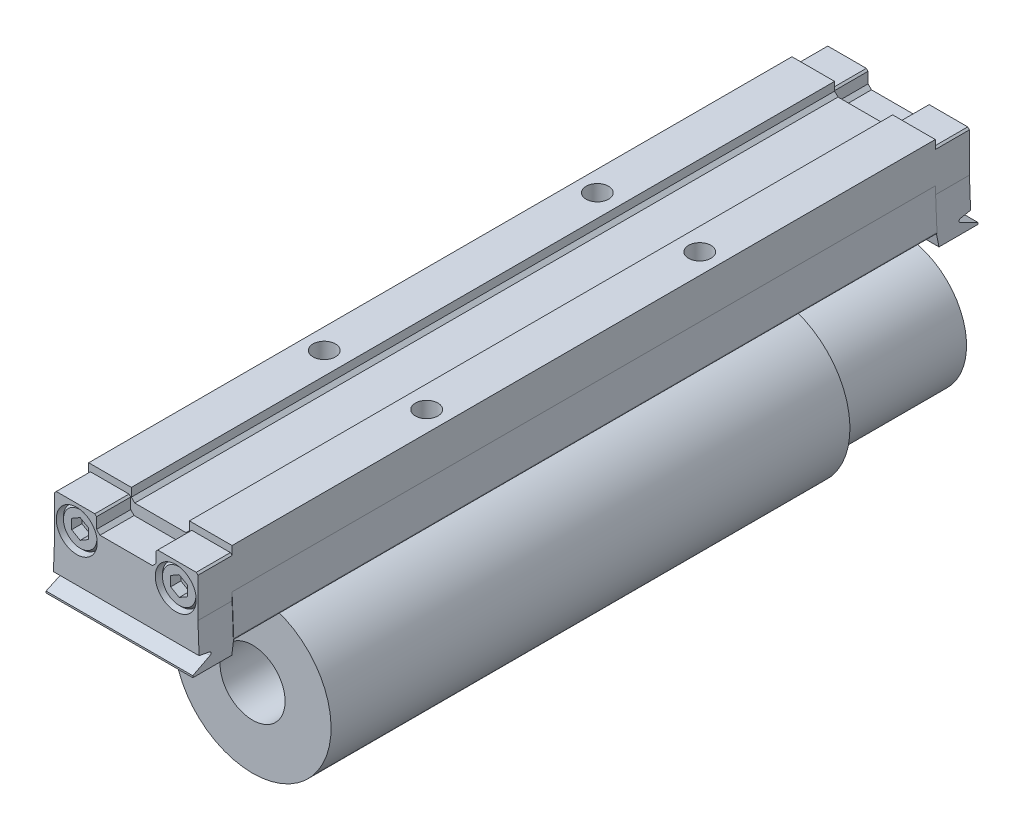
ISO-10303-21;
HEADER;
FILE_DESCRIPTION(('STEP AP214'),'2;1');
FILE_NAME('part.step','',(''),(''),'','','');
FILE_SCHEMA(('AUTOMOTIVE_DESIGN { 1 0 10303 214 1 1 1 1 }'));
ENDSEC;
DATA;
#1=APPLICATION_CONTEXT('core data for automotive mechanical design processes');
#2=APPLICATION_PROTOCOL_DEFINITION('international standard','automotive_design',2000,#1);
#3=PRODUCT_CONTEXT('',#1,'mechanical');
#4=PRODUCT('Part','Part','',(#3));
#5=PRODUCT_RELATED_PRODUCT_CATEGORY('part','',(#4));
#6=PRODUCT_DEFINITION_FORMATION('','',#4);
#7=PRODUCT_DEFINITION_CONTEXT('part definition',#1,'design');
#8=PRODUCT_DEFINITION('design','',#6,#7);
#9=PRODUCT_DEFINITION_SHAPE('','',#8);
#10=(LENGTH_UNIT() NAMED_UNIT(*) SI_UNIT(.MILLI.,.METRE.));
#11=(NAMED_UNIT(*) PLANE_ANGLE_UNIT() SI_UNIT($,.RADIAN.));
#12=(NAMED_UNIT(*) SI_UNIT($,.STERADIAN.) SOLID_ANGLE_UNIT());
#13=UNCERTAINTY_MEASURE_WITH_UNIT(LENGTH_MEASURE(1.E-05),#10,'distance_accuracy_value','');
#14=(GEOMETRIC_REPRESENTATION_CONTEXT(3) GLOBAL_UNCERTAINTY_ASSIGNED_CONTEXT((#13)) GLOBAL_UNIT_ASSIGNED_CONTEXT((#10,
#11,#12)) REPRESENTATION_CONTEXT('',''));
#15=CARTESIAN_POINT('',(0.,0.,0.));
#16=DIRECTION('',(0.,0.,1.));
#17=DIRECTION('',(1.,0.,0.));
#18=AXIS2_PLACEMENT_3D('',#15,#16,#17);
#19=CARTESIAN_POINT('',(-7.25,24.87,-53.));
#20=DIRECTION('',(0.,0.,1.));
#21=DIRECTION('',(0.,-1.,0.));
#22=AXIS2_PLACEMENT_3D('',#19,#20,#21);
#23=CYLINDRICAL_SURFACE('',#22,2.75);
#24=CARTESIAN_POINT('',(-7.25,24.87,-55.7));
#25=DIRECTION('',(0.,0.,1.));
#26=DIRECTION('',(0.,-1.,0.));
#27=AXIS2_PLACEMENT_3D('',#24,#25,#26);
#28=CIRCLE('',#27,2.75);
#29=CARTESIAN_POINT('',(-7.25,22.12,-55.7));
#30=VERTEX_POINT('',#29);
#31=EDGE_CURVE('E1582',#30,#30,#28,.T.);
#32=ORIENTED_EDGE('',*,*,#31,.T.);
#33=EDGE_LOOP('',(#32));
#34=FACE_BOUND('',#33,.T.);
#35=CARTESIAN_POINT('',(-7.25,24.87,-53.));
#36=DIRECTION('',(0.,0.,1.));
#37=DIRECTION('',(0.,-1.,0.));
#38=AXIS2_PLACEMENT_3D('',#35,#36,#37);
#39=CIRCLE('',#38,2.75);
#40=CARTESIAN_POINT('',(-7.25,22.12,-53.));
#41=VERTEX_POINT('',#40);
#42=EDGE_CURVE('E1514',#41,#41,#39,.T.);
#43=ORIENTED_EDGE('',*,*,#42,.F.);
#44=EDGE_LOOP('',(#43));
#45=FACE_BOUND('',#44,.T.);
#46=ADVANCED_FACE('F15',(#34,#45),#23,.T.);
#47=CARTESIAN_POINT('',(-7.25,24.87,-55.7));
#48=DIRECTION('',(0.,0.,1.));
#49=DIRECTION('',(0.,-1.,0.));
#50=AXIS2_PLACEMENT_3D('',#47,#48,#49);
#51=CONICAL_SURFACE('',#50,2.75,0.78539816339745);
#52=CARTESIAN_POINT('',(-7.25,24.87,-56.));
#53=DIRECTION('',(0.,0.,1.));
#54=DIRECTION('',(0.,-1.,0.));
#55=AXIS2_PLACEMENT_3D('',#52,#53,#54);
#56=CIRCLE('',#55,2.45);
#57=CARTESIAN_POINT('',(-7.25,22.42,-56.));
#58=VERTEX_POINT('',#57);
#59=EDGE_CURVE('E1569',#58,#58,#56,.T.);
#60=ORIENTED_EDGE('',*,*,#59,.T.);
#61=EDGE_LOOP('',(#60));
#62=FACE_BOUND('',#61,.T.);
#63=ORIENTED_EDGE('',*,*,#31,.F.);
#64=EDGE_LOOP('',(#63));
#65=FACE_BOUND('',#64,.T.);
#66=ADVANCED_FACE('F2306',(#62,#65),#51,.T.);
#67=CARTESIAN_POINT('',(-4.8,24.87,-56.));
#68=DIRECTION('',(0.,0.,-1.));
#69=DIRECTION('',(0.,1.,0.));
#70=AXIS2_PLACEMENT_3D('',#67,#68,#69);
#71=PLANE('',#70);
#72=DIRECTION('',(0.,1.,0.));
#73=VECTOR('',#72,1.);
#74=CARTESIAN_POINT('',(-8.5,24.1483121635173,-56.));
#75=LINE('',#74,#73);
#76=CARTESIAN_POINT('',(-8.5,24.1483121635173,-56.));
#77=VERTEX_POINT('',#76);
#78=CARTESIAN_POINT('',(-8.5,25.5916878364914,-56.));
#79=VERTEX_POINT('',#78);
#80=EDGE_CURVE('E1530',#77,#79,#75,.T.);
#81=ORIENTED_EDGE('',*,*,#80,.F.);
#82=DIRECTION('',(-0.866025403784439,0.5,0.));
#83=VECTOR('',#82,1.);
#84=CARTESIAN_POINT('',(-7.25,23.4266243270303,-56.));
#85=LINE('',#84,#83);
#86=CARTESIAN_POINT('',(-7.25,23.4266243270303,-56.));
#87=VERTEX_POINT('',#86);
#88=EDGE_CURVE('E1545',#87,#77,#85,.T.);
#89=ORIENTED_EDGE('',*,*,#88,.F.);
#90=DIRECTION('',(-0.866025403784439,-0.5,0.));
#91=VECTOR('',#90,1.);
#92=CARTESIAN_POINT('',(-6.,24.1483121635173,-56.));
#93=LINE('',#92,#91);
#94=CARTESIAN_POINT('',(-6.,24.1483121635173,-56.));
#95=VERTEX_POINT('',#94);
#96=EDGE_CURVE('E1542',#95,#87,#93,.T.);
#97=ORIENTED_EDGE('',*,*,#96,.F.);
#98=DIRECTION('',(0.,-1.,0.));
#99=VECTOR('',#98,1.);
#100=CARTESIAN_POINT('',(-6.,25.5916878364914,-56.));
#101=LINE('',#100,#99);
#102=CARTESIAN_POINT('',(-6.,25.5916878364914,-56.));
#103=VERTEX_POINT('',#102);
#104=EDGE_CURVE('E1539',#103,#95,#101,.T.);
#105=ORIENTED_EDGE('',*,*,#104,.F.);
#106=DIRECTION('',(0.866025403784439,-0.5,0.));
#107=VECTOR('',#106,1.);
#108=CARTESIAN_POINT('',(-7.25,26.3133756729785,-56.));
#109=LINE('',#108,#107);
#110=CARTESIAN_POINT('',(-7.25,26.3133756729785,-56.));
#111=VERTEX_POINT('',#110);
#112=EDGE_CURVE('E1536',#111,#103,#109,.T.);
#113=ORIENTED_EDGE('',*,*,#112,.F.);
#114=DIRECTION('',(0.866025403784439,0.5,0.));
#115=VECTOR('',#114,1.);
#116=CARTESIAN_POINT('',(-8.5,25.5916878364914,-56.));
#117=LINE('',#116,#115);
#118=EDGE_CURVE('E1532',#79,#111,#117,.T.);
#119=ORIENTED_EDGE('',*,*,#118,.F.);
#120=EDGE_LOOP('',(#81,#89,#97,#105,#113,#119));
#121=FACE_BOUND('',#120,.T.);
#122=ORIENTED_EDGE('',*,*,#59,.F.);
#123=EDGE_LOOP('',(#122));
#124=FACE_BOUND('',#123,.T.);
#125=ADVANCED_FACE('F2294',(#121,#124),#71,.T.);
#126=CARTESIAN_POINT('',(-8.5,24.1483121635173,-54.5));
#127=DIRECTION('',(-1.,0.,0.));
#128=DIRECTION('',(0.,1.,0.));
#129=AXIS2_PLACEMENT_3D('',#126,#127,#128);
#130=PLANE('',#129);
#131=ORIENTED_EDGE('',*,*,#80,.T.);
#132=DIRECTION('',(0.,0.,-1.));
#133=VECTOR('',#132,1.);
#134=CARTESIAN_POINT('',(-8.5,25.5916878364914,-54.5));
#135=LINE('',#134,#133);
#136=CARTESIAN_POINT('',(-8.5,25.5916878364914,-54.5));
#137=VERTEX_POINT('',#136);
#138=EDGE_CURVE('E1566',#137,#79,#135,.T.);
#139=ORIENTED_EDGE('',*,*,#138,.F.);
#140=DIRECTION('',(0.,1.,0.));
#141=VECTOR('',#140,1.);
#142=CARTESIAN_POINT('',(-8.5,24.1483121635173,-54.5));
#143=LINE('',#142,#141);
#144=CARTESIAN_POINT('',(-8.5,24.1483121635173,-54.5));
#145=VERTEX_POINT('',#144);
#146=EDGE_CURVE('E1548',#145,#137,#143,.T.);
#147=ORIENTED_EDGE('',*,*,#146,.F.);
#148=DIRECTION('',(0.,0.,-1.));
#149=VECTOR('',#148,1.);
#150=CARTESIAN_POINT('',(-8.5,24.1483121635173,-54.5));
#151=LINE('',#150,#149);
#152=EDGE_CURVE('E1567',#145,#77,#151,.T.);
#153=ORIENTED_EDGE('',*,*,#152,.T.);
#154=EDGE_LOOP('',(#131,#139,#147,#153));
#155=FACE_BOUND('',#154,.T.);
#156=ADVANCED_FACE('F2276',(#155),#130,.F.);
#157=CARTESIAN_POINT('',(-7.25,23.4266243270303,-54.5));
#158=DIRECTION('',(-0.5,-0.866025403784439,0.));
#159=DIRECTION('',(-0.866025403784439,0.5,0.));
#160=AXIS2_PLACEMENT_3D('',#157,#158,#159);
#161=PLANE('',#160);
#162=ORIENTED_EDGE('',*,*,#88,.T.);
#163=ORIENTED_EDGE('',*,*,#152,.F.);
#164=DIRECTION('',(-0.866025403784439,0.5,0.));
#165=VECTOR('',#164,1.);
#166=CARTESIAN_POINT('',(-7.25,23.4266243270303,-54.5));
#167=LINE('',#166,#165);
#168=CARTESIAN_POINT('',(-7.25,23.4266243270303,-54.5));
#169=VERTEX_POINT('',#168);
#170=EDGE_CURVE('E1563',#169,#145,#167,.T.);
#171=ORIENTED_EDGE('',*,*,#170,.F.);
#172=DIRECTION('',(0.,0.,-1.));
#173=VECTOR('',#172,1.);
#174=CARTESIAN_POINT('',(-7.25,23.4266243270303,-54.5));
#175=LINE('',#174,#173);
#176=EDGE_CURVE('E1570',#169,#87,#175,.T.);
#177=ORIENTED_EDGE('',*,*,#176,.T.);
#178=EDGE_LOOP('',(#162,#163,#171,#177));
#179=FACE_BOUND('',#178,.T.);
#180=ADVANCED_FACE('F2272',(#179),#161,.F.);
#181=CARTESIAN_POINT('',(-6.,24.1483121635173,-54.5));
#182=DIRECTION('',(0.5,-0.866025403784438,0.));
#183=DIRECTION('',(-0.866025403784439,-0.5,0.));
#184=AXIS2_PLACEMENT_3D('',#181,#182,#183);
#185=PLANE('',#184);
#186=ORIENTED_EDGE('',*,*,#96,.T.);
#187=ORIENTED_EDGE('',*,*,#176,.F.);
#188=DIRECTION('',(-0.866025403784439,-0.5,0.));
#189=VECTOR('',#188,1.);
#190=CARTESIAN_POINT('',(-6.,24.1483121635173,-54.5));
#191=LINE('',#190,#189);
#192=CARTESIAN_POINT('',(-6.,24.1483121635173,-54.5));
#193=VERTEX_POINT('',#192);
#194=EDGE_CURVE('E1560',#193,#169,#191,.T.);
#195=ORIENTED_EDGE('',*,*,#194,.F.);
#196=DIRECTION('',(0.,0.,-1.));
#197=VECTOR('',#196,1.);
#198=CARTESIAN_POINT('',(-6.,24.1483121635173,-54.5));
#199=LINE('',#198,#197);
#200=EDGE_CURVE('E1572',#193,#95,#199,.T.);
#201=ORIENTED_EDGE('',*,*,#200,.T.);
#202=EDGE_LOOP('',(#186,#187,#195,#201));
#203=FACE_BOUND('',#202,.T.);
#204=ADVANCED_FACE('F2275',(#203),#185,.F.);
#205=CARTESIAN_POINT('',(-6.,25.5916878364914,-54.5));
#206=DIRECTION('',(1.,0.,0.));
#207=DIRECTION('',(0.,-1.,0.));
#208=AXIS2_PLACEMENT_3D('',#205,#206,#207);
#209=PLANE('',#208);
#210=ORIENTED_EDGE('',*,*,#104,.T.);
#211=ORIENTED_EDGE('',*,*,#200,.F.);
#212=DIRECTION('',(0.,-1.,0.));
#213=VECTOR('',#212,1.);
#214=CARTESIAN_POINT('',(-6.,25.5916878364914,-54.5));
#215=LINE('',#214,#213);
#216=CARTESIAN_POINT('',(-6.,25.5916878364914,-54.5));
#217=VERTEX_POINT('',#216);
#218=EDGE_CURVE('E1557',#217,#193,#215,.T.);
#219=ORIENTED_EDGE('',*,*,#218,.F.);
#220=DIRECTION('',(0.,0.,-1.));
#221=VECTOR('',#220,1.);
#222=CARTESIAN_POINT('',(-6.,25.5916878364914,-54.5));
#223=LINE('',#222,#221);
#224=EDGE_CURVE('E1574',#217,#103,#223,.T.);
#225=ORIENTED_EDGE('',*,*,#224,.T.);
#226=EDGE_LOOP('',(#210,#211,#219,#225));
#227=FACE_BOUND('',#226,.T.);
#228=ADVANCED_FACE('F2280',(#227),#209,.F.);
#229=CARTESIAN_POINT('',(-7.25,26.3133756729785,-54.5));
#230=DIRECTION('',(0.5,0.866025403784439,0.));
#231=DIRECTION('',(0.866025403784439,-0.5,0.));
#232=AXIS2_PLACEMENT_3D('',#229,#230,#231);
#233=PLANE('',#232);
#234=ORIENTED_EDGE('',*,*,#112,.T.);
#235=ORIENTED_EDGE('',*,*,#224,.F.);
#236=DIRECTION('',(0.866025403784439,-0.5,0.));
#237=VECTOR('',#236,1.);
#238=CARTESIAN_POINT('',(-7.25,26.3133756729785,-54.5));
#239=LINE('',#238,#237);
#240=CARTESIAN_POINT('',(-7.25,26.3133756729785,-54.5));
#241=VERTEX_POINT('',#240);
#242=EDGE_CURVE('E1554',#241,#217,#239,.T.);
#243=ORIENTED_EDGE('',*,*,#242,.F.);
#244=DIRECTION('',(0.,0.,-1.));
#245=VECTOR('',#244,1.);
#246=CARTESIAN_POINT('',(-7.25,26.3133756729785,-54.5));
#247=LINE('',#246,#245);
#248=EDGE_CURVE('E1576',#241,#111,#247,.T.);
#249=ORIENTED_EDGE('',*,*,#248,.T.);
#250=EDGE_LOOP('',(#234,#235,#243,#249));
#251=FACE_BOUND('',#250,.T.);
#252=ADVANCED_FACE('F2284',(#251),#233,.F.);
#253=CARTESIAN_POINT('',(-8.5,25.5916878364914,-54.5));
#254=DIRECTION('',(-0.5,0.866025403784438,0.));
#255=DIRECTION('',(0.866025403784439,0.5,0.));
#256=AXIS2_PLACEMENT_3D('',#253,#254,#255);
#257=PLANE('',#256);
#258=ORIENTED_EDGE('',*,*,#118,.T.);
#259=ORIENTED_EDGE('',*,*,#248,.F.);
#260=DIRECTION('',(0.866025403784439,0.5,0.));
#261=VECTOR('',#260,1.);
#262=CARTESIAN_POINT('',(-8.5,25.5916878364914,-54.5));
#263=LINE('',#262,#261);
#264=EDGE_CURVE('E1551',#137,#241,#263,.T.);
#265=ORIENTED_EDGE('',*,*,#264,.F.);
#266=ORIENTED_EDGE('',*,*,#138,.T.);
#267=EDGE_LOOP('',(#258,#259,#265,#266));
#268=FACE_BOUND('',#267,.T.);
#269=ADVANCED_FACE('F2270',(#268),#257,.F.);
#270=CARTESIAN_POINT('',(-8.5,24.1483121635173,-54.5));
#271=DIRECTION('',(0.,0.,1.));
#272=DIRECTION('',(0.,-1.,0.));
#273=AXIS2_PLACEMENT_3D('',#270,#271,#272);
#274=PLANE('',#273);
#275=ORIENTED_EDGE('',*,*,#146,.T.);
#276=ORIENTED_EDGE('',*,*,#264,.T.);
#277=ORIENTED_EDGE('',*,*,#242,.T.);
#278=ORIENTED_EDGE('',*,*,#218,.T.);
#279=ORIENTED_EDGE('',*,*,#194,.T.);
#280=ORIENTED_EDGE('',*,*,#170,.T.);
#281=EDGE_LOOP('',(#275,#276,#277,#278,#279,#280));
#282=FACE_BOUND('',#281,.T.);
#283=ADVANCED_FACE('F1288',(#282),#274,.F.);
#284=CARTESIAN_POINT('',(7.25,24.87,-53.));
#285=DIRECTION('',(0.,0.,1.));
#286=DIRECTION('',(0.,-1.,0.));
#287=AXIS2_PLACEMENT_3D('',#284,#285,#286);
#288=CYLINDRICAL_SURFACE('',#287,2.75);
#289=CARTESIAN_POINT('',(7.25,24.87,-55.7));
#290=DIRECTION('',(0.,0.,1.));
#291=DIRECTION('',(0.,-1.,0.));
#292=AXIS2_PLACEMENT_3D('',#289,#290,#291);
#293=CIRCLE('',#292,2.75);
#294=CARTESIAN_POINT('',(7.25,22.12,-55.7));
#295=VERTEX_POINT('',#294);
#296=EDGE_CURVE('E1438',#295,#295,#293,.T.);
#297=ORIENTED_EDGE('',*,*,#296,.T.);
#298=EDGE_LOOP('',(#297));
#299=FACE_BOUND('',#298,.T.);
#300=CARTESIAN_POINT('',(7.25,24.87,-53.));
#301=DIRECTION('',(0.,0.,1.));
#302=DIRECTION('',(1.,0.,0.));
#303=AXIS2_PLACEMENT_3D('',#300,#301,#302);
#304=CIRCLE('',#303,2.75);
#305=CARTESIAN_POINT('',(10.,24.87,-53.));
#306=VERTEX_POINT('',#305);
#307=EDGE_CURVE('E1512',#306,#306,#304,.T.);
#308=ORIENTED_EDGE('',*,*,#307,.F.);
#309=EDGE_LOOP('',(#308));
#310=FACE_BOUND('',#309,.T.);
#311=ADVANCED_FACE('F1284',(#299,#310),#288,.T.);
#312=CARTESIAN_POINT('',(7.25,24.87,-55.7));
#313=DIRECTION('',(0.,0.,1.));
#314=DIRECTION('',(0.,-1.,0.));
#315=AXIS2_PLACEMENT_3D('',#312,#313,#314);
#316=CONICAL_SURFACE('',#315,2.75,0.78539816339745);
#317=CARTESIAN_POINT('',(7.25,24.87,-56.));
#318=DIRECTION('',(0.,0.,1.));
#319=DIRECTION('',(0.,-1.,0.));
#320=AXIS2_PLACEMENT_3D('',#317,#318,#319);
#321=CIRCLE('',#320,2.45);
#322=CARTESIAN_POINT('',(7.25,22.42,-56.));
#323=VERTEX_POINT('',#322);
#324=EDGE_CURVE('E1441',#323,#323,#321,.T.);
#325=ORIENTED_EDGE('',*,*,#324,.T.);
#326=EDGE_LOOP('',(#325));
#327=FACE_BOUND('',#326,.T.);
#328=ORIENTED_EDGE('',*,*,#296,.F.);
#329=EDGE_LOOP('',(#328));
#330=FACE_BOUND('',#329,.T.);
#331=ADVANCED_FACE('F1280',(#327,#330),#316,.T.);
#332=CARTESIAN_POINT('',(9.7,24.87,-56.));
#333=DIRECTION('',(0.,0.,-1.));
#334=DIRECTION('',(0.,1.,0.));
#335=AXIS2_PLACEMENT_3D('',#332,#333,#334);
#336=PLANE('',#335);
#337=DIRECTION('',(0.,1.,0.));
#338=VECTOR('',#337,1.);
#339=CARTESIAN_POINT('',(6.,24.1483121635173,-56.));
#340=LINE('',#339,#338);
#341=CARTESIAN_POINT('',(6.,24.1483121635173,-56.));
#342=VERTEX_POINT('',#341);
#343=CARTESIAN_POINT('',(6.,25.5916878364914,-56.));
#344=VERTEX_POINT('',#343);
#345=EDGE_CURVE('E1489',#342,#344,#340,.T.);
#346=ORIENTED_EDGE('',*,*,#345,.F.);
#347=DIRECTION('',(-0.866025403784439,0.5,0.));
#348=VECTOR('',#347,1.);
#349=CARTESIAN_POINT('',(7.25,23.4266243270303,-56.));
#350=LINE('',#349,#348);
#351=CARTESIAN_POINT('',(7.25,23.4266243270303,-56.));
#352=VERTEX_POINT('',#351);
#353=EDGE_CURVE('E1475',#352,#342,#350,.T.);
#354=ORIENTED_EDGE('',*,*,#353,.F.);
#355=DIRECTION('',(-0.866025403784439,-0.5,0.));
#356=VECTOR('',#355,1.);
#357=CARTESIAN_POINT('',(8.5,24.1483121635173,-56.));
#358=LINE('',#357,#356);
#359=CARTESIAN_POINT('',(8.5,24.1483121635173,-56.));
#360=VERTEX_POINT('',#359);
#361=EDGE_CURVE('E1478',#360,#352,#358,.T.);
#362=ORIENTED_EDGE('',*,*,#361,.F.);
#363=DIRECTION('',(0.,-1.,0.));
#364=VECTOR('',#363,1.);
#365=CARTESIAN_POINT('',(8.5,25.5916878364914,-56.));
#366=LINE('',#365,#364);
#367=CARTESIAN_POINT('',(8.5,25.5916878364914,-56.));
#368=VERTEX_POINT('',#367);
#369=EDGE_CURVE('E1481',#368,#360,#366,.T.);
#370=ORIENTED_EDGE('',*,*,#369,.F.);
#371=DIRECTION('',(0.866025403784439,-0.5,0.));
#372=VECTOR('',#371,1.);
#373=CARTESIAN_POINT('',(7.25,26.3133756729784,-56.));
#374=LINE('',#373,#372);
#375=CARTESIAN_POINT('',(7.25,26.3133756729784,-56.));
#376=VERTEX_POINT('',#375);
#377=EDGE_CURVE('E1484',#376,#368,#374,.T.);
#378=ORIENTED_EDGE('',*,*,#377,.F.);
#379=DIRECTION('',(0.866025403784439,0.5,0.));
#380=VECTOR('',#379,1.);
#381=CARTESIAN_POINT('',(6.,25.5916878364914,-56.));
#382=LINE('',#381,#380);
#383=EDGE_CURVE('E1487',#344,#376,#382,.T.);
#384=ORIENTED_EDGE('',*,*,#383,.F.);
#385=EDGE_LOOP('',(#346,#354,#362,#370,#378,#384));
#386=FACE_BOUND('',#385,.T.);
#387=ORIENTED_EDGE('',*,*,#324,.F.);
#388=EDGE_LOOP('',(#387));
#389=FACE_BOUND('',#388,.T.);
#390=ADVANCED_FACE('F1268',(#386,#389),#336,.T.);
#391=CARTESIAN_POINT('',(6.,24.1483121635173,-54.5));
#392=DIRECTION('',(-1.,0.,0.));
#393=DIRECTION('',(0.,1.,0.));
#394=AXIS2_PLACEMENT_3D('',#391,#392,#393);
#395=PLANE('',#394);
#396=ORIENTED_EDGE('',*,*,#345,.T.);
#397=DIRECTION('',(0.,0.,-1.));
#398=VECTOR('',#397,1.);
#399=CARTESIAN_POINT('',(6.,25.5916878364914,-54.5));
#400=LINE('',#399,#398);
#401=CARTESIAN_POINT('',(6.,25.5916878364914,-54.5));
#402=VERTEX_POINT('',#401);
#403=EDGE_CURVE('E1445',#402,#344,#400,.T.);
#404=ORIENTED_EDGE('',*,*,#403,.F.);
#405=DIRECTION('',(0.,1.,0.));
#406=VECTOR('',#405,1.);
#407=CARTESIAN_POINT('',(6.,24.1483121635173,-54.5));
#408=LINE('',#407,#406);
#409=CARTESIAN_POINT('',(6.,24.1483121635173,-54.5));
#410=VERTEX_POINT('',#409);
#411=EDGE_CURVE('E1472',#410,#402,#408,.T.);
#412=ORIENTED_EDGE('',*,*,#411,.F.);
#413=DIRECTION('',(0.,0.,-1.));
#414=VECTOR('',#413,1.);
#415=CARTESIAN_POINT('',(6.,24.1483121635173,-54.5));
#416=LINE('',#415,#414);
#417=EDGE_CURVE('E1444',#410,#342,#416,.T.);
#418=ORIENTED_EDGE('',*,*,#417,.T.);
#419=EDGE_LOOP('',(#396,#404,#412,#418));
#420=FACE_BOUND('',#419,.T.);
#421=ADVANCED_FACE('F1250',(#420),#395,.F.);
#422=CARTESIAN_POINT('',(7.25,23.4266243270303,-54.5));
#423=DIRECTION('',(-0.5,-0.866025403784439,0.));
#424=DIRECTION('',(-0.866025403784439,0.5,0.));
#425=AXIS2_PLACEMENT_3D('',#422,#423,#424);
#426=PLANE('',#425);
#427=ORIENTED_EDGE('',*,*,#353,.T.);
#428=ORIENTED_EDGE('',*,*,#417,.F.);
#429=DIRECTION('',(-0.866025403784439,0.5,0.));
#430=VECTOR('',#429,1.);
#431=CARTESIAN_POINT('',(7.25,23.4266243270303,-54.5));
#432=LINE('',#431,#430);
#433=CARTESIAN_POINT('',(7.25,23.4266243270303,-54.5));
#434=VERTEX_POINT('',#433);
#435=EDGE_CURVE('E1449',#434,#410,#432,.T.);
#436=ORIENTED_EDGE('',*,*,#435,.F.);
#437=DIRECTION('',(0.,0.,-1.));
#438=VECTOR('',#437,1.);
#439=CARTESIAN_POINT('',(7.25,23.4266243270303,-54.5));
#440=LINE('',#439,#438);
#441=EDGE_CURVE('E1455',#434,#352,#440,.T.);
#442=ORIENTED_EDGE('',*,*,#441,.T.);
#443=EDGE_LOOP('',(#427,#428,#436,#442));
#444=FACE_BOUND('',#443,.T.);
#445=ADVANCED_FACE('F1246',(#444),#426,.F.);
#446=CARTESIAN_POINT('',(8.5,24.1483121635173,-54.5));
#447=DIRECTION('',(0.5,-0.866025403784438,0.));
#448=DIRECTION('',(-0.866025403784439,-0.5,0.));
#449=AXIS2_PLACEMENT_3D('',#446,#447,#448);
#450=PLANE('',#449);
#451=ORIENTED_EDGE('',*,*,#361,.T.);
#452=ORIENTED_EDGE('',*,*,#441,.F.);
#453=DIRECTION('',(-0.866025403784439,-0.5,0.));
#454=VECTOR('',#453,1.);
#455=CARTESIAN_POINT('',(8.5,24.1483121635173,-54.5));
#456=LINE('',#455,#454);
#457=CARTESIAN_POINT('',(8.5,24.1483121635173,-54.5));
#458=VERTEX_POINT('',#457);
#459=EDGE_CURVE('E1460',#458,#434,#456,.T.);
#460=ORIENTED_EDGE('',*,*,#459,.F.);
#461=DIRECTION('',(0.,0.,-1.));
#462=VECTOR('',#461,1.);
#463=CARTESIAN_POINT('',(8.5,24.1483121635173,-54.5));
#464=LINE('',#463,#462);
#465=EDGE_CURVE('E1453',#458,#360,#464,.T.);
#466=ORIENTED_EDGE('',*,*,#465,.T.);
#467=EDGE_LOOP('',(#451,#452,#460,#466));
#468=FACE_BOUND('',#467,.T.);
#469=ADVANCED_FACE('F1249',(#468),#450,.F.);
#470=CARTESIAN_POINT('',(8.5,25.5916878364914,-54.5));
#471=DIRECTION('',(1.,0.,0.));
#472=DIRECTION('',(0.,-1.,0.));
#473=AXIS2_PLACEMENT_3D('',#470,#471,#472);
#474=PLANE('',#473);
#475=ORIENTED_EDGE('',*,*,#369,.T.);
#476=ORIENTED_EDGE('',*,*,#465,.F.);
#477=DIRECTION('',(0.,-1.,0.));
#478=VECTOR('',#477,1.);
#479=CARTESIAN_POINT('',(8.5,25.5916878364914,-54.5));
#480=LINE('',#479,#478);
#481=CARTESIAN_POINT('',(8.5,25.5916878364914,-54.5));
#482=VERTEX_POINT('',#481);
#483=EDGE_CURVE('E1463',#482,#458,#480,.T.);
#484=ORIENTED_EDGE('',*,*,#483,.F.);
#485=DIRECTION('',(0.,0.,-1.));
#486=VECTOR('',#485,1.);
#487=CARTESIAN_POINT('',(8.5,25.5916878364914,-54.5));
#488=LINE('',#487,#486);
#489=EDGE_CURVE('E1451',#482,#368,#488,.T.);
#490=ORIENTED_EDGE('',*,*,#489,.T.);
#491=EDGE_LOOP('',(#475,#476,#484,#490));
#492=FACE_BOUND('',#491,.T.);
#493=ADVANCED_FACE('F1254',(#492),#474,.F.);
#494=CARTESIAN_POINT('',(7.25,26.3133756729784,-54.5));
#495=DIRECTION('',(0.5,0.866025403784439,0.));
#496=DIRECTION('',(0.866025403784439,-0.5,0.));
#497=AXIS2_PLACEMENT_3D('',#494,#495,#496);
#498=PLANE('',#497);
#499=ORIENTED_EDGE('',*,*,#377,.T.);
#500=ORIENTED_EDGE('',*,*,#489,.F.);
#501=DIRECTION('',(0.866025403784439,-0.5,0.));
#502=VECTOR('',#501,1.);
#503=CARTESIAN_POINT('',(7.25,26.3133756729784,-54.5));
#504=LINE('',#503,#502);
#505=CARTESIAN_POINT('',(7.25,26.3133756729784,-54.5));
#506=VERTEX_POINT('',#505);
#507=EDGE_CURVE('E1466',#506,#482,#504,.T.);
#508=ORIENTED_EDGE('',*,*,#507,.F.);
#509=DIRECTION('',(0.,0.,-1.));
#510=VECTOR('',#509,1.);
#511=CARTESIAN_POINT('',(7.25,26.3133756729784,-54.5));
#512=LINE('',#511,#510);
#513=EDGE_CURVE('E1448',#506,#376,#512,.T.);
#514=ORIENTED_EDGE('',*,*,#513,.T.);
#515=EDGE_LOOP('',(#499,#500,#508,#514));
#516=FACE_BOUND('',#515,.T.);
#517=ADVANCED_FACE('F1258',(#516),#498,.F.);
#518=CARTESIAN_POINT('',(6.,25.5916878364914,-54.5));
#519=DIRECTION('',(-0.5,0.866025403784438,0.));
#520=DIRECTION('',(0.866025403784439,0.5,0.));
#521=AXIS2_PLACEMENT_3D('',#518,#519,#520);
#522=PLANE('',#521);
#523=ORIENTED_EDGE('',*,*,#383,.T.);
#524=ORIENTED_EDGE('',*,*,#513,.F.);
#525=DIRECTION('',(0.866025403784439,0.5,0.));
#526=VECTOR('',#525,1.);
#527=CARTESIAN_POINT('',(6.,25.5916878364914,-54.5));
#528=LINE('',#527,#526);
#529=EDGE_CURVE('E1469',#402,#506,#528,.T.);
#530=ORIENTED_EDGE('',*,*,#529,.F.);
#531=ORIENTED_EDGE('',*,*,#403,.T.);
#532=EDGE_LOOP('',(#523,#524,#530,#531));
#533=FACE_BOUND('',#532,.T.);
#534=ADVANCED_FACE('F1244',(#533),#522,.F.);
#535=CARTESIAN_POINT('',(6.,24.1483121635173,-54.5));
#536=DIRECTION('',(0.,0.,1.));
#537=DIRECTION('',(0.,-1.,0.));
#538=AXIS2_PLACEMENT_3D('',#535,#536,#537);
#539=PLANE('',#538);
#540=ORIENTED_EDGE('',*,*,#411,.T.);
#541=ORIENTED_EDGE('',*,*,#529,.T.);
#542=ORIENTED_EDGE('',*,*,#507,.T.);
#543=ORIENTED_EDGE('',*,*,#483,.T.);
#544=ORIENTED_EDGE('',*,*,#459,.T.);
#545=ORIENTED_EDGE('',*,*,#435,.T.);
#546=EDGE_LOOP('',(#540,#541,#542,#543,#544,#545));
#547=FACE_BOUND('',#546,.T.);
#548=ADVANCED_FACE('F1023',(#547),#539,.F.);
#549=CARTESIAN_POINT('',(0.,0.,-51.5));
#550=DIRECTION('',(0.,0.,1.));
#551=DIRECTION('',(1.,0.,0.));
#552=AXIS2_PLACEMENT_3D('',#549,#550,#551);
#553=PLANE('',#552);
#554=DIRECTION('',(-1.,0.,0.));
#555=VECTOR('',#554,1.);
#556=CARTESIAN_POINT('',(8.,17.,-51.5));
#557=LINE('',#556,#555);
#558=CARTESIAN_POINT('',(8.,17.,-51.5));
#559=VERTEX_POINT('',#558);
#560=CARTESIAN_POINT('',(5.25,17.,-51.5));
#561=VERTEX_POINT('',#560);
#562=EDGE_CURVE('E537',#559,#561,#557,.T.);
#563=ORIENTED_EDGE('',*,*,#562,.T.);
#564=DIRECTION('',(0.,1.,0.));
#565=VECTOR('',#564,1.);
#566=CARTESIAN_POINT('',(5.25,24.5,-51.5));
#567=LINE('',#566,#565);
#568=CARTESIAN_POINT('',(5.25,17.37,-51.5));
#569=VERTEX_POINT('',#568);
#570=EDGE_CURVE('E2015',#561,#569,#567,.T.);
#571=ORIENTED_EDGE('',*,*,#570,.T.);
#572=DIRECTION('',(-1.,0.,0.));
#573=VECTOR('',#572,1.);
#574=CARTESIAN_POINT('',(11.,17.37,-51.5));
#575=LINE('',#574,#573);
#576=CARTESIAN_POINT('',(10.0058661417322,17.37,-51.5));
#577=VERTEX_POINT('',#576);
#578=EDGE_CURVE('E1810',#577,#569,#575,.T.);
#579=ORIENTED_EDGE('',*,*,#578,.F.);
#580=DIRECTION('',(-0.983409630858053,-0.181398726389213,0.));
#581=VECTOR('',#580,1.);
#582=CARTESIAN_POINT('',(10.754,17.508,-51.5));
#583=LINE('',#582,#581);
#584=EDGE_CURVE('E540',#577,#559,#583,.T.);
#585=ORIENTED_EDGE('',*,*,#584,.T.);
#586=EDGE_LOOP('',(#563,#571,#579,#585));
#587=FACE_BOUND('',#586,.T.);
#588=ADVANCED_FACE('F1243',(#587),#553,.F.);
#589=DIRECTION('',(1.,0.,0.));
#590=VECTOR('',#589,1.);
#591=CARTESIAN_POINT('',(-11.,17.37,-51.5));
#592=LINE('',#591,#590);
#593=CARTESIAN_POINT('',(-10.0058661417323,17.37,-51.5));
#594=VERTEX_POINT('',#593);
#595=CARTESIAN_POINT('',(-5.25,17.37,-51.5));
#596=VERTEX_POINT('',#595);
#597=EDGE_CURVE('E1814',#594,#596,#592,.T.);
#598=ORIENTED_EDGE('',*,*,#597,.T.);
#599=DIRECTION('',(0.,-1.,0.));
#600=VECTOR('',#599,1.);
#601=CARTESIAN_POINT('',(-5.25,24.5,-51.5));
#602=LINE('',#601,#600);
#603=CARTESIAN_POINT('',(-5.25,17.,-51.5));
#604=VERTEX_POINT('',#603);
#605=EDGE_CURVE('E2027',#596,#604,#602,.T.);
#606=ORIENTED_EDGE('',*,*,#605,.T.);
#607=CARTESIAN_POINT('',(-8.,17.,-51.5));
#608=VERTEX_POINT('',#607);
#609=EDGE_CURVE('E541',#604,#608,#557,.T.);
#610=ORIENTED_EDGE('',*,*,#609,.T.);
#611=DIRECTION('',(-0.983409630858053,0.181398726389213,0.));
#612=VECTOR('',#611,1.);
#613=CARTESIAN_POINT('',(-10.754,17.508,-51.5));
#614=LINE('',#613,#612);
#615=EDGE_CURVE('E554',#608,#594,#614,.T.);
#616=ORIENTED_EDGE('',*,*,#615,.T.);
#617=EDGE_LOOP('',(#598,#606,#610,#616));
#618=FACE_BOUND('',#617,.T.);
#619=ADVANCED_FACE('F1372',(#618),#553,.F.);
#620=CARTESIAN_POINT('',(-1.5,17.,-80.1322207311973));
#621=DIRECTION('',(0.,-1.,0.));
#622=DIRECTION('',(0.,0.,-1.));
#623=AXIS2_PLACEMENT_3D('',#620,#621,#622);
#624=PLANE('',#623);
#625=DIRECTION('',(0.,0.,1.));
#626=VECTOR('',#625,1.);
#627=CARTESIAN_POINT('',(-3.,17.,51.5));
#628=LINE('',#627,#626);
#629=CARTESIAN_POINT('',(-3.,17.,-38.));
#630=VERTEX_POINT('',#629);
#631=CARTESIAN_POINT('',(-3.,17.,38.));
#632=VERTEX_POINT('',#631);
#633=EDGE_CURVE('E839',#630,#632,#628,.T.);
#634=ORIENTED_EDGE('',*,*,#633,.T.);
#635=DIRECTION('',(-1.,0.,0.));
#636=VECTOR('',#635,1.);
#637=CARTESIAN_POINT('',(-3.,17.,38.));
#638=LINE('',#637,#636);
#639=CARTESIAN_POINT('',(3.,17.,38.));
#640=VERTEX_POINT('',#639);
#641=EDGE_CURVE('E890',#640,#632,#638,.T.);
#642=ORIENTED_EDGE('',*,*,#641,.F.);
#643=DIRECTION('',(0.,0.,1.));
#644=VECTOR('',#643,1.);
#645=CARTESIAN_POINT('',(3.,17.,-51.5));
#646=LINE('',#645,#644);
#647=CARTESIAN_POINT('',(3.,17.,-38.));
#648=VERTEX_POINT('',#647);
#649=EDGE_CURVE('E833',#640,#648,#646,.F.);
#650=ORIENTED_EDGE('',*,*,#649,.T.);
#651=DIRECTION('',(-1.,0.,0.));
#652=VECTOR('',#651,1.);
#653=CARTESIAN_POINT('',(-3.,17.,-38.));
#654=LINE('',#653,#652);
#655=EDGE_CURVE('E918',#648,#630,#654,.T.);
#656=ORIENTED_EDGE('',*,*,#655,.T.);
#657=EDGE_LOOP('',(#634,#642,#650,#656));
#658=FACE_BOUND('',#657,.T.);
#659=DIRECTION('',(0.,0.,1.));
#660=VECTOR('',#659,1.);
#661=CARTESIAN_POINT('',(8.,17.,-80.1322207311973));
#662=LINE('',#661,#660);
#663=CARTESIAN_POINT('',(8.,17.,51.5));
#664=VERTEX_POINT('',#663);
#665=EDGE_CURVE('E583',#559,#664,#662,.T.);
#666=ORIENTED_EDGE('',*,*,#665,.T.);
#667=DIRECTION('',(1.,0.,0.));
#668=VECTOR('',#667,1.);
#669=CARTESIAN_POINT('',(-1.5,17.,51.5));
#670=LINE('',#669,#668);
#671=CARTESIAN_POINT('',(5.25,17.,51.5));
#672=VERTEX_POINT('',#671);
#673=EDGE_CURVE('E557',#672,#664,#670,.T.);
#674=ORIENTED_EDGE('',*,*,#673,.F.);
#675=CARTESIAN_POINT('',(-5.25,17.,51.5));
#676=VERTEX_POINT('',#675);
#677=EDGE_CURVE('E564',#676,#672,#670,.T.);
#678=ORIENTED_EDGE('',*,*,#677,.F.);
#679=CARTESIAN_POINT('',(-8.,17.,51.5));
#680=VERTEX_POINT('',#679);
#681=EDGE_CURVE('E560',#680,#676,#670,.T.);
#682=ORIENTED_EDGE('',*,*,#681,.F.);
#683=DIRECTION('',(0.,0.,1.));
#684=VECTOR('',#683,1.);
#685=CARTESIAN_POINT('',(-8.,17.,-80.1322207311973));
#686=LINE('',#685,#684);
#687=EDGE_CURVE('E817',#608,#680,#686,.T.);
#688=ORIENTED_EDGE('',*,*,#687,.F.);
#689=ORIENTED_EDGE('',*,*,#609,.F.);
#690=DIRECTION('',(-1.,0.,0.));
#691=VECTOR('',#690,1.);
#692=CARTESIAN_POINT('',(-11.,17.,-51.5));
#693=LINE('',#692,#691);
#694=EDGE_CURVE('E1518',#561,#604,#693,.T.);
#695=ORIENTED_EDGE('',*,*,#694,.F.);
#696=ORIENTED_EDGE('',*,*,#562,.F.);
#697=EDGE_LOOP('',(#666,#674,#678,#682,#688,#689,#695,#696));
#698=FACE_BOUND('',#697,.T.);
#699=ADVANCED_FACE('F1361',(#658,#698),#624,.T.);
#700=CARTESIAN_POINT('',(-10.754,17.508,-80.1322207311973));
#701=DIRECTION('',(-0.181398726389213,-0.983409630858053,0.));
#702=DIRECTION('',(0.983409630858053,-0.181398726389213,0.));
#703=AXIS2_PLACEMENT_3D('',#700,#701,#702);
#704=PLANE('',#703);
#705=ORIENTED_EDGE('',*,*,#687,.T.);
#706=DIRECTION('',(0.983409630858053,-0.181398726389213,0.));
#707=VECTOR('',#706,1.);
#708=CARTESIAN_POINT('',(-10.754,17.508,51.5));
#709=LINE('',#708,#707);
#710=CARTESIAN_POINT('',(-10.0058661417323,17.37,51.5));
#711=VERTEX_POINT('',#710);
#712=EDGE_CURVE('E555',#711,#680,#709,.T.);
#713=ORIENTED_EDGE('',*,*,#712,.F.);
#714=CARTESIAN_POINT('',(-10.5403860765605,17.4685969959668,51.5));
#715=VERTEX_POINT('',#714);
#716=EDGE_CURVE('E559',#715,#711,#709,.T.);
#717=ORIENTED_EDGE('',*,*,#716,.F.);
#718=DIRECTION('',(0.,0.,1.));
#719=VECTOR('',#718,1.);
#720=CARTESIAN_POINT('',(-10.5403860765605,17.4685969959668,-51.5));
#721=LINE('',#720,#719);
#722=CARTESIAN_POINT('',(-10.5403860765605,17.4685969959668,-51.5));
#723=VERTEX_POINT('',#722);
#724=EDGE_CURVE('E529',#723,#715,#721,.T.);
#725=ORIENTED_EDGE('',*,*,#724,.F.);
#726=DIRECTION('',(-0.983409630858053,0.181398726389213,0.));
#727=VECTOR('',#726,1.);
#728=CARTESIAN_POINT('',(-10.8281439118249,17.521676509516,-51.5));
#729=LINE('',#728,#727);
#730=EDGE_CURVE('E26',#594,#723,#729,.T.);
#731=ORIENTED_EDGE('',*,*,#730,.F.);
#732=ORIENTED_EDGE('',*,*,#615,.F.);
#733=EDGE_LOOP('',(#705,#713,#717,#725,#731,#732));
#734=FACE_BOUND('',#733,.T.);
#735=ADVANCED_FACE('F1359',(#734),#704,.T.);
#736=CARTESIAN_POINT('',(10.754,17.508,-80.1322207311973));
#737=DIRECTION('',(0.181398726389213,-0.983409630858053,0.));
#738=DIRECTION('',(0.983409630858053,0.181398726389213,0.));
#739=AXIS2_PLACEMENT_3D('',#736,#737,#738);
#740=PLANE('',#739);
#741=ORIENTED_EDGE('',*,*,#665,.F.);
#742=ORIENTED_EDGE('',*,*,#584,.F.);
#743=DIRECTION('',(-0.983409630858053,-0.181398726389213,0.));
#744=VECTOR('',#743,1.);
#745=CARTESIAN_POINT('',(-10.4479351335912,13.5971129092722,-51.5));
#746=LINE('',#745,#744);
#747=CARTESIAN_POINT('',(10.5403860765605,17.4685969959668,-51.5));
#748=VERTEX_POINT('',#747);
#749=EDGE_CURVE('E952',#748,#577,#746,.T.);
#750=ORIENTED_EDGE('',*,*,#749,.F.);
#751=DIRECTION('',(0.,0.,1.));
#752=VECTOR('',#751,1.);
#753=CARTESIAN_POINT('',(10.5403860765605,17.4685969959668,-51.5));
#754=LINE('',#753,#752);
#755=CARTESIAN_POINT('',(10.5403860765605,17.4685969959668,51.5));
#756=VERTEX_POINT('',#755);
#757=EDGE_CURVE('E955',#748,#756,#754,.T.);
#758=ORIENTED_EDGE('',*,*,#757,.T.);
#759=DIRECTION('',(0.983409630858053,0.181398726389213,0.));
#760=VECTOR('',#759,1.);
#761=CARTESIAN_POINT('',(10.754,17.508,51.5));
#762=LINE('',#761,#760);
#763=CARTESIAN_POINT('',(10.0058661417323,17.37,51.5));
#764=VERTEX_POINT('',#763);
#765=EDGE_CURVE('E568',#764,#756,#762,.T.);
#766=ORIENTED_EDGE('',*,*,#765,.F.);
#767=EDGE_CURVE('E563',#664,#764,#762,.T.);
#768=ORIENTED_EDGE('',*,*,#767,.F.);
#769=EDGE_LOOP('',(#741,#742,#750,#758,#766,#768));
#770=FACE_BOUND('',#769,.T.);
#771=ADVANCED_FACE('F1356',(#770),#740,.T.);
#772=CARTESIAN_POINT('',(-3.,15.5,-80.1322207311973));
#773=DIRECTION('',(0.,0.,-1.));
#774=DIRECTION('',(-1.,0.,0.));
#775=AXIS2_PLACEMENT_3D('',#772,#773,#774);
#776=CYLINDRICAL_SURFACE('',#775,1.5);
#777=ORIENTED_EDGE('',*,*,#633,.F.);
#778=CARTESIAN_POINT('',(-3.,15.5,-38.));
#779=DIRECTION('',(0.,0.,-1.));
#780=DIRECTION('',(-1.,0.,0.));
#781=AXIS2_PLACEMENT_3D('',#778,#779,#780);
#782=CIRCLE('',#781,1.5);
#783=CARTESIAN_POINT('',(-1.5,15.5,-38.));
#784=VERTEX_POINT('',#783);
#785=EDGE_CURVE('E915',#630,#784,#782,.T.);
#786=ORIENTED_EDGE('',*,*,#785,.T.);
#787=DIRECTION('',(0.,0.,1.));
#788=VECTOR('',#787,1.);
#789=CARTESIAN_POINT('',(-1.5,15.5,-51.5));
#790=LINE('',#789,#788);
#791=CARTESIAN_POINT('',(-1.5,15.5,38.));
#792=VERTEX_POINT('',#791);
#793=EDGE_CURVE('E835',#792,#784,#790,.F.);
#794=ORIENTED_EDGE('',*,*,#793,.F.);
#795=CARTESIAN_POINT('',(-3.,15.5,38.));
#796=DIRECTION('',(0.,0.,-1.));
#797=DIRECTION('',(1.,0.,0.));
#798=AXIS2_PLACEMENT_3D('',#795,#796,#797);
#799=CIRCLE('',#798,1.5);
#800=EDGE_CURVE('E887',#632,#792,#799,.T.);
#801=ORIENTED_EDGE('',*,*,#800,.F.);
#802=EDGE_LOOP('',(#777,#786,#794,#801));
#803=FACE_BOUND('',#802,.T.);
#804=ADVANCED_FACE('F1343',(#803),#776,.F.);
#805=CARTESIAN_POINT('',(0.,0.,38.));
#806=DIRECTION('',(0.,0.,1.));
#807=DIRECTION('',(1.,0.,0.));
#808=AXIS2_PLACEMENT_3D('',#805,#806,#807);
#809=PLANE('',#808);
#810=CARTESIAN_POINT('',(-3.,12.5,38.));
#811=DIRECTION('',(0.,0.,-1.));
#812=DIRECTION('',(1.,0.,0.));
#813=AXIS2_PLACEMENT_3D('',#810,#811,#812);
#814=CIRCLE('',#813,1.5);
#815=CARTESIAN_POINT('',(-1.5,12.5,38.));
#816=VERTEX_POINT('',#815);
#817=CARTESIAN_POINT('',(-2.08840808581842,11.3087820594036,38.));
#818=VERTEX_POINT('',#817);
#819=EDGE_CURVE('E902',#816,#818,#814,.T.);
#820=ORIENTED_EDGE('',*,*,#819,.T.);
#821=CARTESIAN_POINT('',(0.,0.,38.));
#822=DIRECTION('',(0.,0.,1.));
#823=DIRECTION('',(1.,0.,0.));
#824=AXIS2_PLACEMENT_3D('',#821,#822,#823);
#825=CIRCLE('',#824,11.5);
#826=CARTESIAN_POINT('',(2.08840808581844,11.3087820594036,38.));
#827=VERTEX_POINT('',#826);
#828=EDGE_CURVE('E945',#818,#827,#825,.T.);
#829=ORIENTED_EDGE('',*,*,#828,.T.);
#830=CARTESIAN_POINT('',(3.,12.5,38.));
#831=DIRECTION('',(0.,0.,-1.));
#832=DIRECTION('',(1.,0.,0.));
#833=AXIS2_PLACEMENT_3D('',#830,#831,#832);
#834=CIRCLE('',#833,1.5);
#835=CARTESIAN_POINT('',(1.5,12.5,38.));
#836=VERTEX_POINT('',#835);
#837=EDGE_CURVE('E899',#827,#836,#834,.T.);
#838=ORIENTED_EDGE('',*,*,#837,.T.);
#839=DIRECTION('',(0.,1.,0.));
#840=VECTOR('',#839,1.);
#841=CARTESIAN_POINT('',(1.5,15.5,38.));
#842=LINE('',#841,#840);
#843=CARTESIAN_POINT('',(1.5,15.5,38.));
#844=VERTEX_POINT('',#843);
#845=EDGE_CURVE('E896',#836,#844,#842,.T.);
#846=ORIENTED_EDGE('',*,*,#845,.T.);
#847=CARTESIAN_POINT('',(3.,15.5,38.));
#848=DIRECTION('',(0.,0.,-1.));
#849=DIRECTION('',(1.,0.,0.));
#850=AXIS2_PLACEMENT_3D('',#847,#848,#849);
#851=CIRCLE('',#850,1.5);
#852=EDGE_CURVE('E893',#844,#640,#851,.T.);
#853=ORIENTED_EDGE('',*,*,#852,.T.);
#854=ORIENTED_EDGE('',*,*,#641,.T.);
#855=ORIENTED_EDGE('',*,*,#800,.T.);
#856=DIRECTION('',(0.,-1.,0.));
#857=VECTOR('',#856,1.);
#858=CARTESIAN_POINT('',(-1.5,12.5,38.));
#859=LINE('',#858,#857);
#860=EDGE_CURVE('E883',#792,#816,#859,.T.);
#861=ORIENTED_EDGE('',*,*,#860,.T.);
#862=EDGE_LOOP('',(#820,#829,#838,#846,#853,#854,#855,#861));
#863=FACE_BOUND('',#862,.T.);
#864=CARTESIAN_POINT('',(0.,0.,38.));
#865=DIRECTION('',(0.,0.,1.));
#866=DIRECTION('',(1.,0.,0.));
#867=AXIS2_PLACEMENT_3D('',#864,#865,#866);
#868=CIRCLE('',#867,4.7625);
#869=CARTESIAN_POINT('',(4.7625,0.,38.));
#870=VERTEX_POINT('',#869);
#871=EDGE_CURVE('E905',#870,#870,#868,.T.);
#872=ORIENTED_EDGE('',*,*,#871,.F.);
#873=EDGE_LOOP('',(#872));
#874=FACE_BOUND('',#873,.T.);
#875=ADVANCED_FACE('F1341',(#863,#874),#809,.T.);
#876=CARTESIAN_POINT('',(3.,15.5,-80.1322207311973));
#877=DIRECTION('',(0.,0.,-1.));
#878=DIRECTION('',(-1.,0.,0.));
#879=AXIS2_PLACEMENT_3D('',#876,#877,#878);
#880=CYLINDRICAL_SURFACE('',#879,1.5);
#881=DIRECTION('',(0.,0.,1.));
#882=VECTOR('',#881,1.);
#883=CARTESIAN_POINT('',(1.5,15.5,51.5));
#884=LINE('',#883,#882);
#885=CARTESIAN_POINT('',(1.5,15.5,-38.));
#886=VERTEX_POINT('',#885);
#887=EDGE_CURVE('E829',#886,#844,#884,.T.);
#888=ORIENTED_EDGE('',*,*,#887,.F.);
#889=CARTESIAN_POINT('',(3.,15.5,-38.));
#890=DIRECTION('',(0.,0.,-1.));
#891=DIRECTION('',(-1.,0.,0.));
#892=AXIS2_PLACEMENT_3D('',#889,#890,#891);
#893=CIRCLE('',#892,1.5);
#894=EDGE_CURVE('E921',#886,#648,#893,.T.);
#895=ORIENTED_EDGE('',*,*,#894,.T.);
#896=ORIENTED_EDGE('',*,*,#649,.F.);
#897=ORIENTED_EDGE('',*,*,#852,.F.);
#898=EDGE_LOOP('',(#888,#895,#896,#897));
#899=FACE_BOUND('',#898,.T.);
#900=ADVANCED_FACE('F1339',(#899),#880,.F.);
#901=CARTESIAN_POINT('',(0.,0.,-38.));
#902=DIRECTION('',(0.,0.,-1.));
#903=DIRECTION('',(1.,0.,0.));
#904=AXIS2_PLACEMENT_3D('',#901,#902,#903);
#905=PLANE('',#904);
#906=CARTESIAN_POINT('',(0.,0.,-38.));
#907=DIRECTION('',(0.,0.,1.));
#908=DIRECTION('',(1.,0.,0.));
#909=AXIS2_PLACEMENT_3D('',#906,#907,#908);
#910=CIRCLE('',#909,11.5);
#911=CARTESIAN_POINT('',(-2.08840808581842,11.3087820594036,-38.));
#912=VERTEX_POINT('',#911);
#913=CARTESIAN_POINT('',(2.08840808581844,11.3087820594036,-38.));
#914=VERTEX_POINT('',#913);
#915=EDGE_CURVE('E943',#912,#914,#910,.T.);
#916=ORIENTED_EDGE('',*,*,#915,.F.);
#917=CARTESIAN_POINT('',(-3.,12.5,-38.));
#918=DIRECTION('',(0.,0.,-1.));
#919=DIRECTION('',(-1.,0.,0.));
#920=AXIS2_PLACEMENT_3D('',#917,#918,#919);
#921=CIRCLE('',#920,1.5);
#922=CARTESIAN_POINT('',(-1.5,12.5,-38.));
#923=VERTEX_POINT('',#922);
#924=EDGE_CURVE('E882',#923,#912,#921,.T.);
#925=ORIENTED_EDGE('',*,*,#924,.F.);
#926=DIRECTION('',(0.,-1.,0.));
#927=VECTOR('',#926,1.);
#928=CARTESIAN_POINT('',(-1.5,12.5,-38.));
#929=LINE('',#928,#927);
#930=EDGE_CURVE('E912',#784,#923,#929,.T.);
#931=ORIENTED_EDGE('',*,*,#930,.F.);
#932=ORIENTED_EDGE('',*,*,#785,.F.);
#933=ORIENTED_EDGE('',*,*,#655,.F.);
#934=ORIENTED_EDGE('',*,*,#894,.F.);
#935=DIRECTION('',(0.,1.,0.));
#936=VECTOR('',#935,1.);
#937=CARTESIAN_POINT('',(1.5,15.5,-38.));
#938=LINE('',#937,#936);
#939=CARTESIAN_POINT('',(1.5,12.5,-38.));
#940=VERTEX_POINT('',#939);
#941=EDGE_CURVE('E924',#940,#886,#938,.T.);
#942=ORIENTED_EDGE('',*,*,#941,.F.);
#943=CARTESIAN_POINT('',(3.,12.5,-38.));
#944=DIRECTION('',(0.,0.,-1.));
#945=DIRECTION('',(-1.,0.,0.));
#946=AXIS2_PLACEMENT_3D('',#943,#944,#945);
#947=CIRCLE('',#946,1.5);
#948=EDGE_CURVE('E927',#914,#940,#947,.T.);
#949=ORIENTED_EDGE('',*,*,#948,.F.);
#950=EDGE_LOOP('',(#916,#925,#931,#932,#933,#934,#942,#949));
#951=FACE_BOUND('',#950,.T.);
#952=CARTESIAN_POINT('',(0.,0.,-38.));
#953=DIRECTION('',(0.,0.,-1.));
#954=DIRECTION('',(-1.,0.,0.));
#955=AXIS2_PLACEMENT_3D('',#952,#953,#954);
#956=CIRCLE('',#955,9.525);
#957=CARTESIAN_POINT('',(-9.525,0.,-38.));
#958=VERTEX_POINT('',#957);
#959=EDGE_CURVE('E1427',#958,#958,#956,.T.);
#960=ORIENTED_EDGE('',*,*,#959,.F.);
#961=EDGE_LOOP('',(#960));
#962=FACE_BOUND('',#961,.T.);
#963=ADVANCED_FACE('F1309',(#951,#962),#905,.T.);
#964=CARTESIAN_POINT('',(0.,0.,51.5));
#965=DIRECTION('',(0.,0.,1.));
#966=DIRECTION('',(1.,0.,0.));
#967=AXIS2_PLACEMENT_3D('',#964,#965,#966);
#968=PLANE('',#967);
#969=ORIENTED_EDGE('',*,*,#767,.T.);
#970=DIRECTION('',(-1.,0.,0.));
#971=VECTOR('',#970,1.);
#972=CARTESIAN_POINT('',(11.,17.37,51.5));
#973=LINE('',#972,#971);
#974=CARTESIAN_POINT('',(5.25,17.37,51.5));
#975=VERTEX_POINT('',#974);
#976=EDGE_CURVE('E698',#764,#975,#973,.T.);
#977=ORIENTED_EDGE('',*,*,#976,.T.);
#978=DIRECTION('',(0.,-1.,0.));
#979=VECTOR('',#978,1.);
#980=CARTESIAN_POINT('',(5.25,24.5,51.5));
#981=LINE('',#980,#979);
#982=EDGE_CURVE('E1729',#975,#672,#981,.T.);
#983=ORIENTED_EDGE('',*,*,#982,.T.);
#984=ORIENTED_EDGE('',*,*,#673,.T.);
#985=EDGE_LOOP('',(#969,#977,#983,#984));
#986=FACE_BOUND('',#985,.T.);
#987=ADVANCED_FACE('F1116',(#986),#968,.T.);
#988=CARTESIAN_POINT('',(11.,16.59,51.5));
#989=DIRECTION('',(0.,0.,1.));
#990=DIRECTION('',(1.,0.,0.));
#991=AXIS2_PLACEMENT_3D('',#988,#989,#990);
#992=PLANE('',#991);
#993=DIRECTION('',(0.,1.,0.));
#994=VECTOR('',#993,1.);
#995=CARTESIAN_POINT('',(-5.25,24.5,51.5));
#996=LINE('',#995,#994);
#997=CARTESIAN_POINT('',(-5.25,16.6931206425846,51.5));
#998=VERTEX_POINT('',#997);
#999=EDGE_CURVE('E1733',#998,#676,#996,.T.);
#1000=ORIENTED_EDGE('',*,*,#999,.T.);
#1001=ORIENTED_EDGE('',*,*,#677,.T.);
#1002=CARTESIAN_POINT('',(5.25,16.6931206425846,51.5));
#1003=VERTEX_POINT('',#1002);
#1004=EDGE_CURVE('E1728',#672,#1003,#981,.T.);
#1005=ORIENTED_EDGE('',*,*,#1004,.T.);
#1006=DIRECTION('',(1.,0.,0.));
#1007=VECTOR('',#1006,1.);
#1008=CARTESIAN_POINT('',(-26.2520975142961,16.6931206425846,51.5));
#1009=LINE('',#1008,#1007);
#1010=EDGE_CURVE('E634',#998,#1003,#1009,.T.);
#1011=ORIENTED_EDGE('',*,*,#1010,.F.);
#1012=EDGE_LOOP('',(#1000,#1001,#1005,#1011));
#1013=FACE_BOUND('',#1012,.T.);
#1014=ADVANCED_FACE('F1194',(#1013),#992,.F.);
#1015=ORIENTED_EDGE('',*,*,#681,.T.);
#1016=CARTESIAN_POINT('',(-5.25,17.37,51.5));
#1017=VERTEX_POINT('',#1016);
#1018=EDGE_CURVE('E1732',#676,#1017,#996,.T.);
#1019=ORIENTED_EDGE('',*,*,#1018,.T.);
#1020=DIRECTION('',(1.,0.,0.));
#1021=VECTOR('',#1020,1.);
#1022=CARTESIAN_POINT('',(-11.,17.37,51.5));
#1023=LINE('',#1022,#1021);
#1024=EDGE_CURVE('E694',#711,#1017,#1023,.T.);
#1025=ORIENTED_EDGE('',*,*,#1024,.F.);
#1026=ORIENTED_EDGE('',*,*,#712,.T.);
#1027=EDGE_LOOP('',(#1015,#1019,#1025,#1026));
#1028=FACE_BOUND('',#1027,.T.);
#1029=ADVANCED_FACE('F1747',(#1028),#968,.T.);
#1030=DIRECTION('',(-1.,0.,0.));
#1031=VECTOR('',#1030,1.);
#1032=CARTESIAN_POINT('',(-11.,26.02,-51.5));
#1033=LINE('',#1032,#1031);
#1034=CARTESIAN_POINT('',(3.85,26.02,-51.5));
#1035=VERTEX_POINT('',#1034);
#1036=CARTESIAN_POINT('',(-3.85,26.02,-51.5));
#1037=VERTEX_POINT('',#1036);
#1038=EDGE_CURVE('E1847',#1035,#1037,#1033,.T.);
#1039=ORIENTED_EDGE('',*,*,#1038,.T.);
#1040=DIRECTION('',(-0.707106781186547,0.707106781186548,0.));
#1041=VECTOR('',#1040,1.);
#1042=CARTESIAN_POINT('',(-2.71,24.88,-51.5));
#1043=LINE('',#1042,#1041);
#1044=CARTESIAN_POINT('',(-4.35,26.52,-51.5));
#1045=VERTEX_POINT('',#1044);
#1046=EDGE_CURVE('E1849',#1037,#1045,#1043,.T.);
#1047=ORIENTED_EDGE('',*,*,#1046,.T.);
#1048=DIRECTION('',(0.,1.,0.));
#1049=VECTOR('',#1048,1.);
#1050=CARTESIAN_POINT('',(-4.35,16.59,-51.5));
#1051=LINE('',#1050,#1049);
#1052=CARTESIAN_POINT('',(-4.35,28.12,-51.5));
#1053=VERTEX_POINT('',#1052);
#1054=EDGE_CURVE('E1852',#1045,#1053,#1051,.T.);
#1055=ORIENTED_EDGE('',*,*,#1054,.T.);
#1056=DIRECTION('',(0.707106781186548,-0.707106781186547,0.));
#1057=VECTOR('',#1056,1.);
#1058=CARTESIAN_POINT('',(-4.6,28.37,-51.5));
#1059=LINE('',#1058,#1057);
#1060=CARTESIAN_POINT('',(-4.6,28.37,-51.5));
#1061=VERTEX_POINT('',#1060);
#1062=EDGE_CURVE('E1926',#1053,#1061,#1059,.F.);
#1063=ORIENTED_EDGE('',*,*,#1062,.T.);
#1064=DIRECTION('',(1.,0.,0.));
#1065=VECTOR('',#1064,1.);
#1066=CARTESIAN_POINT('',(-11.,28.37,-51.5));
#1067=LINE('',#1066,#1065);
#1068=CARTESIAN_POINT('',(-10.25,28.37,-51.5));
#1069=VERTEX_POINT('',#1068);
#1070=EDGE_CURVE('E1894',#1069,#1061,#1067,.T.);
#1071=ORIENTED_EDGE('',*,*,#1070,.F.);
#1072=DIRECTION('',(0.707106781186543,0.707106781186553,0.));
#1073=VECTOR('',#1072,1.);
#1074=CARTESIAN_POINT('',(-10.25,28.37,-51.5));
#1075=LINE('',#1074,#1073);
#1076=CARTESIAN_POINT('',(-10.5,28.12,-51.5));
#1077=VERTEX_POINT('',#1076);
#1078=EDGE_CURVE('E1932',#1069,#1077,#1075,.F.);
#1079=ORIENTED_EDGE('',*,*,#1078,.T.);
#1080=DIRECTION('',(0.,1.,0.));
#1081=VECTOR('',#1080,1.);
#1082=CARTESIAN_POINT('',(-10.5,23.508,-51.5));
#1083=LINE('',#1082,#1081);
#1084=CARTESIAN_POINT('',(-10.5,29.392,-51.5));
#1085=VERTEX_POINT('',#1084);
#1086=EDGE_CURVE('E549',#1077,#1085,#1083,.T.);
#1087=ORIENTED_EDGE('',*,*,#1086,.T.);
#1088=DIRECTION('',(1.,0.,0.));
#1089=VECTOR('',#1088,1.);
#1090=CARTESIAN_POINT('',(-11.5192712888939,29.392,-51.5));
#1091=LINE('',#1090,#1089);
#1092=CARTESIAN_POINT('',(-4.25,29.392,-51.5));
#1093=VERTEX_POINT('',#1092);
#1094=EDGE_CURVE('E861',#1085,#1093,#1091,.T.);
#1095=ORIENTED_EDGE('',*,*,#1094,.T.);
#1096=DIRECTION('',(0.,-1.,0.));
#1097=VECTOR('',#1096,1.);
#1098=CARTESIAN_POINT('',(-4.25,29.9,-51.5));
#1099=LINE('',#1098,#1097);
#1100=CARTESIAN_POINT('',(-4.25,28.15,-51.5));
#1101=VERTEX_POINT('',#1100);
#1102=EDGE_CURVE('E514',#1093,#1101,#1099,.T.);
#1103=ORIENTED_EDGE('',*,*,#1102,.T.);
#1104=DIRECTION('',(-0.707106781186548,0.707106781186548,0.));
#1105=VECTOR('',#1104,1.);
#1106=CARTESIAN_POINT('',(11.95,11.95,-51.5));
#1107=LINE('',#1106,#1105);
#1108=CARTESIAN_POINT('',(-3.75,27.65,-51.5));
#1109=VERTEX_POINT('',#1108);
#1110=EDGE_CURVE('E856',#1101,#1109,#1107,.F.);
#1111=ORIENTED_EDGE('',*,*,#1110,.T.);
#1112=DIRECTION('',(1.,0.,0.));
#1113=VECTOR('',#1112,1.);
#1114=CARTESIAN_POINT('',(-4.25,27.65,-51.5));
#1115=LINE('',#1114,#1113);
#1116=CARTESIAN_POINT('',(3.75,27.65,-51.5));
#1117=VERTEX_POINT('',#1116);
#1118=EDGE_CURVE('E968',#1109,#1117,#1115,.T.);
#1119=ORIENTED_EDGE('',*,*,#1118,.T.);
#1120=DIRECTION('',(-0.707106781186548,-0.707106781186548,0.));
#1121=VECTOR('',#1120,1.);
#1122=CARTESIAN_POINT('',(-11.95,11.95,-51.5));
#1123=LINE('',#1122,#1121);
#1124=CARTESIAN_POINT('',(4.25,28.15,-51.5));
#1125=VERTEX_POINT('',#1124);
#1126=EDGE_CURVE('E853',#1117,#1125,#1123,.F.);
#1127=ORIENTED_EDGE('',*,*,#1126,.T.);
#1128=DIRECTION('',(0.,1.,0.));
#1129=VECTOR('',#1128,1.);
#1130=CARTESIAN_POINT('',(4.25,29.9,-51.5));
#1131=LINE('',#1130,#1129);
#1132=CARTESIAN_POINT('',(4.25,29.392,-51.5));
#1133=VERTEX_POINT('',#1132);
#1134=EDGE_CURVE('E532',#1125,#1133,#1131,.T.);
#1135=ORIENTED_EDGE('',*,*,#1134,.T.);
#1136=CARTESIAN_POINT('',(10.5,29.392,-51.5));
#1137=VERTEX_POINT('',#1136);
#1138=EDGE_CURVE('E488',#1133,#1137,#1091,.T.);
#1139=ORIENTED_EDGE('',*,*,#1138,.T.);
#1140=DIRECTION('',(0.,-1.,0.));
#1141=VECTOR('',#1140,1.);
#1142=CARTESIAN_POINT('',(10.5,29.9,-51.5));
#1143=LINE('',#1142,#1141);
#1144=CARTESIAN_POINT('',(10.5,28.12,-51.5));
#1145=VERTEX_POINT('',#1144);
#1146=EDGE_CURVE('E546',#1137,#1145,#1143,.T.);
#1147=ORIENTED_EDGE('',*,*,#1146,.T.);
#1148=DIRECTION('',(-0.70710678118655,0.707106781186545,0.));
#1149=VECTOR('',#1148,1.);
#1150=CARTESIAN_POINT('',(10.5,28.12,-51.5));
#1151=LINE('',#1150,#1149);
#1152=CARTESIAN_POINT('',(10.25,28.37,-51.5));
#1153=VERTEX_POINT('',#1152);
#1154=EDGE_CURVE('E1929',#1145,#1153,#1151,.T.);
#1155=ORIENTED_EDGE('',*,*,#1154,.T.);
#1156=CARTESIAN_POINT('',(4.6,28.37,-51.5));
#1157=VERTEX_POINT('',#1156);
#1158=EDGE_CURVE('E1891',#1157,#1153,#1067,.T.);
#1159=ORIENTED_EDGE('',*,*,#1158,.F.);
#1160=DIRECTION('',(0.707106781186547,0.707106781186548,0.));
#1161=VECTOR('',#1160,1.);
#1162=CARTESIAN_POINT('',(4.35,28.12,-51.5));
#1163=LINE('',#1162,#1161);
#1164=CARTESIAN_POINT('',(4.35,28.12,-51.5));
#1165=VERTEX_POINT('',#1164);
#1166=EDGE_CURVE('E1923',#1157,#1165,#1163,.F.);
#1167=ORIENTED_EDGE('',*,*,#1166,.T.);
#1168=DIRECTION('',(0.,-1.,0.));
#1169=VECTOR('',#1168,1.);
#1170=CARTESIAN_POINT('',(4.35,16.59,-51.5));
#1171=LINE('',#1170,#1169);
#1172=CARTESIAN_POINT('',(4.35,26.52,-51.5));
#1173=VERTEX_POINT('',#1172);
#1174=EDGE_CURVE('E1855',#1165,#1173,#1171,.T.);
#1175=ORIENTED_EDGE('',*,*,#1174,.T.);
#1176=DIRECTION('',(-0.707106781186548,-0.707106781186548,0.));
#1177=VECTOR('',#1176,1.);
#1178=CARTESIAN_POINT('',(-8.29,13.88,-51.5));
#1179=LINE('',#1178,#1177);
#1180=EDGE_CURVE('E1836',#1173,#1035,#1179,.T.);
#1181=ORIENTED_EDGE('',*,*,#1180,.T.);
#1182=EDGE_LOOP('',(#1039,#1047,#1055,#1063,#1071,#1079,#1087,#1095,#1103,#1111,#1119,#1127,
#1135,#1139,#1147,#1155,#1159,#1167,#1175,#1181));
#1183=FACE_BOUND('',#1182,.T.);
#1184=ADVANCED_FACE('F975',(#1183),#553,.F.);
#1185=CARTESIAN_POINT('',(-11.5192712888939,29.392,-51.5));
#1186=DIRECTION('',(0.,-1.,0.));
#1187=DIRECTION('',(0.,0.,-1.));
#1188=AXIS2_PLACEMENT_3D('',#1185,#1186,#1187);
#1189=PLANE('',#1188);
#1190=DIRECTION('',(0.,0.,1.));
#1191=VECTOR('',#1190,1.);
#1192=CARTESIAN_POINT('',(-10.5,29.392,-80.1322207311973));
#1193=LINE('',#1192,#1191);
#1194=CARTESIAN_POINT('',(-10.5,29.392,51.5));
#1195=VERTEX_POINT('',#1194);
#1196=EDGE_CURVE('E501',#1085,#1195,#1193,.T.);
#1197=ORIENTED_EDGE('',*,*,#1196,.T.);
#1198=DIRECTION('',(1.,0.,0.));
#1199=VECTOR('',#1198,1.);
#1200=CARTESIAN_POINT('',(-11.5192712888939,29.392,51.5));
#1201=LINE('',#1200,#1199);
#1202=CARTESIAN_POINT('',(-4.25,29.392,51.5));
#1203=VERTEX_POINT('',#1202);
#1204=EDGE_CURVE('E493',#1195,#1203,#1201,.T.);
#1205=ORIENTED_EDGE('',*,*,#1204,.T.);
#1206=DIRECTION('',(0.,0.,1.));
#1207=VECTOR('',#1206,1.);
#1208=CARTESIAN_POINT('',(-4.25,29.392,-51.5));
#1209=LINE('',#1208,#1207);
#1210=EDGE_CURVE('E498',#1093,#1203,#1209,.T.);
#1211=ORIENTED_EDGE('',*,*,#1210,.F.);
#1212=ORIENTED_EDGE('',*,*,#1094,.F.);
#1213=EDGE_LOOP('',(#1197,#1205,#1211,#1212));
#1214=FACE_BOUND('',#1213,.T.);
#1215=CARTESIAN_POINT('',(-7.5,29.392,20.));
#1216=DIRECTION('',(0.,-1.,0.));
#1217=DIRECTION('',(0.,0.,-1.));
#1218=AXIS2_PLACEMENT_3D('',#1215,#1216,#1217);
#1219=CIRCLE('',#1218,1.65);
#1220=CARTESIAN_POINT('',(-7.5,29.392,18.35));
#1221=VERTEX_POINT('',#1220);
#1222=EDGE_CURVE('E876',#1221,#1221,#1219,.F.);
#1223=ORIENTED_EDGE('',*,*,#1222,.F.);
#1224=EDGE_LOOP('',(#1223));
#1225=FACE_BOUND('',#1224,.T.);
#1226=CARTESIAN_POINT('',(-7.5,29.392,-20.));
#1227=DIRECTION('',(0.,-1.,0.));
#1228=DIRECTION('',(0.,0.,-1.));
#1229=AXIS2_PLACEMENT_3D('',#1226,#1227,#1228);
#1230=CIRCLE('',#1229,1.65);
#1231=CARTESIAN_POINT('',(-7.5,29.392,-21.65));
#1232=VERTEX_POINT('',#1231);
#1233=EDGE_CURVE('E865',#1232,#1232,#1230,.F.);
#1234=ORIENTED_EDGE('',*,*,#1233,.F.);
#1235=EDGE_LOOP('',(#1234));
#1236=FACE_BOUND('',#1235,.T.);
#1237=ADVANCED_FACE('F495',(#1214,#1225,#1236),#1189,.F.);
#1238=CARTESIAN_POINT('',(-4.25,29.9,-51.5));
#1239=DIRECTION('',(-1.,0.,0.));
#1240=DIRECTION('',(0.,0.,1.));
#1241=AXIS2_PLACEMENT_3D('',#1238,#1239,#1240);
#1242=PLANE('',#1241);
#1243=ORIENTED_EDGE('',*,*,#1102,.F.);
#1244=ORIENTED_EDGE('',*,*,#1210,.T.);
#1245=DIRECTION('',(0.,-1.,0.));
#1246=VECTOR('',#1245,1.);
#1247=CARTESIAN_POINT('',(-4.25,29.9,51.5));
#1248=LINE('',#1247,#1246);
#1249=CARTESIAN_POINT('',(-4.25,28.15,51.5));
#1250=VERTEX_POINT('',#1249);
#1251=EDGE_CURVE('E512',#1203,#1250,#1248,.T.);
#1252=ORIENTED_EDGE('',*,*,#1251,.T.);
#1253=DIRECTION('',(0.,0.,-1.));
#1254=VECTOR('',#1253,1.);
#1255=CARTESIAN_POINT('',(-4.25,28.15,-51.5));
#1256=LINE('',#1255,#1254);
#1257=EDGE_CURVE('E849',#1250,#1101,#1256,.T.);
#1258=ORIENTED_EDGE('',*,*,#1257,.T.);
#1259=EDGE_LOOP('',(#1243,#1244,#1252,#1258));
#1260=FACE_BOUND('',#1259,.T.);
#1261=ADVANCED_FACE('F510',(#1260),#1242,.F.);
#1262=CARTESIAN_POINT('',(-3.75,27.65,-51.5));
#1263=DIRECTION('',(0.707106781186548,0.707106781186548,0.));
#1264=DIRECTION('',(-0.707106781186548,0.707106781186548,0.));
#1265=AXIS2_PLACEMENT_3D('',#1262,#1263,#1264);
#1266=PLANE('',#1265);
#1267=ORIENTED_EDGE('',*,*,#1110,.F.);
#1268=ORIENTED_EDGE('',*,*,#1257,.F.);
#1269=DIRECTION('',(0.707106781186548,-0.707106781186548,0.));
#1270=VECTOR('',#1269,1.);
#1271=CARTESIAN_POINT('',(-3.75,27.65,51.5));
#1272=LINE('',#1271,#1270);
#1273=CARTESIAN_POINT('',(-3.75,27.65,51.5));
#1274=VERTEX_POINT('',#1273);
#1275=EDGE_CURVE('E520',#1274,#1250,#1272,.F.);
#1276=ORIENTED_EDGE('',*,*,#1275,.F.);
#1277=DIRECTION('',(0.,0.,1.));
#1278=VECTOR('',#1277,1.);
#1279=CARTESIAN_POINT('',(-3.75,27.65,51.5));
#1280=LINE('',#1279,#1278);
#1281=EDGE_CURVE('E844',#1109,#1274,#1280,.T.);
#1282=ORIENTED_EDGE('',*,*,#1281,.F.);
#1283=EDGE_LOOP('',(#1267,#1268,#1276,#1282));
#1284=FACE_BOUND('',#1283,.T.);
#1285=ADVANCED_FACE('F17',(#1284),#1266,.T.);
#1286=CARTESIAN_POINT('',(-4.25,27.65,-51.5));
#1287=DIRECTION('',(0.,-1.,0.));
#1288=DIRECTION('',(0.,0.,-1.));
#1289=AXIS2_PLACEMENT_3D('',#1286,#1287,#1288);
#1290=PLANE('',#1289);
#1291=DIRECTION('',(1.,0.,0.));
#1292=VECTOR('',#1291,1.);
#1293=CARTESIAN_POINT('',(-4.25,27.65,51.5));
#1294=LINE('',#1293,#1292);
#1295=CARTESIAN_POINT('',(3.75,27.65,51.5));
#1296=VERTEX_POINT('',#1295);
#1297=EDGE_CURVE('E522',#1274,#1296,#1294,.T.);
#1298=ORIENTED_EDGE('',*,*,#1297,.T.);
#1299=DIRECTION('',(0.,0.,-1.));
#1300=VECTOR('',#1299,1.);
#1301=CARTESIAN_POINT('',(3.75,27.65,-51.5));
#1302=LINE('',#1301,#1300);
#1303=EDGE_CURVE('E847',#1296,#1117,#1302,.T.);
#1304=ORIENTED_EDGE('',*,*,#1303,.T.);
#1305=ORIENTED_EDGE('',*,*,#1118,.F.);
#1306=ORIENTED_EDGE('',*,*,#1281,.T.);
#1307=EDGE_LOOP('',(#1298,#1304,#1305,#1306));
#1308=FACE_BOUND('',#1307,.T.);
#1309=ADVANCED_FACE('F986',(#1308),#1290,.F.);
#1310=CARTESIAN_POINT('',(4.25,28.15,-51.5));
#1311=DIRECTION('',(-0.707106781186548,0.707106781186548,0.));
#1312=DIRECTION('',(-0.707106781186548,-0.707106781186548,0.));
#1313=AXIS2_PLACEMENT_3D('',#1310,#1311,#1312);
#1314=PLANE('',#1313);
#1315=ORIENTED_EDGE('',*,*,#1126,.F.);
#1316=ORIENTED_EDGE('',*,*,#1303,.F.);
#1317=DIRECTION('',(0.707106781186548,0.707106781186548,0.));
#1318=VECTOR('',#1317,1.);
#1319=CARTESIAN_POINT('',(4.25,28.15,51.5));
#1320=LINE('',#1319,#1318);
#1321=CARTESIAN_POINT('',(4.25,28.15,51.5));
#1322=VERTEX_POINT('',#1321);
#1323=EDGE_CURVE('E851',#1322,#1296,#1320,.F.);
#1324=ORIENTED_EDGE('',*,*,#1323,.F.);
#1325=DIRECTION('',(0.,0.,1.));
#1326=VECTOR('',#1325,1.);
#1327=CARTESIAN_POINT('',(4.25,28.15,51.5));
#1328=LINE('',#1327,#1326);
#1329=EDGE_CURVE('E841',#1125,#1322,#1328,.T.);
#1330=ORIENTED_EDGE('',*,*,#1329,.F.);
#1331=EDGE_LOOP('',(#1315,#1316,#1324,#1330));
#1332=FACE_BOUND('',#1331,.T.);
#1333=ADVANCED_FACE('F982',(#1332),#1314,.T.);
#1334=CARTESIAN_POINT('',(4.25,29.9,-51.5));
#1335=DIRECTION('',(1.,0.,0.));
#1336=DIRECTION('',(0.,0.,-1.));
#1337=AXIS2_PLACEMENT_3D('',#1334,#1335,#1336);
#1338=PLANE('',#1337);
#1339=DIRECTION('',(0.,1.,0.));
#1340=VECTOR('',#1339,1.);
#1341=CARTESIAN_POINT('',(4.25,29.9,51.5));
#1342=LINE('',#1341,#1340);
#1343=CARTESIAN_POINT('',(4.25,29.392,51.5));
#1344=VERTEX_POINT('',#1343);
#1345=EDGE_CURVE('E526',#1322,#1344,#1342,.T.);
#1346=ORIENTED_EDGE('',*,*,#1345,.T.);
#1347=DIRECTION('',(0.,0.,-1.));
#1348=VECTOR('',#1347,1.);
#1349=CARTESIAN_POINT('',(4.25,29.392,-51.5));
#1350=LINE('',#1349,#1348);
#1351=EDGE_CURVE('E516',#1344,#1133,#1350,.T.);
#1352=ORIENTED_EDGE('',*,*,#1351,.T.);
#1353=ORIENTED_EDGE('',*,*,#1134,.F.);
#1354=ORIENTED_EDGE('',*,*,#1329,.T.);
#1355=EDGE_LOOP('',(#1346,#1352,#1353,#1354));
#1356=FACE_BOUND('',#1355,.T.);
#1357=ADVANCED_FACE('F979',(#1356),#1338,.F.);
#1358=DIRECTION('',(0.,0.,-1.));
#1359=VECTOR('',#1358,1.);
#1360=CARTESIAN_POINT('',(10.5,29.392,-80.1322207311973));
#1361=LINE('',#1360,#1359);
#1362=CARTESIAN_POINT('',(10.5,29.392,51.5));
#1363=VERTEX_POINT('',#1362);
#1364=EDGE_CURVE('E515',#1363,#1137,#1361,.T.);
#1365=ORIENTED_EDGE('',*,*,#1364,.T.);
#1366=ORIENTED_EDGE('',*,*,#1138,.F.);
#1367=ORIENTED_EDGE('',*,*,#1351,.F.);
#1368=EDGE_CURVE('E506',#1344,#1363,#1201,.T.);
#1369=ORIENTED_EDGE('',*,*,#1368,.T.);
#1370=EDGE_LOOP('',(#1365,#1366,#1367,#1369));
#1371=FACE_BOUND('',#1370,.T.);
#1372=CARTESIAN_POINT('',(7.5,29.392,-20.));
#1373=DIRECTION('',(0.,-1.,0.));
#1374=DIRECTION('',(0.,0.,-1.));
#1375=AXIS2_PLACEMENT_3D('',#1372,#1373,#1374);
#1376=CIRCLE('',#1375,1.65);
#1377=CARTESIAN_POINT('',(7.5,29.392,-21.65));
#1378=VERTEX_POINT('',#1377);
#1379=EDGE_CURVE('E860',#1378,#1378,#1376,.F.);
#1380=ORIENTED_EDGE('',*,*,#1379,.F.);
#1381=EDGE_LOOP('',(#1380));
#1382=FACE_BOUND('',#1381,.T.);
#1383=CARTESIAN_POINT('',(7.5,29.392,20.));
#1384=DIRECTION('',(0.,-1.,0.));
#1385=DIRECTION('',(0.,0.,-1.));
#1386=AXIS2_PLACEMENT_3D('',#1383,#1384,#1385);
#1387=CIRCLE('',#1386,1.65);
#1388=CARTESIAN_POINT('',(7.5,29.392,18.35));
#1389=VERTEX_POINT('',#1388);
#1390=EDGE_CURVE('E858',#1389,#1389,#1387,.F.);
#1391=ORIENTED_EDGE('',*,*,#1390,.F.);
#1392=EDGE_LOOP('',(#1391));
#1393=FACE_BOUND('',#1392,.T.);
#1394=ADVANCED_FACE('F1303',(#1371,#1382,#1393),#1189,.F.);
#1395=DIRECTION('',(0.,-1.,0.));
#1396=VECTOR('',#1395,1.);
#1397=CARTESIAN_POINT('',(-10.5,23.508,51.5));
#1398=LINE('',#1397,#1396);
#1399=CARTESIAN_POINT('',(-10.5,28.12,51.5));
#1400=VERTEX_POINT('',#1399);
#1401=EDGE_CURVE('E577',#1195,#1400,#1398,.T.);
#1402=ORIENTED_EDGE('',*,*,#1401,.T.);
#1403=DIRECTION('',(0.70710678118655,0.707106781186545,0.));
#1404=VECTOR('',#1403,1.);
#1405=CARTESIAN_POINT('',(-10.5,28.12,51.5));
#1406=LINE('',#1405,#1404);
#1407=CARTESIAN_POINT('',(-10.25,28.37,51.5));
#1408=VERTEX_POINT('',#1407);
#1409=EDGE_CURVE('E602',#1400,#1408,#1406,.T.);
#1410=ORIENTED_EDGE('',*,*,#1409,.T.);
#1411=DIRECTION('',(-1.,0.,0.));
#1412=VECTOR('',#1411,1.);
#1413=CARTESIAN_POINT('',(11.,28.37,51.5));
#1414=LINE('',#1413,#1412);
#1415=CARTESIAN_POINT('',(-4.6,28.37,51.5));
#1416=VERTEX_POINT('',#1415);
#1417=EDGE_CURVE('E766',#1416,#1408,#1414,.T.);
#1418=ORIENTED_EDGE('',*,*,#1417,.F.);
#1419=DIRECTION('',(-0.707106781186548,0.707106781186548,0.));
#1420=VECTOR('',#1419,1.);
#1421=CARTESIAN_POINT('',(-4.35,28.12,51.5));
#1422=LINE('',#1421,#1420);
#1423=CARTESIAN_POINT('',(-4.35,28.12,51.5));
#1424=VERTEX_POINT('',#1423);
#1425=EDGE_CURVE('E796',#1416,#1424,#1422,.F.);
#1426=ORIENTED_EDGE('',*,*,#1425,.T.);
#1427=DIRECTION('',(0.,-1.,0.));
#1428=VECTOR('',#1427,1.);
#1429=CARTESIAN_POINT('',(-4.35,16.59,51.5));
#1430=LINE('',#1429,#1428);
#1431=CARTESIAN_POINT('',(-4.35,26.52,51.5));
#1432=VERTEX_POINT('',#1431);
#1433=EDGE_CURVE('E737',#1424,#1432,#1430,.T.);
#1434=ORIENTED_EDGE('',*,*,#1433,.T.);
#1435=DIRECTION('',(0.707106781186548,-0.707106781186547,0.));
#1436=VECTOR('',#1435,1.);
#1437=CARTESIAN_POINT('',(8.29,13.88,51.5));
#1438=LINE('',#1437,#1436);
#1439=CARTESIAN_POINT('',(-3.85,26.02,51.5));
#1440=VERTEX_POINT('',#1439);
#1441=EDGE_CURVE('E719',#1432,#1440,#1438,.T.);
#1442=ORIENTED_EDGE('',*,*,#1441,.T.);
#1443=DIRECTION('',(1.,0.,0.));
#1444=VECTOR('',#1443,1.);
#1445=CARTESIAN_POINT('',(11.,26.02,51.5));
#1446=LINE('',#1445,#1444);
#1447=CARTESIAN_POINT('',(3.85,26.02,51.5));
#1448=VERTEX_POINT('',#1447);
#1449=EDGE_CURVE('E728',#1440,#1448,#1446,.T.);
#1450=ORIENTED_EDGE('',*,*,#1449,.T.);
#1451=DIRECTION('',(0.707106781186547,0.707106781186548,0.));
#1452=VECTOR('',#1451,1.);
#1453=CARTESIAN_POINT('',(2.71,24.88,51.5));
#1454=LINE('',#1453,#1452);
#1455=CARTESIAN_POINT('',(4.35,26.52,51.5));
#1456=VERTEX_POINT('',#1455);
#1457=EDGE_CURVE('E731',#1448,#1456,#1454,.T.);
#1458=ORIENTED_EDGE('',*,*,#1457,.T.);
#1459=DIRECTION('',(0.,1.,0.));
#1460=VECTOR('',#1459,1.);
#1461=CARTESIAN_POINT('',(4.35,16.59,51.5));
#1462=LINE('',#1461,#1460);
#1463=CARTESIAN_POINT('',(4.35,28.12,51.5));
#1464=VERTEX_POINT('',#1463);
#1465=EDGE_CURVE('E734',#1456,#1464,#1462,.T.);
#1466=ORIENTED_EDGE('',*,*,#1465,.T.);
#1467=DIRECTION('',(-0.707106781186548,-0.707106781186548,0.));
#1468=VECTOR('',#1467,1.);
#1469=CARTESIAN_POINT('',(4.6,28.37,51.5));
#1470=LINE('',#1469,#1468);
#1471=CARTESIAN_POINT('',(4.6,28.37,51.5));
#1472=VERTEX_POINT('',#1471);
#1473=EDGE_CURVE('E798',#1464,#1472,#1470,.F.);
#1474=ORIENTED_EDGE('',*,*,#1473,.T.);
#1475=CARTESIAN_POINT('',(10.25,28.37,51.5));
#1476=VERTEX_POINT('',#1475);
#1477=EDGE_CURVE('E768',#1476,#1472,#1414,.T.);
#1478=ORIENTED_EDGE('',*,*,#1477,.F.);
#1479=DIRECTION('',(-0.707106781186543,0.707106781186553,0.));
#1480=VECTOR('',#1479,1.);
#1481=CARTESIAN_POINT('',(10.25,28.37,51.5));
#1482=LINE('',#1481,#1480);
#1483=CARTESIAN_POINT('',(10.5,28.12,51.5));
#1484=VERTEX_POINT('',#1483);
#1485=EDGE_CURVE('E598',#1476,#1484,#1482,.F.);
#1486=ORIENTED_EDGE('',*,*,#1485,.T.);
#1487=DIRECTION('',(0.,1.,0.));
#1488=VECTOR('',#1487,1.);
#1489=CARTESIAN_POINT('',(10.5,29.9,51.5));
#1490=LINE('',#1489,#1488);
#1491=EDGE_CURVE('E574',#1484,#1363,#1490,.T.);
#1492=ORIENTED_EDGE('',*,*,#1491,.T.);
#1493=ORIENTED_EDGE('',*,*,#1368,.F.);
#1494=ORIENTED_EDGE('',*,*,#1345,.F.);
#1495=ORIENTED_EDGE('',*,*,#1323,.T.);
#1496=ORIENTED_EDGE('',*,*,#1297,.F.);
#1497=ORIENTED_EDGE('',*,*,#1275,.T.);
#1498=ORIENTED_EDGE('',*,*,#1251,.F.);
#1499=ORIENTED_EDGE('',*,*,#1204,.F.);
#1500=EDGE_LOOP('',(#1402,#1410,#1418,#1426,#1434,#1442,#1450,#1458,#1466,#1474,#1478,#1486,
#1492,#1493,#1494,#1495,#1496,#1497,#1498,#1499));
#1501=FACE_BOUND('',#1500,.T.);
#1502=ADVANCED_FACE('F518',(#1501),#968,.T.);
#1503=DIRECTION('',(0.,1.,0.));
#1504=VECTOR('',#1503,1.);
#1505=CARTESIAN_POINT('',(10.5,28.37,-51.5));
#1506=LINE('',#1505,#1504);
#1507=CARTESIAN_POINT('',(10.5,22.37,-51.5));
#1508=VERTEX_POINT('',#1507);
#1509=CARTESIAN_POINT('',(10.5,23.508,-51.5));
#1510=VERTEX_POINT('',#1509);
#1511=EDGE_CURVE('E2039',#1508,#1510,#1506,.T.);
#1512=ORIENTED_EDGE('',*,*,#1511,.T.);
#1513=DIRECTION('',(0.0422954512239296,-0.999105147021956,0.));
#1514=VECTOR('',#1513,1.);
#1515=CARTESIAN_POINT('',(10.5,23.508,-51.5));
#1516=LINE('',#1515,#1514);
#1517=CARTESIAN_POINT('',(10.7448126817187,17.7250232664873,-51.5));
#1518=VERTEX_POINT('',#1517);
#1519=EDGE_CURVE('E543',#1510,#1518,#1516,.T.);
#1520=ORIENTED_EDGE('',*,*,#1519,.T.);
#1521=CARTESIAN_POINT('',(10.4950363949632,17.7144494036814,-51.5));
#1522=DIRECTION('',(0.,0.,1.));
#1523=DIRECTION('',(-1.,0.,0.));
#1524=AXIS2_PLACEMENT_3D('',#1521,#1522,#1523);
#1525=CIRCLE('',#1524,0.25);
#1526=CARTESIAN_POINT('',(10.684781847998,17.5516714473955,-51.5));
#1527=VERTEX_POINT('',#1526);
#1528=EDGE_CURVE('E953',#1527,#1518,#1525,.T.);
#1529=ORIENTED_EDGE('',*,*,#1528,.F.);
#1530=DIRECTION('',(-0.0383216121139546,0.999265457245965,0.));
#1531=VECTOR('',#1530,1.);
#1532=CARTESIAN_POINT('',(10.5,22.37,-51.5));
#1533=LINE('',#1532,#1531);
#1534=EDGE_CURVE('E2050',#1527,#1508,#1533,.T.);
#1535=ORIENTED_EDGE('',*,*,#1534,.T.);
#1536=EDGE_LOOP('',(#1512,#1520,#1529,#1535));
#1537=FACE_BOUND('',#1536,.T.);
#1538=ADVANCED_FACE('F1354',(#1537),#553,.F.);
#1539=CARTESIAN_POINT('',(10.5,23.508,-80.1322207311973));
#1540=DIRECTION('',(0.999105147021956,0.0422954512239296,0.));
#1541=DIRECTION('',(-0.0422954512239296,0.999105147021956,0.));
#1542=AXIS2_PLACEMENT_3D('',#1539,#1540,#1541);
#1543=PLANE('',#1542);
#1544=DIRECTION('',(0.,0.,1.));
#1545=VECTOR('',#1544,1.);
#1546=CARTESIAN_POINT('',(10.7448126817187,17.7250232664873,-51.5));
#1547=LINE('',#1546,#1545);
#1548=CARTESIAN_POINT('',(10.7448126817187,17.7250232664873,51.5));
#1549=VERTEX_POINT('',#1548);
#1550=EDGE_CURVE('E959',#1518,#1549,#1547,.T.);
#1551=ORIENTED_EDGE('',*,*,#1550,.F.);
#1552=ORIENTED_EDGE('',*,*,#1519,.F.);
#1553=DIRECTION('',(0.,0.,1.));
#1554=VECTOR('',#1553,1.);
#1555=CARTESIAN_POINT('',(10.5,23.508,-80.1322207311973));
#1556=LINE('',#1555,#1554);
#1557=CARTESIAN_POINT('',(10.5,23.5080000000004,51.5));
#1558=VERTEX_POINT('',#1557);
#1559=EDGE_CURVE('E579',#1510,#1558,#1556,.T.);
#1560=ORIENTED_EDGE('',*,*,#1559,.T.);
#1561=DIRECTION('',(-0.0422954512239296,0.999105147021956,0.));
#1562=VECTOR('',#1561,1.);
#1563=CARTESIAN_POINT('',(10.5,23.508,51.5));
#1564=LINE('',#1563,#1562);
#1565=EDGE_CURVE('E567',#1549,#1558,#1564,.T.);
#1566=ORIENTED_EDGE('',*,*,#1565,.F.);
#1567=EDGE_LOOP('',(#1551,#1552,#1560,#1566));
#1568=FACE_BOUND('',#1567,.T.);
#1569=ADVANCED_FACE('F1000',(#1568),#1543,.T.);
#1570=CARTESIAN_POINT('',(10.4950363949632,17.7144494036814,-51.5));
#1571=DIRECTION('',(0.,0.,1.));
#1572=DIRECTION('',(1.,0.,0.));
#1573=AXIS2_PLACEMENT_3D('',#1570,#1571,#1572);
#1574=CYLINDRICAL_SURFACE('',#1573,0.25);
#1575=CARTESIAN_POINT('',(10.4950363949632,17.7144494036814,51.5));
#1576=DIRECTION('',(0.,0.,1.));
#1577=DIRECTION('',(-1.,0.,0.));
#1578=AXIS2_PLACEMENT_3D('',#1575,#1576,#1577);
#1579=CIRCLE('',#1578,0.25);
#1580=CARTESIAN_POINT('',(10.684781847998,17.5516714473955,51.5));
#1581=VERTEX_POINT('',#1580);
#1582=EDGE_CURVE('E629',#756,#1581,#1579,.T.);
#1583=ORIENTED_EDGE('',*,*,#1582,.F.);
#1584=ORIENTED_EDGE('',*,*,#757,.F.);
#1585=EDGE_CURVE('E949',#748,#1527,#1525,.T.);
#1586=ORIENTED_EDGE('',*,*,#1585,.T.);
#1587=ORIENTED_EDGE('',*,*,#1528,.T.);
#1588=ORIENTED_EDGE('',*,*,#1550,.T.);
#1589=EDGE_CURVE('E948',#1581,#1549,#1579,.T.);
#1590=ORIENTED_EDGE('',*,*,#1589,.F.);
#1591=EDGE_LOOP('',(#1583,#1584,#1586,#1587,#1588,#1590));
#1592=FACE_BOUND('',#1591,.T.);
#1593=ADVANCED_FACE('F991',(#1592),#1574,.T.);
#1594=DIRECTION('',(0.0422954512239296,0.999105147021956,0.));
#1595=VECTOR('',#1594,1.);
#1596=CARTESIAN_POINT('',(-10.5,23.508,-51.5));
#1597=LINE('',#1596,#1595);
#1598=CARTESIAN_POINT('',(-10.7448126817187,17.7250232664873,-51.5));
#1599=VERTEX_POINT('',#1598);
#1600=CARTESIAN_POINT('',(-10.5,23.508,-51.5));
#1601=VERTEX_POINT('',#1600);
#1602=EDGE_CURVE('E551',#1599,#1601,#1597,.T.);
#1603=ORIENTED_EDGE('',*,*,#1602,.T.);
#1604=DIRECTION('',(0.,1.,0.));
#1605=VECTOR('',#1604,1.);
#1606=CARTESIAN_POINT('',(-10.5,28.37,-51.5));
#1607=LINE('',#1606,#1605);
#1608=CARTESIAN_POINT('',(-10.5,22.37,-51.5));
#1609=VERTEX_POINT('',#1608);
#1610=EDGE_CURVE('E1768',#1609,#1601,#1607,.T.);
#1611=ORIENTED_EDGE('',*,*,#1610,.F.);
#1612=DIRECTION('',(0.0383216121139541,0.999265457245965,0.));
#1613=VECTOR('',#1612,1.);
#1614=CARTESIAN_POINT('',(-10.5,22.37,-51.5));
#1615=LINE('',#1614,#1613);
#1616=CARTESIAN_POINT('',(-10.684781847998,17.5516714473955,-51.5));
#1617=VERTEX_POINT('',#1616);
#1618=EDGE_CURVE('E1786',#1617,#1609,#1615,.T.);
#1619=ORIENTED_EDGE('',*,*,#1618,.F.);
#1620=CARTESIAN_POINT('',(-10.4950363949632,17.7144494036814,-51.5));
#1621=DIRECTION('',(0.,0.,-1.));
#1622=DIRECTION('',(1.,0.,0.));
#1623=AXIS2_PLACEMENT_3D('',#1620,#1621,#1622);
#1624=CIRCLE('',#1623,0.25);
#1625=EDGE_CURVE('E962',#1617,#1599,#1624,.T.);
#1626=ORIENTED_EDGE('',*,*,#1625,.T.);
#1627=EDGE_LOOP('',(#1603,#1611,#1619,#1626));
#1628=FACE_BOUND('',#1627,.T.);
#1629=ADVANCED_FACE('F1003',(#1628),#553,.F.);
#1630=CARTESIAN_POINT('',(-10.5,23.508,-80.1322207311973));
#1631=DIRECTION('',(-0.999105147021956,0.0422954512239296,0.));
#1632=DIRECTION('',(-0.0422954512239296,-0.999105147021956,0.));
#1633=AXIS2_PLACEMENT_3D('',#1630,#1631,#1632);
#1634=PLANE('',#1633);
#1635=DIRECTION('',(0.,0.,1.));
#1636=VECTOR('',#1635,1.);
#1637=CARTESIAN_POINT('',(-10.7448126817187,17.7250232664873,-51.5));
#1638=LINE('',#1637,#1636);
#1639=CARTESIAN_POINT('',(-10.7448126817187,17.7250232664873,51.5));
#1640=VERTEX_POINT('',#1639);
#1641=EDGE_CURVE('E523',#1599,#1640,#1638,.T.);
#1642=ORIENTED_EDGE('',*,*,#1641,.T.);
#1643=DIRECTION('',(-0.0422954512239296,-0.999105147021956,0.));
#1644=VECTOR('',#1643,1.);
#1645=CARTESIAN_POINT('',(-10.5,23.508,51.5));
#1646=LINE('',#1645,#1644);
#1647=CARTESIAN_POINT('',(-10.5,23.5080000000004,51.5));
#1648=VERTEX_POINT('',#1647);
#1649=EDGE_CURVE('E558',#1648,#1640,#1646,.T.);
#1650=ORIENTED_EDGE('',*,*,#1649,.F.);
#1651=DIRECTION('',(0.,0.,1.));
#1652=VECTOR('',#1651,1.);
#1653=CARTESIAN_POINT('',(-10.5,23.508,-80.1322207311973));
#1654=LINE('',#1653,#1652);
#1655=EDGE_CURVE('E582',#1601,#1648,#1654,.T.);
#1656=ORIENTED_EDGE('',*,*,#1655,.F.);
#1657=ORIENTED_EDGE('',*,*,#1602,.F.);
#1658=EDGE_LOOP('',(#1642,#1650,#1656,#1657));
#1659=FACE_BOUND('',#1658,.T.);
#1660=ADVANCED_FACE('F1348',(#1659),#1634,.T.);
#1661=CARTESIAN_POINT('',(-10.4950363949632,17.7144494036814,-51.5));
#1662=DIRECTION('',(0.,0.,1.));
#1663=DIRECTION('',(1.,0.,0.));
#1664=AXIS2_PLACEMENT_3D('',#1661,#1662,#1663);
#1665=CYLINDRICAL_SURFACE('',#1664,0.25);
#1666=CARTESIAN_POINT('',(-10.4950363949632,17.7144494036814,51.5));
#1667=DIRECTION('',(0.,0.,-1.));
#1668=DIRECTION('',(1.,0.,0.));
#1669=AXIS2_PLACEMENT_3D('',#1666,#1667,#1668);
#1670=CIRCLE('',#1669,0.25);
#1671=CARTESIAN_POINT('',(-10.684781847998,17.5516714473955,51.5));
#1672=VERTEX_POINT('',#1671);
#1673=EDGE_CURVE('E964',#715,#1672,#1670,.T.);
#1674=ORIENTED_EDGE('',*,*,#1673,.T.);
#1675=EDGE_CURVE('E958',#1672,#1640,#1670,.T.);
#1676=ORIENTED_EDGE('',*,*,#1675,.T.);
#1677=ORIENTED_EDGE('',*,*,#1641,.F.);
#1678=ORIENTED_EDGE('',*,*,#1625,.F.);
#1679=CARTESIAN_POINT('',(-10.4950363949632,17.7144494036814,-51.5));
#1680=DIRECTION('',(0.,0.,-1.));
#1681=DIRECTION('',(-1.,0.,0.));
#1682=AXIS2_PLACEMENT_3D('',#1679,#1680,#1681);
#1683=CIRCLE('',#1682,0.25);
#1684=EDGE_CURVE('E9',#1617,#723,#1683,.F.);
#1685=ORIENTED_EDGE('',*,*,#1684,.T.);
#1686=ORIENTED_EDGE('',*,*,#724,.T.);
#1687=EDGE_LOOP('',(#1674,#1676,#1677,#1678,#1685,#1686));
#1688=FACE_BOUND('',#1687,.T.);
#1689=ADVANCED_FACE('F998',(#1688),#1665,.T.);
#1690=CARTESIAN_POINT('',(10.691748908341,17.37,51.5));
#1691=VERTEX_POINT('',#1690);
#1692=EDGE_CURVE('E699',#1691,#764,#973,.T.);
#1693=ORIENTED_EDGE('',*,*,#1692,.T.);
#1694=ORIENTED_EDGE('',*,*,#765,.T.);
#1695=ORIENTED_EDGE('',*,*,#1582,.T.);
#1696=DIRECTION('',(-0.0383216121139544,0.999265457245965,0.));
#1697=VECTOR('',#1696,1.);
#1698=CARTESIAN_POINT('',(10.5,22.37,51.5));
#1699=LINE('',#1698,#1697);
#1700=EDGE_CURVE('E668',#1691,#1581,#1699,.T.);
#1701=ORIENTED_EDGE('',*,*,#1700,.F.);
#1702=EDGE_LOOP('',(#1693,#1694,#1695,#1701));
#1703=FACE_BOUND('',#1702,.T.);
#1704=ADVANCED_FACE('F1144',(#1703),#992,.F.);
#1705=ORIENTED_EDGE('',*,*,#1673,.F.);
#1706=ORIENTED_EDGE('',*,*,#716,.T.);
#1707=CARTESIAN_POINT('',(-10.691748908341,17.37,51.5));
#1708=VERTEX_POINT('',#1707);
#1709=EDGE_CURVE('E695',#1708,#711,#1023,.T.);
#1710=ORIENTED_EDGE('',*,*,#1709,.F.);
#1711=DIRECTION('',(0.0383216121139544,0.999265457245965,0.));
#1712=VECTOR('',#1711,1.);
#1713=CARTESIAN_POINT('',(-10.5,22.37,51.5));
#1714=LINE('',#1713,#1712);
#1715=EDGE_CURVE('E643',#1708,#1672,#1714,.T.);
#1716=ORIENTED_EDGE('',*,*,#1715,.T.);
#1717=EDGE_LOOP('',(#1705,#1706,#1710,#1716));
#1718=FACE_BOUND('',#1717,.T.);
#1719=ADVANCED_FACE('F1220',(#1718),#992,.F.);
#1720=ORIENTED_EDGE('',*,*,#1675,.F.);
#1721=CARTESIAN_POINT('',(-10.5,22.37,51.5));
#1722=VERTEX_POINT('',#1721);
#1723=EDGE_CURVE('E633',#1672,#1722,#1714,.T.);
#1724=ORIENTED_EDGE('',*,*,#1723,.T.);
#1725=DIRECTION('',(0.,1.,0.));
#1726=VECTOR('',#1725,1.);
#1727=CARTESIAN_POINT('',(-10.5,28.37,51.5));
#1728=LINE('',#1727,#1726);
#1729=EDGE_CURVE('E630',#1722,#1648,#1728,.T.);
#1730=ORIENTED_EDGE('',*,*,#1729,.T.);
#1731=ORIENTED_EDGE('',*,*,#1649,.T.);
#1732=EDGE_LOOP('',(#1720,#1724,#1730,#1731));
#1733=FACE_BOUND('',#1732,.T.);
#1734=ADVANCED_FACE('F1761',(#1733),#968,.T.);
#1735=DIRECTION('',(0.,1.,0.));
#1736=VECTOR('',#1735,1.);
#1737=CARTESIAN_POINT('',(10.5,28.37,51.5));
#1738=LINE('',#1737,#1736);
#1739=CARTESIAN_POINT('',(10.5,22.37,51.5));
#1740=VERTEX_POINT('',#1739);
#1741=EDGE_CURVE('E635',#1740,#1558,#1738,.T.);
#1742=ORIENTED_EDGE('',*,*,#1741,.F.);
#1743=EDGE_CURVE('E663',#1581,#1740,#1699,.T.);
#1744=ORIENTED_EDGE('',*,*,#1743,.F.);
#1745=ORIENTED_EDGE('',*,*,#1589,.T.);
#1746=ORIENTED_EDGE('',*,*,#1565,.T.);
#1747=EDGE_LOOP('',(#1742,#1744,#1745,#1746));
#1748=FACE_BOUND('',#1747,.T.);
#1749=ADVANCED_FACE('F1335',(#1748),#968,.T.);
#1750=CARTESIAN_POINT('',(-7.5,29.9,20.));
#1751=DIRECTION('',(0.,1.,0.));
#1752=DIRECTION('',(0.,0.,1.));
#1753=AXIS2_PLACEMENT_3D('',#1750,#1751,#1752);
#1754=CYLINDRICAL_SURFACE('',#1753,1.65);
#1755=ORIENTED_EDGE('',*,*,#1222,.T.);
#1756=EDGE_LOOP('',(#1755));
#1757=FACE_BOUND('',#1756,.T.);
#1758=CARTESIAN_POINT('',(-7.5,22.8,20.));
#1759=DIRECTION('',(0.,1.,0.));
#1760=DIRECTION('',(0.,0.,1.));
#1761=AXIS2_PLACEMENT_3D('',#1758,#1759,#1760);
#1762=CIRCLE('',#1761,1.65);
#1763=CARTESIAN_POINT('',(-7.5,22.8,21.65));
#1764=VERTEX_POINT('',#1763);
#1765=EDGE_CURVE('E940',#1764,#1764,#1762,.T.);
#1766=ORIENTED_EDGE('',*,*,#1765,.F.);
#1767=EDGE_LOOP('',(#1766));
#1768=FACE_BOUND('',#1767,.T.);
#1769=ADVANCED_FACE('F1314',(#1757,#1768),#1754,.F.);
#1770=CARTESIAN_POINT('',(-7.5,29.9,-20.));
#1771=DIRECTION('',(0.,1.,0.));
#1772=DIRECTION('',(0.,0.,1.));
#1773=AXIS2_PLACEMENT_3D('',#1770,#1771,#1772);
#1774=CYLINDRICAL_SURFACE('',#1773,1.65);
#1775=ORIENTED_EDGE('',*,*,#1233,.T.);
#1776=EDGE_LOOP('',(#1775));
#1777=FACE_BOUND('',#1776,.T.);
#1778=CARTESIAN_POINT('',(-7.5,22.8,-20.));
#1779=DIRECTION('',(0.,1.,0.));
#1780=DIRECTION('',(0.,0.,1.));
#1781=AXIS2_PLACEMENT_3D('',#1778,#1779,#1780);
#1782=CIRCLE('',#1781,1.65);
#1783=CARTESIAN_POINT('',(-7.5,22.8,-18.35));
#1784=VERTEX_POINT('',#1783);
#1785=EDGE_CURVE('E937',#1784,#1784,#1782,.T.);
#1786=ORIENTED_EDGE('',*,*,#1785,.F.);
#1787=EDGE_LOOP('',(#1786));
#1788=FACE_BOUND('',#1787,.T.);
#1789=ADVANCED_FACE('F1297',(#1777,#1788),#1774,.F.);
#1790=CARTESIAN_POINT('',(7.5,29.9,-20.));
#1791=DIRECTION('',(0.,1.,0.));
#1792=DIRECTION('',(0.,0.,1.));
#1793=AXIS2_PLACEMENT_3D('',#1790,#1791,#1792);
#1794=CYLINDRICAL_SURFACE('',#1793,1.65);
#1795=ORIENTED_EDGE('',*,*,#1379,.T.);
#1796=EDGE_LOOP('',(#1795));
#1797=FACE_BOUND('',#1796,.T.);
#1798=CARTESIAN_POINT('',(7.5,22.8,-20.));
#1799=DIRECTION('',(0.,1.,0.));
#1800=DIRECTION('',(0.,0.,1.));
#1801=AXIS2_PLACEMENT_3D('',#1798,#1799,#1800);
#1802=CIRCLE('',#1801,1.65);
#1803=CARTESIAN_POINT('',(7.5,22.8,-18.35));
#1804=VERTEX_POINT('',#1803);
#1805=EDGE_CURVE('E934',#1804,#1804,#1802,.T.);
#1806=ORIENTED_EDGE('',*,*,#1805,.F.);
#1807=EDGE_LOOP('',(#1806));
#1808=FACE_BOUND('',#1807,.T.);
#1809=ADVANCED_FACE('F1304',(#1797,#1808),#1794,.F.);
#1810=CARTESIAN_POINT('',(7.5,29.9,20.));
#1811=DIRECTION('',(0.,1.,0.));
#1812=DIRECTION('',(0.,0.,1.));
#1813=AXIS2_PLACEMENT_3D('',#1810,#1811,#1812);
#1814=CYLINDRICAL_SURFACE('',#1813,1.65);
#1815=ORIENTED_EDGE('',*,*,#1390,.T.);
#1816=EDGE_LOOP('',(#1815));
#1817=FACE_BOUND('',#1816,.T.);
#1818=CARTESIAN_POINT('',(7.5,22.8,20.));
#1819=DIRECTION('',(0.,1.,0.));
#1820=DIRECTION('',(0.,0.,1.));
#1821=AXIS2_PLACEMENT_3D('',#1818,#1819,#1820);
#1822=CIRCLE('',#1821,1.65);
#1823=CARTESIAN_POINT('',(7.5,22.8,21.65));
#1824=VERTEX_POINT('',#1823);
#1825=EDGE_CURVE('E886',#1824,#1824,#1822,.T.);
#1826=ORIENTED_EDGE('',*,*,#1825,.F.);
#1827=EDGE_LOOP('',(#1826));
#1828=FACE_BOUND('',#1827,.T.);
#1829=ADVANCED_FACE('F1234',(#1817,#1828),#1814,.F.);
#1830=CARTESIAN_POINT('',(-10.5,28.12,57.5));
#1831=DIRECTION('',(-0.707106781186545,0.70710678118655,0.));
#1832=DIRECTION('',(-0.70710678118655,-0.707106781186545,0.));
#1833=AXIS2_PLACEMENT_3D('',#1830,#1831,#1832);
#1834=PLANE('',#1833);
#1835=DIRECTION('',(-0.70710678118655,-0.707106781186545,0.));
#1836=VECTOR('',#1835,1.);
#1837=CARTESIAN_POINT('',(-10.5,28.12,56.5));
#1838=LINE('',#1837,#1836);
#1839=CARTESIAN_POINT('',(-10.25,28.37,56.5));
#1840=VERTEX_POINT('',#1839);
#1841=CARTESIAN_POINT('',(-10.5,28.12,56.5));
#1842=VERTEX_POINT('',#1841);
#1843=EDGE_CURVE('E613',#1840,#1842,#1838,.T.);
#1844=ORIENTED_EDGE('',*,*,#1843,.F.);
#1845=DIRECTION('',(0.,0.,1.));
#1846=VECTOR('',#1845,1.);
#1847=CARTESIAN_POINT('',(-10.25,28.37,56.5));
#1848=LINE('',#1847,#1846);
#1849=EDGE_CURVE('E621',#1408,#1840,#1848,.T.);
#1850=ORIENTED_EDGE('',*,*,#1849,.F.);
#1851=ORIENTED_EDGE('',*,*,#1409,.F.);
#1852=DIRECTION('',(0.,0.,-1.));
#1853=VECTOR('',#1852,1.);
#1854=CARTESIAN_POINT('',(-10.5,28.12,51.5));
#1855=LINE('',#1854,#1853);
#1856=EDGE_CURVE('E617',#1842,#1400,#1855,.T.);
#1857=ORIENTED_EDGE('',*,*,#1856,.F.);
#1858=EDGE_LOOP('',(#1844,#1850,#1851,#1857));
#1859=FACE_BOUND('',#1858,.T.);
#1860=ADVANCED_FACE('F816',(#1859),#1834,.T.);
#1861=CARTESIAN_POINT('',(11.,28.37,56.5));
#1862=DIRECTION('',(0.,-1.,0.));
#1863=DIRECTION('',(0.,0.,-1.));
#1864=AXIS2_PLACEMENT_3D('',#1861,#1862,#1863);
#1865=PLANE('',#1864);
#1866=ORIENTED_EDGE('',*,*,#1417,.T.);
#1867=ORIENTED_EDGE('',*,*,#1849,.T.);
#1868=DIRECTION('',(-1.,0.,0.));
#1869=VECTOR('',#1868,1.);
#1870=CARTESIAN_POINT('',(11.,28.37,56.5));
#1871=LINE('',#1870,#1869);
#1872=CARTESIAN_POINT('',(-4.6,28.37,56.5));
#1873=VERTEX_POINT('',#1872);
#1874=EDGE_CURVE('E762',#1873,#1840,#1871,.T.);
#1875=ORIENTED_EDGE('',*,*,#1874,.F.);
#1876=DIRECTION('',(0.,0.,-1.));
#1877=VECTOR('',#1876,1.);
#1878=CARTESIAN_POINT('',(-4.6,28.37,56.5));
#1879=LINE('',#1878,#1877);
#1880=EDGE_CURVE('E618',#1873,#1416,#1879,.T.);
#1881=ORIENTED_EDGE('',*,*,#1880,.T.);
#1882=EDGE_LOOP('',(#1866,#1867,#1875,#1881));
#1883=FACE_BOUND('',#1882,.T.);
#1884=ADVANCED_FACE('F1217',(#1883),#1865,.F.);
#1885=CARTESIAN_POINT('',(-4.35,28.12,31.5));
#1886=DIRECTION('',(-0.707106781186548,-0.707106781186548,0.));
#1887=DIRECTION('',(0.707106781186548,-0.707106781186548,0.));
#1888=AXIS2_PLACEMENT_3D('',#1885,#1886,#1887);
#1889=PLANE('',#1888);
#1890=ORIENTED_EDGE('',*,*,#1425,.F.);
#1891=ORIENTED_EDGE('',*,*,#1880,.F.);
#1892=DIRECTION('',(0.707106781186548,-0.707106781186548,0.));
#1893=VECTOR('',#1892,1.);
#1894=CARTESIAN_POINT('',(-4.35,28.12,56.5));
#1895=LINE('',#1894,#1893);
#1896=CARTESIAN_POINT('',(-4.35,28.12,56.5));
#1897=VERTEX_POINT('',#1896);
#1898=EDGE_CURVE('E609',#1897,#1873,#1895,.F.);
#1899=ORIENTED_EDGE('',*,*,#1898,.F.);
#1900=DIRECTION('',(0.,0.,1.));
#1901=VECTOR('',#1900,1.);
#1902=CARTESIAN_POINT('',(-4.35,28.12,31.5));
#1903=LINE('',#1902,#1901);
#1904=EDGE_CURVE('E626',#1424,#1897,#1903,.T.);
#1905=ORIENTED_EDGE('',*,*,#1904,.F.);
#1906=EDGE_LOOP('',(#1890,#1891,#1899,#1905));
#1907=FACE_BOUND('',#1906,.T.);
#1908=ADVANCED_FACE('F1165',(#1907),#1889,.F.);
#1909=CARTESIAN_POINT('',(-4.35,28.37,31.5));
#1910=DIRECTION('',(-1.,0.,0.));
#1911=DIRECTION('',(0.,0.,1.));
#1912=AXIS2_PLACEMENT_3D('',#1909,#1910,#1911);
#1913=PLANE('',#1912);
#1914=ORIENTED_EDGE('',*,*,#1433,.F.);
#1915=ORIENTED_EDGE('',*,*,#1904,.T.);
#1916=DIRECTION('',(0.,-1.,0.));
#1917=VECTOR('',#1916,1.);
#1918=CARTESIAN_POINT('',(-4.35,28.37,56.5));
#1919=LINE('',#1918,#1917);
#1920=CARTESIAN_POINT('',(-4.35,26.52,56.5));
#1921=VERTEX_POINT('',#1920);
#1922=EDGE_CURVE('E702',#1897,#1921,#1919,.T.);
#1923=ORIENTED_EDGE('',*,*,#1922,.T.);
#1924=DIRECTION('',(0.,0.,1.));
#1925=VECTOR('',#1924,1.);
#1926=CARTESIAN_POINT('',(-4.35,26.52,31.5));
#1927=LINE('',#1926,#1925);
#1928=EDGE_CURVE('E716',#1432,#1921,#1927,.T.);
#1929=ORIENTED_EDGE('',*,*,#1928,.F.);
#1930=EDGE_LOOP('',(#1914,#1915,#1923,#1929));
#1931=FACE_BOUND('',#1930,.T.);
#1932=ADVANCED_FACE('F1161',(#1931),#1913,.F.);
#1933=CARTESIAN_POINT('',(-3.85,26.02,31.5));
#1934=DIRECTION('',(-0.707106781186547,-0.707106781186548,0.));
#1935=DIRECTION('',(0.707106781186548,-0.707106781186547,0.));
#1936=AXIS2_PLACEMENT_3D('',#1933,#1934,#1935);
#1937=PLANE('',#1936);
#1938=ORIENTED_EDGE('',*,*,#1928,.T.);
#1939=DIRECTION('',(0.707106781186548,-0.707106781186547,0.));
#1940=VECTOR('',#1939,1.);
#1941=CARTESIAN_POINT('',(-3.85,26.02,56.5));
#1942=LINE('',#1941,#1940);
#1943=CARTESIAN_POINT('',(-3.85,26.02,56.5));
#1944=VERTEX_POINT('',#1943);
#1945=EDGE_CURVE('E704',#1921,#1944,#1942,.T.);
#1946=ORIENTED_EDGE('',*,*,#1945,.T.);
#1947=DIRECTION('',(0.,0.,1.));
#1948=VECTOR('',#1947,1.);
#1949=CARTESIAN_POINT('',(-3.85,26.02,31.5));
#1950=LINE('',#1949,#1948);
#1951=EDGE_CURVE('E722',#1440,#1944,#1950,.T.);
#1952=ORIENTED_EDGE('',*,*,#1951,.F.);
#1953=ORIENTED_EDGE('',*,*,#1441,.F.);
#1954=EDGE_LOOP('',(#1938,#1946,#1952,#1953));
#1955=FACE_BOUND('',#1954,.T.);
#1956=ADVANCED_FACE('F1157',(#1955),#1937,.F.);
#1957=CARTESIAN_POINT('',(-3.85,26.02,31.5));
#1958=DIRECTION('',(0.,-1.,0.));
#1959=DIRECTION('',(1.,0.,0.));
#1960=AXIS2_PLACEMENT_3D('',#1957,#1958,#1959);
#1961=PLANE('',#1960);
#1962=ORIENTED_EDGE('',*,*,#1951,.T.);
#1963=DIRECTION('',(1.,0.,0.));
#1964=VECTOR('',#1963,1.);
#1965=CARTESIAN_POINT('',(-3.85,26.02,56.5));
#1966=LINE('',#1965,#1964);
#1967=CARTESIAN_POINT('',(3.85,26.02,56.5));
#1968=VERTEX_POINT('',#1967);
#1969=EDGE_CURVE('E707',#1944,#1968,#1966,.T.);
#1970=ORIENTED_EDGE('',*,*,#1969,.T.);
#1971=DIRECTION('',(0.,0.,1.));
#1972=VECTOR('',#1971,1.);
#1973=CARTESIAN_POINT('',(3.85,26.02,31.5));
#1974=LINE('',#1973,#1972);
#1975=EDGE_CURVE('E720',#1448,#1968,#1974,.T.);
#1976=ORIENTED_EDGE('',*,*,#1975,.F.);
#1977=ORIENTED_EDGE('',*,*,#1449,.F.);
#1978=EDGE_LOOP('',(#1962,#1970,#1976,#1977));
#1979=FACE_BOUND('',#1978,.T.);
#1980=ADVANCED_FACE('F1153',(#1979),#1961,.F.);
#1981=CARTESIAN_POINT('',(4.35,26.52,31.5));
#1982=DIRECTION('',(0.707106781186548,-0.707106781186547,0.));
#1983=DIRECTION('',(0.707106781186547,0.707106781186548,0.));
#1984=AXIS2_PLACEMENT_3D('',#1981,#1982,#1983);
#1985=PLANE('',#1984);
#1986=ORIENTED_EDGE('',*,*,#1975,.T.);
#1987=DIRECTION('',(0.707106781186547,0.707106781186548,0.));
#1988=VECTOR('',#1987,1.);
#1989=CARTESIAN_POINT('',(4.35,26.52,56.5));
#1990=LINE('',#1989,#1988);
#1991=CARTESIAN_POINT('',(4.35,26.52,56.5));
#1992=VERTEX_POINT('',#1991);
#1993=EDGE_CURVE('E710',#1968,#1992,#1990,.T.);
#1994=ORIENTED_EDGE('',*,*,#1993,.T.);
#1995=DIRECTION('',(0.,0.,1.));
#1996=VECTOR('',#1995,1.);
#1997=CARTESIAN_POINT('',(4.35,26.52,31.5));
#1998=LINE('',#1997,#1996);
#1999=EDGE_CURVE('E717',#1456,#1992,#1998,.T.);
#2000=ORIENTED_EDGE('',*,*,#1999,.F.);
#2001=ORIENTED_EDGE('',*,*,#1457,.F.);
#2002=EDGE_LOOP('',(#1986,#1994,#2000,#2001));
#2003=FACE_BOUND('',#2002,.T.);
#2004=ADVANCED_FACE('F1149',(#2003),#1985,.F.);
#2005=CARTESIAN_POINT('',(4.35,28.37,31.5));
#2006=DIRECTION('',(1.,0.,0.));
#2007=DIRECTION('',(0.,0.,-1.));
#2008=AXIS2_PLACEMENT_3D('',#2005,#2006,#2007);
#2009=PLANE('',#2008);
#2010=DIRECTION('',(0.,1.,0.));
#2011=VECTOR('',#2010,1.);
#2012=CARTESIAN_POINT('',(4.35,28.37,56.5));
#2013=LINE('',#2012,#2011);
#2014=CARTESIAN_POINT('',(4.35,28.12,56.5));
#2015=VERTEX_POINT('',#2014);
#2016=EDGE_CURVE('E713',#1992,#2015,#2013,.T.);
#2017=ORIENTED_EDGE('',*,*,#2016,.T.);
#2018=DIRECTION('',(0.,0.,-1.));
#2019=VECTOR('',#2018,1.);
#2020=CARTESIAN_POINT('',(4.35,28.12,31.5));
#2021=LINE('',#2020,#2019);
#2022=EDGE_CURVE('E623',#2015,#1464,#2021,.T.);
#2023=ORIENTED_EDGE('',*,*,#2022,.T.);
#2024=ORIENTED_EDGE('',*,*,#1465,.F.);
#2025=ORIENTED_EDGE('',*,*,#1999,.T.);
#2026=EDGE_LOOP('',(#2017,#2023,#2024,#2025));
#2027=FACE_BOUND('',#2026,.T.);
#2028=ADVANCED_FACE('F1145',(#2027),#2009,.F.);
#2029=CARTESIAN_POINT('',(4.6,28.37,56.5));
#2030=DIRECTION('',(0.707106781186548,-0.707106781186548,0.));
#2031=DIRECTION('',(0.707106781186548,0.707106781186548,0.));
#2032=AXIS2_PLACEMENT_3D('',#2029,#2030,#2031);
#2033=PLANE('',#2032);
#2034=ORIENTED_EDGE('',*,*,#1473,.F.);
#2035=ORIENTED_EDGE('',*,*,#2022,.F.);
#2036=DIRECTION('',(0.707106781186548,0.707106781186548,0.));
#2037=VECTOR('',#2036,1.);
#2038=CARTESIAN_POINT('',(4.6,28.37,56.5));
#2039=LINE('',#2038,#2037);
#2040=CARTESIAN_POINT('',(4.6,28.37,56.5));
#2041=VERTEX_POINT('',#2040);
#2042=EDGE_CURVE('E611',#2041,#2015,#2039,.F.);
#2043=ORIENTED_EDGE('',*,*,#2042,.F.);
#2044=DIRECTION('',(0.,0.,1.));
#2045=VECTOR('',#2044,1.);
#2046=CARTESIAN_POINT('',(4.6,28.37,56.5));
#2047=LINE('',#2046,#2045);
#2048=EDGE_CURVE('E790',#1472,#2041,#2047,.T.);
#2049=ORIENTED_EDGE('',*,*,#2048,.F.);
#2050=EDGE_LOOP('',(#2034,#2035,#2043,#2049));
#2051=FACE_BOUND('',#2050,.T.);
#2052=ADVANCED_FACE('F1148',(#2051),#2033,.F.);
#2053=CARTESIAN_POINT('',(10.25,28.37,56.5));
#2054=VERTEX_POINT('',#2053);
#2055=EDGE_CURVE('E765',#2054,#2041,#1871,.T.);
#2056=ORIENTED_EDGE('',*,*,#2055,.F.);
#2057=DIRECTION('',(0.,0.,-1.));
#2058=VECTOR('',#2057,1.);
#2059=CARTESIAN_POINT('',(10.25,28.37,56.5));
#2060=LINE('',#2059,#2058);
#2061=EDGE_CURVE('E793',#2054,#1476,#2060,.T.);
#2062=ORIENTED_EDGE('',*,*,#2061,.T.);
#2063=ORIENTED_EDGE('',*,*,#1477,.T.);
#2064=ORIENTED_EDGE('',*,*,#2048,.T.);
#2065=EDGE_LOOP('',(#2056,#2062,#2063,#2064));
#2066=FACE_BOUND('',#2065,.T.);
#2067=ADVANCED_FACE('F1213',(#2066),#1865,.F.);
#2068=CARTESIAN_POINT('',(10.25,28.37,56.5));
#2069=DIRECTION('',(-0.707106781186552,-0.707106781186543,0.));
#2070=DIRECTION('',(0.707106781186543,-0.707106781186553,0.));
#2071=AXIS2_PLACEMENT_3D('',#2068,#2069,#2070);
#2072=PLANE('',#2071);
#2073=DIRECTION('',(0.707106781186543,-0.707106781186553,0.));
#2074=VECTOR('',#2073,1.);
#2075=CARTESIAN_POINT('',(10.25,28.37,56.5));
#2076=LINE('',#2075,#2074);
#2077=CARTESIAN_POINT('',(10.5,28.12,56.5));
#2078=VERTEX_POINT('',#2077);
#2079=EDGE_CURVE('E615',#2078,#2054,#2076,.F.);
#2080=ORIENTED_EDGE('',*,*,#2079,.F.);
#2081=DIRECTION('',(0.,0.,1.));
#2082=VECTOR('',#2081,1.);
#2083=CARTESIAN_POINT('',(10.5,28.12,57.5));
#2084=LINE('',#2083,#2082);
#2085=EDGE_CURVE('E601',#1484,#2078,#2084,.T.);
#2086=ORIENTED_EDGE('',*,*,#2085,.F.);
#2087=ORIENTED_EDGE('',*,*,#1485,.F.);
#2088=ORIENTED_EDGE('',*,*,#2061,.F.);
#2089=EDGE_LOOP('',(#2080,#2086,#2087,#2088));
#2090=FACE_BOUND('',#2089,.T.);
#2091=ADVANCED_FACE('F1211',(#2090),#2072,.F.);
#2092=CARTESIAN_POINT('',(11.,17.9967549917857,56.5));
#2093=DIRECTION('',(0.,0.,-1.));
#2094=DIRECTION('',(-1.,0.,0.));
#2095=AXIS2_PLACEMENT_3D('',#2092,#2093,#2094);
#2096=PLANE('',#2095);
#2097=CARTESIAN_POINT('',(7.25,24.87,56.5));
#2098=DIRECTION('',(0.,0.,1.));
#2099=DIRECTION('',(1.,0.,0.));
#2100=AXIS2_PLACEMENT_3D('',#2097,#2098,#2099);
#2101=CIRCLE('',#2100,3.);
#2102=CARTESIAN_POINT('',(10.25,24.87,56.5));
#2103=VERTEX_POINT('',#2102);
#2104=EDGE_CURVE('E750',#2103,#2103,#2101,.T.);
#2105=ORIENTED_EDGE('',*,*,#2104,.F.);
#2106=EDGE_LOOP('',(#2105));
#2107=FACE_BOUND('',#2106,.T.);
#2108=CARTESIAN_POINT('',(-7.25,24.87,56.5));
#2109=DIRECTION('',(0.,0.,1.));
#2110=DIRECTION('',(1.,0.,0.));
#2111=AXIS2_PLACEMENT_3D('',#2108,#2109,#2110);
#2112=CIRCLE('',#2111,3.);
#2113=CARTESIAN_POINT('',(-4.25,24.87,56.5));
#2114=VERTEX_POINT('',#2113);
#2115=EDGE_CURVE('E743',#2114,#2114,#2112,.T.);
#2116=ORIENTED_EDGE('',*,*,#2115,.F.);
#2117=EDGE_LOOP('',(#2116));
#2118=FACE_BOUND('',#2117,.T.);
#2119=DIRECTION('',(0.,1.,0.));
#2120=VECTOR('',#2119,1.);
#2121=CARTESIAN_POINT('',(10.5,17.9967549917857,56.5));
#2122=LINE('',#2121,#2120);
#2123=CARTESIAN_POINT('',(10.5,22.37,56.5));
#2124=VERTEX_POINT('',#2123);
#2125=EDGE_CURVE('E784',#2124,#2078,#2122,.T.);
#2126=ORIENTED_EDGE('',*,*,#2125,.T.);
#2127=ORIENTED_EDGE('',*,*,#2079,.T.);
#2128=ORIENTED_EDGE('',*,*,#2055,.T.);
#2129=ORIENTED_EDGE('',*,*,#2042,.T.);
#2130=ORIENTED_EDGE('',*,*,#2016,.F.);
#2131=ORIENTED_EDGE('',*,*,#1993,.F.);
#2132=ORIENTED_EDGE('',*,*,#1969,.F.);
#2133=ORIENTED_EDGE('',*,*,#1945,.F.);
#2134=ORIENTED_EDGE('',*,*,#1922,.F.);
#2135=ORIENTED_EDGE('',*,*,#1898,.T.);
#2136=ORIENTED_EDGE('',*,*,#1874,.T.);
#2137=ORIENTED_EDGE('',*,*,#1843,.T.);
#2138=DIRECTION('',(0.,1.,0.));
#2139=VECTOR('',#2138,1.);
#2140=CARTESIAN_POINT('',(-10.5,17.9967549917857,56.5));
#2141=LINE('',#2140,#2139);
#2142=CARTESIAN_POINT('',(-10.5,22.37,56.5));
#2143=VERTEX_POINT('',#2142);
#2144=EDGE_CURVE('E787',#2143,#1842,#2141,.T.);
#2145=ORIENTED_EDGE('',*,*,#2144,.F.);
#2146=DIRECTION('',(0.0383216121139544,0.999265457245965,0.));
#2147=VECTOR('',#2146,1.);
#2148=CARTESIAN_POINT('',(-10.6358929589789,18.826486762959,56.5));
#2149=LINE('',#2148,#2147);
#2150=CARTESIAN_POINT('',(-10.6677129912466,17.9967549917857,56.5));
#2151=VERTEX_POINT('',#2150);
#2152=EDGE_CURVE('E661',#2151,#2143,#2149,.T.);
#2153=ORIENTED_EDGE('',*,*,#2152,.F.);
#2154=DIRECTION('',(-1.,0.,0.));
#2155=VECTOR('',#2154,1.);
#2156=CARTESIAN_POINT('',(11.,17.9967549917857,56.5));
#2157=LINE('',#2156,#2155);
#2158=CARTESIAN_POINT('',(10.6677129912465,17.9967549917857,56.5));
#2159=VERTEX_POINT('',#2158);
#2160=EDGE_CURVE('E759',#2159,#2151,#2157,.T.);
#2161=ORIENTED_EDGE('',*,*,#2160,.F.);
#2162=DIRECTION('',(-0.0383216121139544,0.999265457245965,0.));
#2163=VECTOR('',#2162,1.);
#2164=CARTESIAN_POINT('',(10.6682009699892,17.984030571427,56.5));
#2165=LINE('',#2164,#2163);
#2166=EDGE_CURVE('E688',#2159,#2124,#2165,.T.);
#2167=ORIENTED_EDGE('',*,*,#2166,.T.);
#2168=EDGE_LOOP('',(#2126,#2127,#2128,#2129,#2130,#2131,#2132,#2133,#2134,#2135,#2136,#2137,
#2145,#2153,#2161,#2167));
#2169=FACE_BOUND('',#2168,.T.);
#2170=ADVANCED_FACE('F1130',(#2107,#2118,#2169),#2096,.F.);
#2171=CARTESIAN_POINT('',(10.5,22.37,57.5));
#2172=DIRECTION('',(-0.999265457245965,-0.0383216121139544,0.));
#2173=DIRECTION('',(0.0383216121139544,-0.999265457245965,0.));
#2174=AXIS2_PLACEMENT_3D('',#2171,#2172,#2173);
#2175=PLANE('',#2174);
#2176=DIRECTION('',(-0.00665922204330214,0.173644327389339,0.98478591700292));
#2177=VECTOR('',#2176,1.);
#2178=CARTESIAN_POINT('',(10.6831264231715,17.5948379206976,54.2206150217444));
#2179=LINE('',#2178,#2177);
#2180=CARTESIAN_POINT('',(10.6779885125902,17.7288128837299,54.9804247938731));
#2181=VERTEX_POINT('',#2180);
#2182=EDGE_CURVE('E685',#2181,#2159,#2179,.T.);
#2183=ORIENTED_EDGE('',*,*,#2182,.F.);
#2184=CARTESIAN_POINT('',(10.6874303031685,17.4826109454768,55.0238368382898));
#2185=DIRECTION('',(-0.999265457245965,-0.0383216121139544,0.));
#2186=DIRECTION('',(0.0383216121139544,-0.999265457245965,0.));
#2187=AXIS2_PLACEMENT_3D('',#2184,#2185,#2186);
#2188=ELLIPSE('',#2187,0.250183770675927,0.25);
#2189=CARTESIAN_POINT('',(10.6960474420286,17.257912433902,54.9142440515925));
#2190=VERTEX_POINT('',#2189);
#2191=EDGE_CURVE('E679',#2190,#2181,#2188,.F.);
#2192=ORIENTED_EDGE('',*,*,#2191,.F.);
#2193=DIRECTION('',(-0.0168090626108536,0.438309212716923,-0.898667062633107));
#2194=VECTOR('',#2193,1.);
#2195=CARTESIAN_POINT('',(10.7444847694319,15.9948719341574,57.5038608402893));
#2196=LINE('',#2195,#2194);
#2197=CARTESIAN_POINT('',(10.7444125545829,15.9967549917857,57.5));
#2198=VERTEX_POINT('',#2197);
#2199=EDGE_CURVE('E682',#2198,#2190,#2196,.T.);
#2200=ORIENTED_EDGE('',*,*,#2199,.F.);
#2201=DIRECTION('',(-0.0383216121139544,0.999265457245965,0.));
#2202=VECTOR('',#2201,1.);
#2203=CARTESIAN_POINT('',(10.5,22.37,57.5));
#2204=LINE('',#2203,#2202);
#2205=CARTESIAN_POINT('',(10.754,15.7467549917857,57.5));
#2206=VERTEX_POINT('',#2205);
#2207=EDGE_CURVE('E664',#2206,#2198,#2204,.T.);
#2208=ORIENTED_EDGE('',*,*,#2207,.F.);
#2209=DIRECTION('',(0.,0.,-1.));
#2210=VECTOR('',#2209,1.);
#2211=CARTESIAN_POINT('',(10.754,15.7467549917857,57.5));
#2212=LINE('',#2211,#2210);
#2213=CARTESIAN_POINT('',(10.754,15.7467549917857,51.7862218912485));
#2214=VERTEX_POINT('',#2213);
#2215=EDGE_CURVE('E667',#2206,#2214,#2212,.T.);
#2216=ORIENTED_EDGE('',*,*,#2215,.T.);
#2217=DIRECTION('',(-0.037740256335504,0.984106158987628,-0.173524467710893));
#2218=VECTOR('',#2217,1.);
#2219=CARTESIAN_POINT('',(10.6904075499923,17.4049769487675,51.4938326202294));
#2220=LINE('',#2219,#2218);
#2221=EDGE_CURVE('E675',#2214,#1691,#2220,.T.);
#2222=ORIENTED_EDGE('',*,*,#2221,.T.);
#2223=ORIENTED_EDGE('',*,*,#1700,.T.);
#2224=ORIENTED_EDGE('',*,*,#1743,.T.);
#2225=DIRECTION('',(0.,0.,-1.));
#2226=VECTOR('',#2225,1.);
#2227=CARTESIAN_POINT('',(10.5,22.37,57.5));
#2228=LINE('',#2227,#2226);
#2229=EDGE_CURVE('E672',#2124,#1740,#2228,.T.);
#2230=ORIENTED_EDGE('',*,*,#2229,.F.);
#2231=ORIENTED_EDGE('',*,*,#2166,.F.);
#2232=EDGE_LOOP('',(#2183,#2192,#2200,#2208,#2216,#2222,#2223,#2224,#2230,#2231));
#2233=FACE_BOUND('',#2232,.T.);
#2234=ADVANCED_FACE('F1125',(#2233),#2175,.F.);
#2235=CARTESIAN_POINT('',(-10.5,22.37,57.5));
#2236=DIRECTION('',(-0.999265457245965,0.0383216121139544,0.));
#2237=DIRECTION('',(-0.0383216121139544,-0.999265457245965,0.));
#2238=AXIS2_PLACEMENT_3D('',#2235,#2236,#2237);
#2239=PLANE('',#2238);
#2240=ORIENTED_EDGE('',*,*,#2152,.T.);
#2241=DIRECTION('',(0.,0.,-1.));
#2242=VECTOR('',#2241,1.);
#2243=CARTESIAN_POINT('',(-10.5,22.37,57.5));
#2244=LINE('',#2243,#2242);
#2245=EDGE_CURVE('E650',#2143,#1722,#2244,.T.);
#2246=ORIENTED_EDGE('',*,*,#2245,.T.);
#2247=ORIENTED_EDGE('',*,*,#1723,.F.);
#2248=ORIENTED_EDGE('',*,*,#1715,.F.);
#2249=DIRECTION('',(-0.037740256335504,-0.984106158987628,0.173524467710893));
#2250=VECTOR('',#2249,1.);
#2251=CARTESIAN_POINT('',(-10.6904075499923,17.4049769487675,51.4938326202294));
#2252=LINE('',#2251,#2250);
#2253=CARTESIAN_POINT('',(-10.754,15.7467549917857,51.7862218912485));
#2254=VERTEX_POINT('',#2253);
#2255=EDGE_CURVE('E649',#1708,#2254,#2252,.T.);
#2256=ORIENTED_EDGE('',*,*,#2255,.T.);
#2257=DIRECTION('',(0.,0.,-1.));
#2258=VECTOR('',#2257,1.);
#2259=CARTESIAN_POINT('',(-10.754,15.7467549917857,57.5));
#2260=LINE('',#2259,#2258);
#2261=CARTESIAN_POINT('',(-10.754,15.7467549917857,57.5));
#2262=VERTEX_POINT('',#2261);
#2263=EDGE_CURVE('E646',#2262,#2254,#2260,.T.);
#2264=ORIENTED_EDGE('',*,*,#2263,.F.);
#2265=DIRECTION('',(0.0383216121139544,0.999265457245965,0.));
#2266=VECTOR('',#2265,1.);
#2267=CARTESIAN_POINT('',(-10.5,22.37,57.5));
#2268=LINE('',#2267,#2266);
#2269=CARTESIAN_POINT('',(-10.7444125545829,15.9967549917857,57.5));
#2270=VERTEX_POINT('',#2269);
#2271=EDGE_CURVE('E641',#2262,#2270,#2268,.T.);
#2272=ORIENTED_EDGE('',*,*,#2271,.T.);
#2273=DIRECTION('',(0.0168090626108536,0.438309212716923,-0.898667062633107));
#2274=VECTOR('',#2273,1.);
#2275=CARTESIAN_POINT('',(-10.738268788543,16.1569584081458,57.1715343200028));
#2276=LINE('',#2275,#2274);
#2277=CARTESIAN_POINT('',(-10.6960474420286,17.257912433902,54.9142440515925));
#2278=VERTEX_POINT('',#2277);
#2279=EDGE_CURVE('E657',#2270,#2278,#2276,.T.);
#2280=ORIENTED_EDGE('',*,*,#2279,.T.);
#2281=CARTESIAN_POINT('',(-10.6874303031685,17.4826109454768,55.0238368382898));
#2282=DIRECTION('',(-0.999265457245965,0.0383216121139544,0.));
#2283=DIRECTION('',(0.0383216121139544,0.999265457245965,0.));
#2284=AXIS2_PLACEMENT_3D('',#2281,#2282,#2283);
#2285=ELLIPSE('',#2284,0.250183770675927,0.25);
#2286=CARTESIAN_POINT('',(-10.6779885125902,17.7288128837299,54.9804247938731));
#2287=VERTEX_POINT('',#2286);
#2288=EDGE_CURVE('E655',#2278,#2287,#2285,.F.);
#2289=ORIENTED_EDGE('',*,*,#2288,.T.);
#2290=DIRECTION('',(0.00665922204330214,0.173644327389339,0.98478591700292));
#2291=VECTOR('',#2290,1.);
#2292=CARTESIAN_POINT('',(-10.6821508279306,17.6202773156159,54.3648889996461));
#2293=LINE('',#2292,#2291);
#2294=EDGE_CURVE('E659',#2287,#2151,#2293,.T.);
#2295=ORIENTED_EDGE('',*,*,#2294,.T.);
#2296=EDGE_LOOP('',(#2240,#2246,#2247,#2248,#2256,#2264,#2272,#2280,#2289,#2295));
#2297=FACE_BOUND('',#2296,.T.);
#2298=ADVANCED_FACE('F1121',(#2297),#2239,.T.);
#2299=CARTESIAN_POINT('',(-1.5,17.,-80.1322207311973));
#2300=DIRECTION('',(-1.,0.,0.));
#2301=DIRECTION('',(0.,-1.,0.));
#2302=AXIS2_PLACEMENT_3D('',#2299,#2300,#2301);
#2303=PLANE('',#2302);
#2304=ORIENTED_EDGE('',*,*,#793,.T.);
#2305=ORIENTED_EDGE('',*,*,#930,.T.);
#2306=DIRECTION('',(0.,0.,1.));
#2307=VECTOR('',#2306,1.);
#2308=CARTESIAN_POINT('',(-1.5,12.5,51.5));
#2309=LINE('',#2308,#2307);
#2310=EDGE_CURVE('E837',#923,#816,#2309,.T.);
#2311=ORIENTED_EDGE('',*,*,#2310,.T.);
#2312=ORIENTED_EDGE('',*,*,#860,.F.);
#2313=EDGE_LOOP('',(#2304,#2305,#2311,#2312));
#2314=FACE_BOUND('',#2313,.T.);
#2315=ADVANCED_FACE('F1124',(#2314),#2303,.T.);
#2316=CARTESIAN_POINT('',(-3.,12.5,-80.1322207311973));
#2317=DIRECTION('',(0.,0.,-1.));
#2318=DIRECTION('',(-1.,0.,0.));
#2319=AXIS2_PLACEMENT_3D('',#2316,#2317,#2318);
#2320=CYLINDRICAL_SURFACE('',#2319,1.5);
#2321=ORIENTED_EDGE('',*,*,#2310,.F.);
#2322=ORIENTED_EDGE('',*,*,#924,.T.);
#2323=DIRECTION('',(0.,0.,1.));
#2324=VECTOR('',#2323,1.);
#2325=CARTESIAN_POINT('',(-2.08840808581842,11.3087820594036,-74.62308015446));
#2326=LINE('',#2325,#2324);
#2327=EDGE_CURVE('E911',#912,#818,#2326,.T.);
#2328=ORIENTED_EDGE('',*,*,#2327,.T.);
#2329=ORIENTED_EDGE('',*,*,#819,.F.);
#2330=EDGE_LOOP('',(#2321,#2322,#2328,#2329));
#2331=FACE_BOUND('',#2330,.T.);
#2332=ADVANCED_FACE('F1368',(#2331),#2320,.F.);
#2333=CARTESIAN_POINT('',(0.,0.,-51.5));
#2334=DIRECTION('',(0.,0.,1.));
#2335=DIRECTION('',(1.,0.,0.));
#2336=AXIS2_PLACEMENT_3D('',#2333,#2334,#2335);
#2337=CYLINDRICAL_SURFACE('',#2336,11.5);
#2338=ORIENTED_EDGE('',*,*,#2327,.F.);
#2339=ORIENTED_EDGE('',*,*,#915,.T.);
#2340=DIRECTION('',(0.,0.,1.));
#2341=VECTOR('',#2340,1.);
#2342=CARTESIAN_POINT('',(2.08840808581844,11.3087820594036,-74.62308015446));
#2343=LINE('',#2342,#2341);
#2344=EDGE_CURVE('E908',#914,#827,#2343,.T.);
#2345=ORIENTED_EDGE('',*,*,#2344,.T.);
#2346=ORIENTED_EDGE('',*,*,#828,.F.);
#2347=EDGE_LOOP('',(#2338,#2339,#2345,#2346));
#2348=FACE_BOUND('',#2347,.T.);
#2349=ADVANCED_FACE('F1006',(#2348),#2337,.T.);
#2350=CARTESIAN_POINT('',(3.,12.5,-51.5));
#2351=DIRECTION('',(0.,0.,-1.));
#2352=DIRECTION('',(-1.,0.,0.));
#2353=AXIS2_PLACEMENT_3D('',#2350,#2351,#2352);
#2354=CYLINDRICAL_SURFACE('',#2353,1.5);
#2355=DIRECTION('',(0.,0.,1.));
#2356=VECTOR('',#2355,1.);
#2357=CARTESIAN_POINT('',(1.5,12.5,-51.5));
#2358=LINE('',#2357,#2356);
#2359=EDGE_CURVE('E831',#836,#940,#2358,.F.);
#2360=ORIENTED_EDGE('',*,*,#2359,.F.);
#2361=ORIENTED_EDGE('',*,*,#837,.F.);
#2362=ORIENTED_EDGE('',*,*,#2344,.F.);
#2363=ORIENTED_EDGE('',*,*,#948,.T.);
#2364=EDGE_LOOP('',(#2360,#2361,#2362,#2363));
#2365=FACE_BOUND('',#2364,.T.);
#2366=ADVANCED_FACE('F1364',(#2365),#2354,.F.);
#2367=CARTESIAN_POINT('',(1.5,11.,-80.1322207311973));
#2368=DIRECTION('',(1.,0.,0.));
#2369=DIRECTION('',(0.,1.,0.));
#2370=AXIS2_PLACEMENT_3D('',#2367,#2368,#2369);
#2371=PLANE('',#2370);
#2372=ORIENTED_EDGE('',*,*,#2359,.T.);
#2373=ORIENTED_EDGE('',*,*,#941,.T.);
#2374=ORIENTED_EDGE('',*,*,#887,.T.);
#2375=ORIENTED_EDGE('',*,*,#845,.F.);
#2376=EDGE_LOOP('',(#2372,#2373,#2374,#2375));
#2377=FACE_BOUND('',#2376,.T.);
#2378=ADVANCED_FACE('F1307',(#2377),#2371,.T.);
#2379=CARTESIAN_POINT('',(0.,0.,-74.62308015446));
#2380=DIRECTION('',(0.,0.,1.));
#2381=DIRECTION('',(1.,0.,0.));
#2382=AXIS2_PLACEMENT_3D('',#2379,#2380,#2381);
#2383=CYLINDRICAL_SURFACE('',#2382,4.7625);
#2384=ORIENTED_EDGE('',*,*,#871,.T.);
#2385=EDGE_LOOP('',(#2384));
#2386=FACE_BOUND('',#2385,.T.);
#2387=CARTESIAN_POINT('',(0.,0.,-57.05));
#2388=DIRECTION('',(0.,0.,-1.));
#2389=DIRECTION('',(-1.,0.,0.));
#2390=AXIS2_PLACEMENT_3D('',#2387,#2388,#2389);
#2391=CIRCLE('',#2390,4.7625);
#2392=CARTESIAN_POINT('',(-4.7625,0.,-57.05));
#2393=VERTEX_POINT('',#2392);
#2394=EDGE_CURVE('E857',#2393,#2393,#2391,.T.);
#2395=ORIENTED_EDGE('',*,*,#2394,.T.);
#2396=EDGE_LOOP('',(#2395));
#2397=FACE_BOUND('',#2396,.T.);
#2398=ADVANCED_FACE('F1295',(#2386,#2397),#2383,.F.);
#2399=CARTESIAN_POINT('',(0.,0.,-57.7092965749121));
#2400=DIRECTION('',(0.,0.,-1.));
#2401=DIRECTION('',(-1.,0.,0.));
#2402=AXIS2_PLACEMENT_3D('',#2399,#2400,#2401);
#2403=CYLINDRICAL_SURFACE('',#2402,9.525);
#2404=ORIENTED_EDGE('',*,*,#959,.T.);
#2405=EDGE_LOOP('',(#2404));
#2406=FACE_BOUND('',#2405,.T.);
#2407=CARTESIAN_POINT('',(0.,0.,-57.05));
#2408=DIRECTION('',(0.,0.,-1.));
#2409=DIRECTION('',(-1.,0.,0.));
#2410=AXIS2_PLACEMENT_3D('',#2407,#2408,#2409);
#2411=CIRCLE('',#2410,9.525);
#2412=CARTESIAN_POINT('',(-9.525,0.,-57.05));
#2413=VERTEX_POINT('',#2412);
#2414=EDGE_CURVE('E870',#2413,#2413,#2411,.T.);
#2415=ORIENTED_EDGE('',*,*,#2414,.F.);
#2416=EDGE_LOOP('',(#2415));
#2417=FACE_BOUND('',#2416,.T.);
#2418=ADVANCED_FACE('F1142',(#2406,#2417),#2403,.T.);
#2419=CARTESIAN_POINT('',(9.75,17.37,51.5));
#2420=DIRECTION('',(0.,-0.173648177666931,-0.984807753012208));
#2421=DIRECTION('',(0.,0.984807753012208,-0.173648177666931));
#2422=AXIS2_PLACEMENT_3D('',#2419,#2420,#2421);
#2423=PLANE('',#2422);
#2424=ORIENTED_EDGE('',*,*,#2221,.F.);
#2425=DIRECTION('',(1.,0.,0.));
#2426=VECTOR('',#2425,1.);
#2427=CARTESIAN_POINT('',(9.75,15.7467549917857,51.7862218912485));
#2428=LINE('',#2427,#2426);
#2429=EDGE_CURVE('E691',#2254,#2214,#2428,.T.);
#2430=ORIENTED_EDGE('',*,*,#2429,.F.);
#2431=ORIENTED_EDGE('',*,*,#2255,.F.);
#2432=ORIENTED_EDGE('',*,*,#1709,.T.);
#2433=ORIENTED_EDGE('',*,*,#1024,.T.);
#2434=DIRECTION('',(0.,-0.984807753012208,0.173648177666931));
#2435=VECTOR('',#2434,1.);
#2436=CARTESIAN_POINT('',(-5.25,20.0337213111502,51.0303140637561));
#2437=LINE('',#2436,#2435);
#2438=CARTESIAN_POINT('',(-5.25,16.6553302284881,51.6260155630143));
#2439=VERTEX_POINT('',#2438);
#2440=EDGE_CURVE('E1725',#1017,#2439,#2437,.T.);
#2441=ORIENTED_EDGE('',*,*,#2440,.T.);
#2442=DIRECTION('',(1.,0.,0.));
#2443=VECTOR('',#2442,1.);
#2444=CARTESIAN_POINT('',(-26.2520975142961,16.6553302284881,51.6260155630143));
#2445=LINE('',#2444,#2443);
#2446=CARTESIAN_POINT('',(5.25,16.6553302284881,51.6260155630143));
#2447=VERTEX_POINT('',#2446);
#2448=EDGE_CURVE('E1723',#2447,#2439,#2445,.F.);
#2449=ORIENTED_EDGE('',*,*,#2448,.F.);
#2450=DIRECTION('',(0.,0.984807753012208,-0.173648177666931));
#2451=VECTOR('',#2450,1.);
#2452=CARTESIAN_POINT('',(5.25,20.0337213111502,51.0303140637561));
#2453=LINE('',#2452,#2451);
#2454=EDGE_CURVE('E1434',#2447,#975,#2453,.T.);
#2455=ORIENTED_EDGE('',*,*,#2454,.T.);
#2456=ORIENTED_EDGE('',*,*,#976,.F.);
#2457=ORIENTED_EDGE('',*,*,#1692,.F.);
#2458=EDGE_LOOP('',(#2424,#2430,#2431,#2432,#2433,#2441,#2449,#2455,#2456,#2457));
#2459=FACE_BOUND('',#2458,.T.);
#2460=ADVANCED_FACE('F1132',(#2459),#2423,.T.);
#2461=CARTESIAN_POINT('',(5.25,16.59,31.5));
#2462=DIRECTION('',(-1.,0.,0.));
#2463=DIRECTION('',(0.,0.,1.));
#2464=AXIS2_PLACEMENT_3D('',#2461,#2462,#2463);
#2465=PLANE('',#2464);
#2466=ORIENTED_EDGE('',*,*,#2454,.F.);
#2467=CARTESIAN_POINT('',(5.25,24.3368152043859,53.8609179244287));
#2468=DIRECTION('',(-1.,0.,0.));
#2469=DIRECTION('',(0.,0.,1.));
#2470=AXIS2_PLACEMENT_3D('',#2467,#2468,#2469);
#2471=CIRCLE('',#2470,8.);
#2472=EDGE_CURVE('E773',#2447,#1003,#2471,.F.);
#2473=ORIENTED_EDGE('',*,*,#2472,.T.);
#2474=ORIENTED_EDGE('',*,*,#1004,.F.);
#2475=ORIENTED_EDGE('',*,*,#982,.F.);
#2476=EDGE_LOOP('',(#2466,#2473,#2474,#2475));
#2477=FACE_BOUND('',#2476,.T.);
#2478=ADVANCED_FACE('F1141',(#2477),#2465,.F.);
#2479=CARTESIAN_POINT('',(-5.25,16.59,31.5));
#2480=DIRECTION('',(1.,0.,0.));
#2481=DIRECTION('',(0.,0.,-1.));
#2482=AXIS2_PLACEMENT_3D('',#2479,#2480,#2481);
#2483=PLANE('',#2482);
#2484=ORIENTED_EDGE('',*,*,#2440,.F.);
#2485=ORIENTED_EDGE('',*,*,#1018,.F.);
#2486=ORIENTED_EDGE('',*,*,#999,.F.);
#2487=CARTESIAN_POINT('',(-5.25,24.3368152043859,53.8609179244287));
#2488=DIRECTION('',(1.,0.,0.));
#2489=DIRECTION('',(0.,0.,-1.));
#2490=AXIS2_PLACEMENT_3D('',#2487,#2488,#2489);
#2491=CIRCLE('',#2490,8.);
#2492=EDGE_CURVE('E776',#998,#2439,#2491,.F.);
#2493=ORIENTED_EDGE('',*,*,#2492,.T.);
#2494=EDGE_LOOP('',(#2484,#2485,#2486,#2493));
#2495=FACE_BOUND('',#2494,.T.);
#2496=ADVANCED_FACE('F1190',(#2495),#2483,.F.);
#2497=CARTESIAN_POINT('',(-26.2520975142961,24.3368152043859,53.8609179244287));
#2498=DIRECTION('',(1.,0.,0.));
#2499=DIRECTION('',(0.,1.,0.));
#2500=AXIS2_PLACEMENT_3D('',#2497,#2498,#2499);
#2501=CYLINDRICAL_SURFACE('',#2500,8.);
#2502=ORIENTED_EDGE('',*,*,#2472,.F.);
#2503=ORIENTED_EDGE('',*,*,#2448,.T.);
#2504=ORIENTED_EDGE('',*,*,#2492,.F.);
#2505=ORIENTED_EDGE('',*,*,#1010,.T.);
#2506=EDGE_LOOP('',(#2502,#2503,#2504,#2505));
#2507=FACE_BOUND('',#2506,.T.);
#2508=ADVANCED_FACE('F1185',(#2507),#2501,.T.);
#2509=CARTESIAN_POINT('',(-7.5,22.8,20.));
#2510=DIRECTION('',(0.,1.,0.));
#2511=DIRECTION('',(0.,0.,1.));
#2512=AXIS2_PLACEMENT_3D('',#2509,#2510,#2511);
#2513=CONICAL_SURFACE('',#2512,1.65,1.02974425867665);
#2514=CARTESIAN_POINT('',(-7.5,21.8085799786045,20.));
#2515=VERTEX_POINT('',#2514);
#2516=VERTEX_LOOP('',#2515);
#2517=FACE_BOUND('',#2516,.T.);
#2518=ORIENTED_EDGE('',*,*,#1765,.T.);
#2519=EDGE_LOOP('',(#2518));
#2520=FACE_BOUND('',#2519,.T.);
#2521=ADVANCED_FACE('F1224',(#2517,#2520),#2513,.F.);
#2522=CARTESIAN_POINT('',(-7.5,22.8,-20.));
#2523=DIRECTION('',(0.,1.,0.));
#2524=DIRECTION('',(0.,0.,1.));
#2525=AXIS2_PLACEMENT_3D('',#2522,#2523,#2524);
#2526=CONICAL_SURFACE('',#2525,1.65,1.02974425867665);
#2527=CARTESIAN_POINT('',(-7.5,21.8085799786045,-20.));
#2528=VERTEX_POINT('',#2527);
#2529=VERTEX_LOOP('',#2528);
#2530=FACE_BOUND('',#2529,.T.);
#2531=ORIENTED_EDGE('',*,*,#1785,.T.);
#2532=EDGE_LOOP('',(#2531));
#2533=FACE_BOUND('',#2532,.T.);
#2534=ADVANCED_FACE('F1317',(#2530,#2533),#2526,.F.);
#2535=CARTESIAN_POINT('',(7.5,22.8,-20.));
#2536=DIRECTION('',(0.,1.,0.));
#2537=DIRECTION('',(0.,0.,1.));
#2538=AXIS2_PLACEMENT_3D('',#2535,#2536,#2537);
#2539=CONICAL_SURFACE('',#2538,1.65,1.02974425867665);
#2540=CARTESIAN_POINT('',(7.5,21.8085799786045,-20.));
#2541=VERTEX_POINT('',#2540);
#2542=VERTEX_LOOP('',#2541);
#2543=FACE_BOUND('',#2542,.T.);
#2544=ORIENTED_EDGE('',*,*,#1805,.T.);
#2545=EDGE_LOOP('',(#2544));
#2546=FACE_BOUND('',#2545,.T.);
#2547=ADVANCED_FACE('F1312',(#2543,#2546),#2539,.F.);
#2548=CARTESIAN_POINT('',(7.5,22.8,20.));
#2549=DIRECTION('',(0.,1.,0.));
#2550=DIRECTION('',(0.,0.,1.));
#2551=AXIS2_PLACEMENT_3D('',#2548,#2549,#2550);
#2552=CONICAL_SURFACE('',#2551,1.65,1.02974425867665);
#2553=CARTESIAN_POINT('',(7.5,21.8085799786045,20.));
#2554=VERTEX_POINT('',#2553);
#2555=VERTEX_LOOP('',#2554);
#2556=FACE_BOUND('',#2555,.T.);
#2557=ORIENTED_EDGE('',*,*,#1825,.T.);
#2558=EDGE_LOOP('',(#2557));
#2559=FACE_BOUND('',#2558,.T.);
#2560=ADVANCED_FACE('F1188',(#2556,#2559),#2552,.F.);
#2561=CARTESIAN_POINT('',(7.25,24.87,56.5));
#2562=DIRECTION('',(0.,0.,1.));
#2563=DIRECTION('',(1.,0.,0.));
#2564=AXIS2_PLACEMENT_3D('',#2561,#2562,#2563);
#2565=CYLINDRICAL_SURFACE('',#2564,3.);
#2566=CARTESIAN_POINT('',(7.25,24.87,53.));
#2567=DIRECTION('',(0.,0.,1.));
#2568=DIRECTION('',(1.,0.,0.));
#2569=AXIS2_PLACEMENT_3D('',#2566,#2567,#2568);
#2570=CIRCLE('',#2569,3.);
#2571=CARTESIAN_POINT('',(10.25,24.87,53.));
#2572=VERTEX_POINT('',#2571);
#2573=EDGE_CURVE('E747',#2572,#2572,#2570,.T.);
#2574=ORIENTED_EDGE('',*,*,#2573,.F.);
#2575=EDGE_LOOP('',(#2574));
#2576=FACE_BOUND('',#2575,.T.);
#2577=ORIENTED_EDGE('',*,*,#2104,.T.);
#2578=EDGE_LOOP('',(#2577));
#2579=FACE_BOUND('',#2578,.T.);
#2580=ADVANCED_FACE('F1175',(#2576,#2579),#2565,.F.);
#2581=CARTESIAN_POINT('',(-7.25,24.87,56.5));
#2582=DIRECTION('',(0.,0.,1.));
#2583=DIRECTION('',(1.,0.,0.));
#2584=AXIS2_PLACEMENT_3D('',#2581,#2582,#2583);
#2585=CYLINDRICAL_SURFACE('',#2584,3.);
#2586=CARTESIAN_POINT('',(-7.25,24.87,53.));
#2587=DIRECTION('',(0.,0.,1.));
#2588=DIRECTION('',(1.,0.,0.));
#2589=AXIS2_PLACEMENT_3D('',#2586,#2587,#2588);
#2590=CIRCLE('',#2589,3.);
#2591=CARTESIAN_POINT('',(-4.25,24.87,53.));
#2592=VERTEX_POINT('',#2591);
#2593=EDGE_CURVE('E740',#2592,#2592,#2590,.T.);
#2594=ORIENTED_EDGE('',*,*,#2593,.F.);
#2595=EDGE_LOOP('',(#2594));
#2596=FACE_BOUND('',#2595,.T.);
#2597=ORIENTED_EDGE('',*,*,#2115,.T.);
#2598=EDGE_LOOP('',(#2597));
#2599=FACE_BOUND('',#2598,.T.);
#2600=ADVANCED_FACE('F1174',(#2596,#2599),#2585,.F.);
#2601=CARTESIAN_POINT('',(11.,17.5952043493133,54.222693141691));
#2602=DIRECTION('',(0.,0.984807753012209,-0.173648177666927));
#2603=DIRECTION('',(0.,0.173648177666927,0.984807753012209));
#2604=AXIS2_PLACEMENT_3D('',#2601,#2602,#2603);
#2605=PLANE('',#2604);
#2606=ORIENTED_EDGE('',*,*,#2294,.F.);
#2607=DIRECTION('',(-1.,0.,0.));
#2608=VECTOR('',#2607,1.);
#2609=CARTESIAN_POINT('',(11.,17.7288128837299,54.9804247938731));
#2610=LINE('',#2609,#2608);
#2611=EDGE_CURVE('E782',#2287,#2181,#2610,.F.);
#2612=ORIENTED_EDGE('',*,*,#2611,.T.);
#2613=ORIENTED_EDGE('',*,*,#2182,.T.);
#2614=ORIENTED_EDGE('',*,*,#2160,.T.);
#2615=EDGE_LOOP('',(#2606,#2612,#2613,#2614));
#2616=FACE_BOUND('',#2615,.T.);
#2617=ADVANCED_FACE('F1127',(#2616),#2605,.F.);
#2618=CARTESIAN_POINT('',(11.,17.4826109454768,55.0238368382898));
#2619=DIRECTION('',(1.,0.,0.));
#2620=DIRECTION('',(0.,0.,-1.));
#2621=AXIS2_PLACEMENT_3D('',#2618,#2619,#2620);
#2622=CYLINDRICAL_SURFACE('',#2621,0.25);
#2623=ORIENTED_EDGE('',*,*,#2288,.F.);
#2624=DIRECTION('',(-1.,0.,0.));
#2625=VECTOR('',#2624,1.);
#2626=CARTESIAN_POINT('',(-11.,17.257912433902,54.9142440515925));
#2627=LINE('',#2626,#2625);
#2628=EDGE_CURVE('E779',#2190,#2278,#2627,.T.);
#2629=ORIENTED_EDGE('',*,*,#2628,.F.);
#2630=ORIENTED_EDGE('',*,*,#2191,.T.);
#2631=ORIENTED_EDGE('',*,*,#2611,.F.);
#2632=EDGE_LOOP('',(#2623,#2629,#2630,#2631));
#2633=FACE_BOUND('',#2632,.T.);
#2634=ADVANCED_FACE('F1204',(#2633),#2622,.F.);
#2635=CARTESIAN_POINT('',(11.,15.9967549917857,57.5));
#2636=DIRECTION('',(0.,-0.898794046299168,-0.438371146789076));
#2637=DIRECTION('',(0.,0.438371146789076,-0.898794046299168));
#2638=AXIS2_PLACEMENT_3D('',#2635,#2636,#2637);
#2639=PLANE('',#2638);
#2640=ORIENTED_EDGE('',*,*,#2279,.F.);
#2641=DIRECTION('',(-1.,0.,0.));
#2642=VECTOR('',#2641,1.);
#2643=CARTESIAN_POINT('',(11.,15.9967549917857,57.5));
#2644=LINE('',#2643,#2642);
#2645=EDGE_CURVE('E756',#2198,#2270,#2644,.T.);
#2646=ORIENTED_EDGE('',*,*,#2645,.F.);
#2647=ORIENTED_EDGE('',*,*,#2199,.T.);
#2648=ORIENTED_EDGE('',*,*,#2628,.T.);
#2649=EDGE_LOOP('',(#2640,#2646,#2647,#2648));
#2650=FACE_BOUND('',#2649,.T.);
#2651=ADVANCED_FACE('F1200',(#2650),#2639,.F.);
#2652=CARTESIAN_POINT('',(11.,15.9967549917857,57.5));
#2653=DIRECTION('',(0.,0.,-1.));
#2654=DIRECTION('',(0.,1.,0.));
#2655=AXIS2_PLACEMENT_3D('',#2652,#2653,#2654);
#2656=PLANE('',#2655);
#2657=ORIENTED_EDGE('',*,*,#2271,.F.);
#2658=DIRECTION('',(-1.,0.,0.));
#2659=VECTOR('',#2658,1.);
#2660=CARTESIAN_POINT('',(11.,15.7467549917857,57.5));
#2661=LINE('',#2660,#2659);
#2662=EDGE_CURVE('E754',#2206,#2262,#2661,.T.);
#2663=ORIENTED_EDGE('',*,*,#2662,.F.);
#2664=ORIENTED_EDGE('',*,*,#2207,.T.);
#2665=ORIENTED_EDGE('',*,*,#2645,.T.);
#2666=EDGE_LOOP('',(#2657,#2663,#2664,#2665));
#2667=FACE_BOUND('',#2666,.T.);
#2668=ADVANCED_FACE('F1137',(#2667),#2656,.F.);
#2669=CARTESIAN_POINT('',(9.75,15.7467549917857,57.5));
#2670=DIRECTION('',(0.,-1.,0.));
#2671=DIRECTION('',(0.,0.,-1.));
#2672=AXIS2_PLACEMENT_3D('',#2669,#2670,#2671);
#2673=PLANE('',#2672);
#2674=ORIENTED_EDGE('',*,*,#2215,.F.);
#2675=ORIENTED_EDGE('',*,*,#2662,.T.);
#2676=ORIENTED_EDGE('',*,*,#2263,.T.);
#2677=ORIENTED_EDGE('',*,*,#2429,.T.);
#2678=EDGE_LOOP('',(#2674,#2675,#2676,#2677));
#2679=FACE_BOUND('',#2678,.T.);
#2680=ADVANCED_FACE('F1133',(#2679),#2673,.T.);
#2681=CARTESIAN_POINT('',(0.,9.525,-57.05));
#2682=DIRECTION('',(0.,0.,-1.));
#2683=DIRECTION('',(-1.,0.,0.));
#2684=AXIS2_PLACEMENT_3D('',#2681,#2682,#2683);
#2685=PLANE('',#2684);
#2686=ORIENTED_EDGE('',*,*,#2414,.T.);
#2687=EDGE_LOOP('',(#2686));
#2688=FACE_BOUND('',#2687,.T.);
#2689=ORIENTED_EDGE('',*,*,#2394,.F.);
#2690=EDGE_LOOP('',(#2689));
#2691=FACE_BOUND('',#2690,.T.);
#2692=ADVANCED_FACE('F1136',(#2688,#2691),#2685,.T.);
#2693=CARTESIAN_POINT('',(9.,24.87,53.));
#2694=DIRECTION('',(0.,0.,-1.));
#2695=DIRECTION('',(-1.,0.,0.));
#2696=AXIS2_PLACEMENT_3D('',#2693,#2694,#2695);
#2697=PLANE('',#2696);
#2698=CARTESIAN_POINT('',(7.25,24.87,53.));
#2699=DIRECTION('',(0.,0.,-1.));
#2700=DIRECTION('',(0.,1.,0.));
#2701=AXIS2_PLACEMENT_3D('',#2698,#2699,#2700);
#2702=CIRCLE('',#2701,2.75);
#2703=CARTESIAN_POINT('',(7.25,27.62,53.));
#2704=VERTEX_POINT('',#2703);
#2705=EDGE_CURVE('E1710',#2704,#2704,#2702,.T.);
#2706=ORIENTED_EDGE('',*,*,#2705,.T.);
#2707=EDGE_LOOP('',(#2706));
#2708=FACE_BOUND('',#2707,.T.);
#2709=ORIENTED_EDGE('',*,*,#2573,.T.);
#2710=EDGE_LOOP('',(#2709));
#2711=FACE_BOUND('',#2710,.T.);
#2712=ADVANCED_FACE('F1172',(#2708,#2711),#2697,.F.);
#2713=CARTESIAN_POINT('',(-5.5,24.87,53.));
#2714=DIRECTION('',(0.,0.,-1.));
#2715=DIRECTION('',(-1.,0.,0.));
#2716=AXIS2_PLACEMENT_3D('',#2713,#2714,#2715);
#2717=PLANE('',#2716);
#2718=CARTESIAN_POINT('',(-7.25,24.87,53.));
#2719=DIRECTION('',(0.,0.,-1.));
#2720=DIRECTION('',(0.,1.,0.));
#2721=AXIS2_PLACEMENT_3D('',#2718,#2719,#2720);
#2722=CIRCLE('',#2721,2.75);
#2723=CARTESIAN_POINT('',(-7.25,27.62,53.));
#2724=VERTEX_POINT('',#2723);
#2725=EDGE_CURVE('E1645',#2724,#2724,#2722,.T.);
#2726=ORIENTED_EDGE('',*,*,#2725,.T.);
#2727=EDGE_LOOP('',(#2726));
#2728=FACE_BOUND('',#2727,.T.);
#2729=ORIENTED_EDGE('',*,*,#2593,.T.);
#2730=EDGE_LOOP('',(#2729));
#2731=FACE_BOUND('',#2730,.T.);
#2732=ADVANCED_FACE('F1114',(#2728,#2731),#2717,.F.);
#2733=CARTESIAN_POINT('',(7.25,24.87,53.));
#2734=DIRECTION('',(0.,0.,-1.));
#2735=DIRECTION('',(0.,1.,0.));
#2736=AXIS2_PLACEMENT_3D('',#2733,#2734,#2735);
#2737=CYLINDRICAL_SURFACE('',#2736,2.75);
#2738=CARTESIAN_POINT('',(7.25,24.87,55.7));
#2739=DIRECTION('',(0.,0.,-1.));
#2740=DIRECTION('',(0.,1.,0.));
#2741=AXIS2_PLACEMENT_3D('',#2738,#2739,#2740);
#2742=CIRCLE('',#2741,2.75);
#2743=CARTESIAN_POINT('',(7.25,27.62,55.7));
#2744=VERTEX_POINT('',#2743);
#2745=EDGE_CURVE('E1707',#2744,#2744,#2742,.T.);
#2746=ORIENTED_EDGE('',*,*,#2745,.T.);
#2747=EDGE_LOOP('',(#2746));
#2748=FACE_BOUND('',#2747,.T.);
#2749=ORIENTED_EDGE('',*,*,#2705,.F.);
#2750=EDGE_LOOP('',(#2749));
#2751=FACE_BOUND('',#2750,.T.);
#2752=ADVANCED_FACE('F1070',(#2748,#2751),#2737,.T.);
#2753=CARTESIAN_POINT('',(-7.25,24.87,53.));
#2754=DIRECTION('',(0.,0.,-1.));
#2755=DIRECTION('',(0.,1.,0.));
#2756=AXIS2_PLACEMENT_3D('',#2753,#2754,#2755);
#2757=CYLINDRICAL_SURFACE('',#2756,2.75);
#2758=CARTESIAN_POINT('',(-7.25,24.87,55.7));
#2759=DIRECTION('',(0.,0.,-1.));
#2760=DIRECTION('',(0.,1.,0.));
#2761=AXIS2_PLACEMENT_3D('',#2758,#2759,#2760);
#2762=CIRCLE('',#2761,2.75);
#2763=CARTESIAN_POINT('',(-7.25,27.62,55.7));
#2764=VERTEX_POINT('',#2763);
#2765=EDGE_CURVE('E1642',#2764,#2764,#2762,.T.);
#2766=ORIENTED_EDGE('',*,*,#2765,.T.);
#2767=EDGE_LOOP('',(#2766));
#2768=FACE_BOUND('',#2767,.T.);
#2769=ORIENTED_EDGE('',*,*,#2725,.F.);
#2770=EDGE_LOOP('',(#2769));
#2771=FACE_BOUND('',#2770,.T.);
#2772=ADVANCED_FACE('F1027',(#2768,#2771),#2757,.T.);
#2773=CARTESIAN_POINT('',(7.25,24.87,55.7));
#2774=DIRECTION('',(0.,0.,-1.));
#2775=DIRECTION('',(0.,1.,0.));
#2776=AXIS2_PLACEMENT_3D('',#2773,#2774,#2775);
#2777=CONICAL_SURFACE('',#2776,2.75,0.78539816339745);
#2778=CARTESIAN_POINT('',(7.25,24.87,56.));
#2779=DIRECTION('',(0.,0.,-1.));
#2780=DIRECTION('',(0.,1.,0.));
#2781=AXIS2_PLACEMENT_3D('',#2778,#2779,#2780);
#2782=CIRCLE('',#2781,2.45);
#2783=CARTESIAN_POINT('',(7.25,27.32,56.));
#2784=VERTEX_POINT('',#2783);
#2785=EDGE_CURVE('E1694',#2784,#2784,#2782,.T.);
#2786=ORIENTED_EDGE('',*,*,#2785,.T.);
#2787=EDGE_LOOP('',(#2786));
#2788=FACE_BOUND('',#2787,.T.);
#2789=ORIENTED_EDGE('',*,*,#2745,.F.);
#2790=EDGE_LOOP('',(#2789));
#2791=FACE_BOUND('',#2790,.T.);
#2792=ADVANCED_FACE('F1066',(#2788,#2791),#2777,.T.);
#2793=CARTESIAN_POINT('',(-7.25,24.87,55.7));
#2794=DIRECTION('',(0.,0.,-1.));
#2795=DIRECTION('',(0.,1.,0.));
#2796=AXIS2_PLACEMENT_3D('',#2793,#2794,#2795);
#2797=CONICAL_SURFACE('',#2796,2.75,0.78539816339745);
#2798=CARTESIAN_POINT('',(-7.25,24.87,56.));
#2799=DIRECTION('',(0.,0.,-1.));
#2800=DIRECTION('',(0.,1.,0.));
#2801=AXIS2_PLACEMENT_3D('',#2798,#2799,#2800);
#2802=CIRCLE('',#2801,2.45);
#2803=CARTESIAN_POINT('',(-7.25,27.32,56.));
#2804=VERTEX_POINT('',#2803);
#2805=EDGE_CURVE('E1629',#2804,#2804,#2802,.T.);
#2806=ORIENTED_EDGE('',*,*,#2805,.T.);
#2807=EDGE_LOOP('',(#2806));
#2808=FACE_BOUND('',#2807,.T.);
#2809=ORIENTED_EDGE('',*,*,#2765,.F.);
#2810=EDGE_LOOP('',(#2809));
#2811=FACE_BOUND('',#2810,.T.);
#2812=ADVANCED_FACE('F1063',(#2808,#2811),#2797,.T.);
#2813=CARTESIAN_POINT('',(9.7,24.87,56.));
#2814=DIRECTION('',(0.,0.,1.));
#2815=DIRECTION('',(0.,-1.,0.));
#2816=AXIS2_PLACEMENT_3D('',#2813,#2814,#2815);
#2817=PLANE('',#2816);
#2818=DIRECTION('',(0.,-1.,0.));
#2819=VECTOR('',#2818,1.);
#2820=CARTESIAN_POINT('',(6.,25.5916878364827,56.));
#2821=LINE('',#2820,#2819);
#2822=CARTESIAN_POINT('',(6.,25.5916878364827,56.));
#2823=VERTEX_POINT('',#2822);
#2824=CARTESIAN_POINT('',(6.,24.1483121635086,56.));
#2825=VERTEX_POINT('',#2824);
#2826=EDGE_CURVE('E1656',#2823,#2825,#2821,.T.);
#2827=ORIENTED_EDGE('',*,*,#2826,.F.);
#2828=DIRECTION('',(-0.866025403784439,-0.5,0.));
#2829=VECTOR('',#2828,1.);
#2830=CARTESIAN_POINT('',(7.25,26.3133756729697,56.));
#2831=LINE('',#2830,#2829);
#2832=CARTESIAN_POINT('',(7.25,26.3133756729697,56.));
#2833=VERTEX_POINT('',#2832);
#2834=EDGE_CURVE('E1670',#2833,#2823,#2831,.T.);
#2835=ORIENTED_EDGE('',*,*,#2834,.F.);
#2836=DIRECTION('',(-0.866025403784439,0.5,0.));
#2837=VECTOR('',#2836,1.);
#2838=CARTESIAN_POINT('',(8.5,25.5916878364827,56.));
#2839=LINE('',#2838,#2837);
#2840=CARTESIAN_POINT('',(8.5,25.5916878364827,56.));
#2841=VERTEX_POINT('',#2840);
#2842=EDGE_CURVE('E1667',#2841,#2833,#2839,.T.);
#2843=ORIENTED_EDGE('',*,*,#2842,.F.);
#2844=DIRECTION('',(0.,1.,0.));
#2845=VECTOR('',#2844,1.);
#2846=CARTESIAN_POINT('',(8.5,24.1483121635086,56.));
#2847=LINE('',#2846,#2845);
#2848=CARTESIAN_POINT('',(8.5,24.1483121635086,56.));
#2849=VERTEX_POINT('',#2848);
#2850=EDGE_CURVE('E1664',#2849,#2841,#2847,.T.);
#2851=ORIENTED_EDGE('',*,*,#2850,.F.);
#2852=DIRECTION('',(0.866025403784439,0.5,0.));
#2853=VECTOR('',#2852,1.);
#2854=CARTESIAN_POINT('',(7.25,23.4266243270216,56.));
#2855=LINE('',#2854,#2853);
#2856=CARTESIAN_POINT('',(7.25,23.4266243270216,56.));
#2857=VERTEX_POINT('',#2856);
#2858=EDGE_CURVE('E1661',#2857,#2849,#2855,.T.);
#2859=ORIENTED_EDGE('',*,*,#2858,.F.);
#2860=DIRECTION('',(0.866025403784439,-0.5,0.));
#2861=VECTOR('',#2860,1.);
#2862=CARTESIAN_POINT('',(6.,24.1483121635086,56.));
#2863=LINE('',#2862,#2861);
#2864=EDGE_CURVE('E1658',#2825,#2857,#2863,.T.);
#2865=ORIENTED_EDGE('',*,*,#2864,.F.);
#2866=EDGE_LOOP('',(#2827,#2835,#2843,#2851,#2859,#2865));
#2867=FACE_BOUND('',#2866,.T.);
#2868=ORIENTED_EDGE('',*,*,#2785,.F.);
#2869=EDGE_LOOP('',(#2868));
#2870=FACE_BOUND('',#2869,.T.);
#2871=ADVANCED_FACE('F1061',(#2867,#2870),#2817,.T.);
#2872=CARTESIAN_POINT('',(-4.8,24.87,56.));
#2873=DIRECTION('',(0.,0.,1.));
#2874=DIRECTION('',(0.,-1.,0.));
#2875=AXIS2_PLACEMENT_3D('',#2872,#2873,#2874);
#2876=PLANE('',#2875);
#2877=DIRECTION('',(0.,-1.,0.));
#2878=VECTOR('',#2877,1.);
#2879=CARTESIAN_POINT('',(-8.5,25.5916878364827,56.));
#2880=LINE('',#2879,#2878);
#2881=CARTESIAN_POINT('',(-8.5,25.5916878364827,56.));
#2882=VERTEX_POINT('',#2881);
#2883=CARTESIAN_POINT('',(-8.5,24.1483121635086,56.));
#2884=VERTEX_POINT('',#2883);
#2885=EDGE_CURVE('E1592',#2882,#2884,#2880,.T.);
#2886=ORIENTED_EDGE('',*,*,#2885,.F.);
#2887=DIRECTION('',(-0.866025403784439,-0.5,0.));
#2888=VECTOR('',#2887,1.);
#2889=CARTESIAN_POINT('',(-7.25,26.3133756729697,56.));
#2890=LINE('',#2889,#2888);
#2891=CARTESIAN_POINT('',(-7.25,26.3133756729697,56.));
#2892=VERTEX_POINT('',#2891);
#2893=EDGE_CURVE('E1606',#2892,#2882,#2890,.T.);
#2894=ORIENTED_EDGE('',*,*,#2893,.F.);
#2895=DIRECTION('',(-0.866025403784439,0.5,0.));
#2896=VECTOR('',#2895,1.);
#2897=CARTESIAN_POINT('',(-6.,25.5916878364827,56.));
#2898=LINE('',#2897,#2896);
#2899=CARTESIAN_POINT('',(-6.,25.5916878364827,56.));
#2900=VERTEX_POINT('',#2899);
#2901=EDGE_CURVE('E1603',#2900,#2892,#2898,.T.);
#2902=ORIENTED_EDGE('',*,*,#2901,.F.);
#2903=DIRECTION('',(0.,1.,0.));
#2904=VECTOR('',#2903,1.);
#2905=CARTESIAN_POINT('',(-6.,24.1483121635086,56.));
#2906=LINE('',#2905,#2904);
#2907=CARTESIAN_POINT('',(-6.,24.1483121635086,56.));
#2908=VERTEX_POINT('',#2907);
#2909=EDGE_CURVE('E1600',#2908,#2900,#2906,.T.);
#2910=ORIENTED_EDGE('',*,*,#2909,.F.);
#2911=DIRECTION('',(0.866025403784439,0.5,0.));
#2912=VECTOR('',#2911,1.);
#2913=CARTESIAN_POINT('',(-7.25,23.4266243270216,56.));
#2914=LINE('',#2913,#2912);
#2915=CARTESIAN_POINT('',(-7.25,23.4266243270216,56.));
#2916=VERTEX_POINT('',#2915);
#2917=EDGE_CURVE('E1597',#2916,#2908,#2914,.T.);
#2918=ORIENTED_EDGE('',*,*,#2917,.F.);
#2919=DIRECTION('',(0.866025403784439,-0.5,0.));
#2920=VECTOR('',#2919,1.);
#2921=CARTESIAN_POINT('',(-8.5,24.1483121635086,56.));
#2922=LINE('',#2921,#2920);
#2923=EDGE_CURVE('E1594',#2884,#2916,#2922,.T.);
#2924=ORIENTED_EDGE('',*,*,#2923,.F.);
#2925=EDGE_LOOP('',(#2886,#2894,#2902,#2910,#2918,#2924));
#2926=FACE_BOUND('',#2925,.T.);
#2927=ORIENTED_EDGE('',*,*,#2805,.F.);
#2928=EDGE_LOOP('',(#2927));
#2929=FACE_BOUND('',#2928,.T.);
#2930=ADVANCED_FACE('F1049',(#2926,#2929),#2876,.T.);
#2931=CARTESIAN_POINT('',(6.,25.5916878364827,54.5));
#2932=DIRECTION('',(-1.,0.,0.));
#2933=DIRECTION('',(0.,-1.,0.));
#2934=AXIS2_PLACEMENT_3D('',#2931,#2932,#2933);
#2935=PLANE('',#2934);
#2936=ORIENTED_EDGE('',*,*,#2826,.T.);
#2937=DIRECTION('',(0.,0.,1.));
#2938=VECTOR('',#2937,1.);
#2939=CARTESIAN_POINT('',(6.,24.1483121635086,54.5));
#2940=LINE('',#2939,#2938);
#2941=CARTESIAN_POINT('',(6.,24.1483121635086,54.5));
#2942=VERTEX_POINT('',#2941);
#2943=EDGE_CURVE('E1691',#2942,#2825,#2940,.T.);
#2944=ORIENTED_EDGE('',*,*,#2943,.F.);
#2945=DIRECTION('',(0.,-1.,0.));
#2946=VECTOR('',#2945,1.);
#2947=CARTESIAN_POINT('',(6.,25.5916878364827,54.5));
#2948=LINE('',#2947,#2946);
#2949=CARTESIAN_POINT('',(6.,25.5916878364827,54.5));
#2950=VERTEX_POINT('',#2949);
#2951=EDGE_CURVE('E1673',#2950,#2942,#2948,.T.);
#2952=ORIENTED_EDGE('',*,*,#2951,.F.);
#2953=DIRECTION('',(0.,0.,1.));
#2954=VECTOR('',#2953,1.);
#2955=CARTESIAN_POINT('',(6.,25.5916878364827,54.5));
#2956=LINE('',#2955,#2954);
#2957=EDGE_CURVE('E1692',#2950,#2823,#2956,.T.);
#2958=ORIENTED_EDGE('',*,*,#2957,.T.);
#2959=EDGE_LOOP('',(#2936,#2944,#2952,#2958));
#2960=FACE_BOUND('',#2959,.T.);
#2961=ADVANCED_FACE('F1060',(#2960),#2935,.F.);
#2962=CARTESIAN_POINT('',(7.25,26.3133756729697,54.5));
#2963=DIRECTION('',(-0.5,0.866025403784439,0.));
#2964=DIRECTION('',(-0.866025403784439,-0.5,0.));
#2965=AXIS2_PLACEMENT_3D('',#2962,#2963,#2964);
#2966=PLANE('',#2965);
#2967=ORIENTED_EDGE('',*,*,#2834,.T.);
#2968=ORIENTED_EDGE('',*,*,#2957,.F.);
#2969=DIRECTION('',(-0.866025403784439,-0.5,0.));
#2970=VECTOR('',#2969,1.);
#2971=CARTESIAN_POINT('',(7.25,26.3133756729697,54.5));
#2972=LINE('',#2971,#2970);
#2973=CARTESIAN_POINT('',(7.25,26.3133756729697,54.5));
#2974=VERTEX_POINT('',#2973);
#2975=EDGE_CURVE('E1688',#2974,#2950,#2972,.T.);
#2976=ORIENTED_EDGE('',*,*,#2975,.F.);
#2977=DIRECTION('',(0.,0.,1.));
#2978=VECTOR('',#2977,1.);
#2979=CARTESIAN_POINT('',(7.25,26.3133756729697,54.5));
#2980=LINE('',#2979,#2978);
#2981=EDGE_CURVE('E1695',#2974,#2833,#2980,.T.);
#2982=ORIENTED_EDGE('',*,*,#2981,.T.);
#2983=EDGE_LOOP('',(#2967,#2968,#2976,#2982));
#2984=FACE_BOUND('',#2983,.T.);
#2985=ADVANCED_FACE('F1076',(#2984),#2966,.F.);
#2986=CARTESIAN_POINT('',(8.5,25.5916878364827,54.5));
#2987=DIRECTION('',(0.5,0.866025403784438,0.));
#2988=DIRECTION('',(-0.866025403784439,0.5,0.));
#2989=AXIS2_PLACEMENT_3D('',#2986,#2987,#2988);
#2990=PLANE('',#2989);
#2991=ORIENTED_EDGE('',*,*,#2842,.T.);
#2992=ORIENTED_EDGE('',*,*,#2981,.F.);
#2993=DIRECTION('',(-0.866025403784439,0.5,0.));
#2994=VECTOR('',#2993,1.);
#2995=CARTESIAN_POINT('',(8.5,25.5916878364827,54.5));
#2996=LINE('',#2995,#2994);
#2997=CARTESIAN_POINT('',(8.5,25.5916878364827,54.5));
#2998=VERTEX_POINT('',#2997);
#2999=EDGE_CURVE('E1685',#2998,#2974,#2996,.T.);
#3000=ORIENTED_EDGE('',*,*,#2999,.F.);
#3001=DIRECTION('',(0.,0.,1.));
#3002=VECTOR('',#3001,1.);
#3003=CARTESIAN_POINT('',(8.5,25.5916878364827,54.5));
#3004=LINE('',#3003,#3002);
#3005=EDGE_CURVE('E1697',#2998,#2841,#3004,.T.);
#3006=ORIENTED_EDGE('',*,*,#3005,.T.);
#3007=EDGE_LOOP('',(#2991,#2992,#3000,#3006));
#3008=FACE_BOUND('',#3007,.T.);
#3009=ADVANCED_FACE('F1079',(#3008),#2990,.F.);
#3010=CARTESIAN_POINT('',(8.5,24.1483121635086,54.5));
#3011=DIRECTION('',(1.,0.,0.));
#3012=DIRECTION('',(0.,1.,0.));
#3013=AXIS2_PLACEMENT_3D('',#3010,#3011,#3012);
#3014=PLANE('',#3013);
#3015=ORIENTED_EDGE('',*,*,#2850,.T.);
#3016=ORIENTED_EDGE('',*,*,#3005,.F.);
#3017=DIRECTION('',(0.,1.,0.));
#3018=VECTOR('',#3017,1.);
#3019=CARTESIAN_POINT('',(8.5,24.1483121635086,54.5));
#3020=LINE('',#3019,#3018);
#3021=CARTESIAN_POINT('',(8.5,24.1483121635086,54.5));
#3022=VERTEX_POINT('',#3021);
#3023=EDGE_CURVE('E1682',#3022,#2998,#3020,.T.);
#3024=ORIENTED_EDGE('',*,*,#3023,.F.);
#3025=DIRECTION('',(0.,0.,1.));
#3026=VECTOR('',#3025,1.);
#3027=CARTESIAN_POINT('',(8.5,24.1483121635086,54.5));
#3028=LINE('',#3027,#3026);
#3029=EDGE_CURVE('E1699',#3022,#2849,#3028,.T.);
#3030=ORIENTED_EDGE('',*,*,#3029,.T.);
#3031=EDGE_LOOP('',(#3015,#3016,#3024,#3030));
#3032=FACE_BOUND('',#3031,.T.);
#3033=ADVANCED_FACE('F1083',(#3032),#3014,.F.);
#3034=CARTESIAN_POINT('',(7.25,23.4266243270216,54.5));
#3035=DIRECTION('',(0.5,-0.866025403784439,0.));
#3036=DIRECTION('',(0.866025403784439,0.5,0.));
#3037=AXIS2_PLACEMENT_3D('',#3034,#3035,#3036);
#3038=PLANE('',#3037);
#3039=ORIENTED_EDGE('',*,*,#2858,.T.);
#3040=ORIENTED_EDGE('',*,*,#3029,.F.);
#3041=DIRECTION('',(0.866025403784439,0.5,0.));
#3042=VECTOR('',#3041,1.);
#3043=CARTESIAN_POINT('',(7.25,23.4266243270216,54.5));
#3044=LINE('',#3043,#3042);
#3045=CARTESIAN_POINT('',(7.25,23.4266243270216,54.5));
#3046=VERTEX_POINT('',#3045);
#3047=EDGE_CURVE('E1679',#3046,#3022,#3044,.T.);
#3048=ORIENTED_EDGE('',*,*,#3047,.F.);
#3049=DIRECTION('',(0.,0.,1.));
#3050=VECTOR('',#3049,1.);
#3051=CARTESIAN_POINT('',(7.25,23.4266243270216,54.5));
#3052=LINE('',#3051,#3050);
#3053=EDGE_CURVE('E1701',#3046,#2857,#3052,.T.);
#3054=ORIENTED_EDGE('',*,*,#3053,.T.);
#3055=EDGE_LOOP('',(#3039,#3040,#3048,#3054));
#3056=FACE_BOUND('',#3055,.T.);
#3057=ADVANCED_FACE('F1087',(#3056),#3038,.F.);
#3058=CARTESIAN_POINT('',(6.,24.1483121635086,54.5));
#3059=DIRECTION('',(-0.5,-0.866025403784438,0.));
#3060=DIRECTION('',(0.866025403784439,-0.5,0.));
#3061=AXIS2_PLACEMENT_3D('',#3058,#3059,#3060);
#3062=PLANE('',#3061);
#3063=ORIENTED_EDGE('',*,*,#2864,.T.);
#3064=ORIENTED_EDGE('',*,*,#3053,.F.);
#3065=DIRECTION('',(0.866025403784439,-0.5,0.));
#3066=VECTOR('',#3065,1.);
#3067=CARTESIAN_POINT('',(6.,24.1483121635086,54.5));
#3068=LINE('',#3067,#3066);
#3069=EDGE_CURVE('E1676',#2942,#3046,#3068,.T.);
#3070=ORIENTED_EDGE('',*,*,#3069,.F.);
#3071=ORIENTED_EDGE('',*,*,#2943,.T.);
#3072=EDGE_LOOP('',(#3063,#3064,#3070,#3071));
#3073=FACE_BOUND('',#3072,.T.);
#3074=ADVANCED_FACE('F1026',(#3073),#3062,.F.);
#3075=CARTESIAN_POINT('',(-8.5,25.5916878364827,54.5));
#3076=DIRECTION('',(-1.,0.,0.));
#3077=DIRECTION('',(0.,-1.,0.));
#3078=AXIS2_PLACEMENT_3D('',#3075,#3076,#3077);
#3079=PLANE('',#3078);
#3080=ORIENTED_EDGE('',*,*,#2885,.T.);
#3081=DIRECTION('',(0.,0.,1.));
#3082=VECTOR('',#3081,1.);
#3083=CARTESIAN_POINT('',(-8.5,24.1483121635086,54.5));
#3084=LINE('',#3083,#3082);
#3085=CARTESIAN_POINT('',(-8.5,24.1483121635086,54.5));
#3086=VERTEX_POINT('',#3085);
#3087=EDGE_CURVE('E1626',#3086,#2884,#3084,.T.);
#3088=ORIENTED_EDGE('',*,*,#3087,.F.);
#3089=DIRECTION('',(0.,-1.,0.));
#3090=VECTOR('',#3089,1.);
#3091=CARTESIAN_POINT('',(-8.5,25.5916878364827,54.5));
#3092=LINE('',#3091,#3090);
#3093=CARTESIAN_POINT('',(-8.5,25.5916878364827,54.5));
#3094=VERTEX_POINT('',#3093);
#3095=EDGE_CURVE('E1609',#3094,#3086,#3092,.T.);
#3096=ORIENTED_EDGE('',*,*,#3095,.F.);
#3097=DIRECTION('',(0.,0.,1.));
#3098=VECTOR('',#3097,1.);
#3099=CARTESIAN_POINT('',(-8.5,25.5916878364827,54.5));
#3100=LINE('',#3099,#3098);
#3101=EDGE_CURVE('E1627',#3094,#2882,#3100,.T.);
#3102=ORIENTED_EDGE('',*,*,#3101,.T.);
#3103=EDGE_LOOP('',(#3080,#3088,#3096,#3102));
#3104=FACE_BOUND('',#3103,.T.);
#3105=ADVANCED_FACE('F1044',(#3104),#3079,.F.);
#3106=CARTESIAN_POINT('',(-7.25,26.3133756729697,54.5));
#3107=DIRECTION('',(-0.5,0.866025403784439,0.));
#3108=DIRECTION('',(-0.866025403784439,-0.5,0.));
#3109=AXIS2_PLACEMENT_3D('',#3106,#3107,#3108);
#3110=PLANE('',#3109);
#3111=ORIENTED_EDGE('',*,*,#2893,.T.);
#3112=ORIENTED_EDGE('',*,*,#3101,.F.);
#3113=DIRECTION('',(-0.866025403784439,-0.5,0.));
#3114=VECTOR('',#3113,1.);
#3115=CARTESIAN_POINT('',(-7.25,26.3133756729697,54.5));
#3116=LINE('',#3115,#3114);
#3117=CARTESIAN_POINT('',(-7.25,26.3133756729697,54.5));
#3118=VERTEX_POINT('',#3117);
#3119=EDGE_CURVE('E1623',#3118,#3094,#3116,.T.);
#3120=ORIENTED_EDGE('',*,*,#3119,.F.);
#3121=DIRECTION('',(0.,0.,1.));
#3122=VECTOR('',#3121,1.);
#3123=CARTESIAN_POINT('',(-7.25,26.3133756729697,54.5));
#3124=LINE('',#3123,#3122);
#3125=EDGE_CURVE('E1630',#3118,#2892,#3124,.T.);
#3126=ORIENTED_EDGE('',*,*,#3125,.T.);
#3127=EDGE_LOOP('',(#3111,#3112,#3120,#3126));
#3128=FACE_BOUND('',#3127,.T.);
#3129=ADVANCED_FACE('F1047',(#3128),#3110,.F.);
#3130=CARTESIAN_POINT('',(-6.,25.5916878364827,54.5));
#3131=DIRECTION('',(0.5,0.866025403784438,0.));
#3132=DIRECTION('',(-0.866025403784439,0.5,0.));
#3133=AXIS2_PLACEMENT_3D('',#3130,#3131,#3132);
#3134=PLANE('',#3133);
#3135=ORIENTED_EDGE('',*,*,#2901,.T.);
#3136=ORIENTED_EDGE('',*,*,#3125,.F.);
#3137=DIRECTION('',(-0.866025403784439,0.5,0.));
#3138=VECTOR('',#3137,1.);
#3139=CARTESIAN_POINT('',(-6.,25.5916878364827,54.5));
#3140=LINE('',#3139,#3138);
#3141=CARTESIAN_POINT('',(-6.,25.5916878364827,54.5));
#3142=VERTEX_POINT('',#3141);
#3143=EDGE_CURVE('E1620',#3142,#3118,#3140,.T.);
#3144=ORIENTED_EDGE('',*,*,#3143,.F.);
#3145=DIRECTION('',(0.,0.,1.));
#3146=VECTOR('',#3145,1.);
#3147=CARTESIAN_POINT('',(-6.,25.5916878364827,54.5));
#3148=LINE('',#3147,#3146);
#3149=EDGE_CURVE('E1632',#3142,#2900,#3148,.T.);
#3150=ORIENTED_EDGE('',*,*,#3149,.T.);
#3151=EDGE_LOOP('',(#3135,#3136,#3144,#3150));
#3152=FACE_BOUND('',#3151,.T.);
#3153=ADVANCED_FACE('F2701',(#3152),#3134,.F.);
#3154=CARTESIAN_POINT('',(-6.,24.1483121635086,54.5));
#3155=DIRECTION('',(1.,0.,0.));
#3156=DIRECTION('',(0.,1.,0.));
#3157=AXIS2_PLACEMENT_3D('',#3154,#3155,#3156);
#3158=PLANE('',#3157);
#3159=ORIENTED_EDGE('',*,*,#2909,.T.);
#3160=ORIENTED_EDGE('',*,*,#3149,.F.);
#3161=DIRECTION('',(0.,1.,0.));
#3162=VECTOR('',#3161,1.);
#3163=CARTESIAN_POINT('',(-6.,24.1483121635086,54.5));
#3164=LINE('',#3163,#3162);
#3165=CARTESIAN_POINT('',(-6.,24.1483121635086,54.5));
#3166=VERTEX_POINT('',#3165);
#3167=EDGE_CURVE('E1617',#3166,#3142,#3164,.T.);
#3168=ORIENTED_EDGE('',*,*,#3167,.F.);
#3169=DIRECTION('',(0.,0.,1.));
#3170=VECTOR('',#3169,1.);
#3171=CARTESIAN_POINT('',(-6.,24.1483121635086,54.5));
#3172=LINE('',#3171,#3170);
#3173=EDGE_CURVE('E1634',#3166,#2908,#3172,.T.);
#3174=ORIENTED_EDGE('',*,*,#3173,.T.);
#3175=EDGE_LOOP('',(#3159,#3160,#3168,#3174));
#3176=FACE_BOUND('',#3175,.T.);
#3177=ADVANCED_FACE('F1038',(#3176),#3158,.F.);
#3178=CARTESIAN_POINT('',(-7.25,23.4266243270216,54.5));
#3179=DIRECTION('',(0.5,-0.866025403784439,0.));
#3180=DIRECTION('',(0.866025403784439,0.5,0.));
#3181=AXIS2_PLACEMENT_3D('',#3178,#3179,#3180);
#3182=PLANE('',#3181);
#3183=ORIENTED_EDGE('',*,*,#2917,.T.);
#3184=ORIENTED_EDGE('',*,*,#3173,.F.);
#3185=DIRECTION('',(0.866025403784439,0.5,0.));
#3186=VECTOR('',#3185,1.);
#3187=CARTESIAN_POINT('',(-7.25,23.4266243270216,54.5));
#3188=LINE('',#3187,#3186);
#3189=CARTESIAN_POINT('',(-7.25,23.4266243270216,54.5));
#3190=VERTEX_POINT('',#3189);
#3191=EDGE_CURVE('E1614',#3190,#3166,#3188,.T.);
#3192=ORIENTED_EDGE('',*,*,#3191,.F.);
#3193=DIRECTION('',(0.,0.,1.));
#3194=VECTOR('',#3193,1.);
#3195=CARTESIAN_POINT('',(-7.25,23.4266243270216,54.5));
#3196=LINE('',#3195,#3194);
#3197=EDGE_CURVE('E1636',#3190,#2916,#3196,.T.);
#3198=ORIENTED_EDGE('',*,*,#3197,.T.);
#3199=EDGE_LOOP('',(#3183,#3184,#3192,#3198));
#3200=FACE_BOUND('',#3199,.T.);
#3201=ADVANCED_FACE('F1032',(#3200),#3182,.F.);
#3202=CARTESIAN_POINT('',(-8.5,24.1483121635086,54.5));
#3203=DIRECTION('',(-0.5,-0.866025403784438,0.));
#3204=DIRECTION('',(0.866025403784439,-0.5,0.));
#3205=AXIS2_PLACEMENT_3D('',#3202,#3203,#3204);
#3206=PLANE('',#3205);
#3207=ORIENTED_EDGE('',*,*,#2923,.T.);
#3208=ORIENTED_EDGE('',*,*,#3197,.F.);
#3209=DIRECTION('',(0.866025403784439,-0.5,0.));
#3210=VECTOR('',#3209,1.);
#3211=CARTESIAN_POINT('',(-8.5,24.1483121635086,54.5));
#3212=LINE('',#3211,#3210);
#3213=EDGE_CURVE('E1611',#3086,#3190,#3212,.T.);
#3214=ORIENTED_EDGE('',*,*,#3213,.F.);
#3215=ORIENTED_EDGE('',*,*,#3087,.T.);
#3216=EDGE_LOOP('',(#3207,#3208,#3214,#3215));
#3217=FACE_BOUND('',#3216,.T.);
#3218=ADVANCED_FACE('F1013',(#3217),#3206,.F.);
#3219=CARTESIAN_POINT('',(6.,25.5916878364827,54.5));
#3220=DIRECTION('',(0.,0.,-1.));
#3221=DIRECTION('',(0.,1.,0.));
#3222=AXIS2_PLACEMENT_3D('',#3219,#3220,#3221);
#3223=PLANE('',#3222);
#3224=ORIENTED_EDGE('',*,*,#2951,.T.);
#3225=ORIENTED_EDGE('',*,*,#3069,.T.);
#3226=ORIENTED_EDGE('',*,*,#3047,.T.);
#3227=ORIENTED_EDGE('',*,*,#3023,.T.);
#3228=ORIENTED_EDGE('',*,*,#2999,.T.);
#3229=ORIENTED_EDGE('',*,*,#2975,.T.);
#3230=EDGE_LOOP('',(#3224,#3225,#3226,#3227,#3228,#3229));
#3231=FACE_BOUND('',#3230,.T.);
#3232=ADVANCED_FACE('F1010',(#3231),#3223,.F.);
#3233=CARTESIAN_POINT('',(-8.5,25.5916878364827,54.5));
#3234=DIRECTION('',(0.,0.,-1.));
#3235=DIRECTION('',(0.,1.,0.));
#3236=AXIS2_PLACEMENT_3D('',#3233,#3234,#3235);
#3237=PLANE('',#3236);
#3238=ORIENTED_EDGE('',*,*,#3095,.T.);
#3239=ORIENTED_EDGE('',*,*,#3213,.T.);
#3240=ORIENTED_EDGE('',*,*,#3191,.T.);
#3241=ORIENTED_EDGE('',*,*,#3167,.T.);
#3242=ORIENTED_EDGE('',*,*,#3143,.T.);
#3243=ORIENTED_EDGE('',*,*,#3119,.T.);
#3244=EDGE_LOOP('',(#3238,#3239,#3240,#3241,#3242,#3243));
#3245=FACE_BOUND('',#3244,.T.);
#3246=ADVANCED_FACE('F1007',(#3245),#3237,.F.);
#3247=CARTESIAN_POINT('',(-11.,16.59,-51.5));
#3248=DIRECTION('',(0.,0.,-1.));
#3249=DIRECTION('',(-1.,0.,0.));
#3250=AXIS2_PLACEMENT_3D('',#3247,#3248,#3249);
#3251=PLANE('',#3250);
#3252=CARTESIAN_POINT('',(5.25,16.6931206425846,-51.5));
#3253=VERTEX_POINT('',#3252);
#3254=EDGE_CURVE('E2020',#3253,#561,#567,.T.);
#3255=ORIENTED_EDGE('',*,*,#3254,.T.);
#3256=ORIENTED_EDGE('',*,*,#694,.T.);
#3257=CARTESIAN_POINT('',(-5.25,16.6931206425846,-51.5));
#3258=VERTEX_POINT('',#3257);
#3259=EDGE_CURVE('E2240',#604,#3258,#602,.T.);
#3260=ORIENTED_EDGE('',*,*,#3259,.T.);
#3261=DIRECTION('',(-1.,0.,0.));
#3262=VECTOR('',#3261,1.);
#3263=CARTESIAN_POINT('',(26.2520975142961,16.6931206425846,-51.5));
#3264=LINE('',#3263,#3262);
#3265=EDGE_CURVE('E2038',#3253,#3258,#3264,.T.);
#3266=ORIENTED_EDGE('',*,*,#3265,.F.);
#3267=EDGE_LOOP('',(#3255,#3256,#3260,#3266));
#3268=FACE_BOUND('',#3267,.T.);
#3269=ADVANCED_FACE('F1009',(#3268),#3251,.F.);
#3270=CARTESIAN_POINT('',(3.85,26.02,-31.5));
#3271=DIRECTION('',(0.707106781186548,-0.707106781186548,0.));
#3272=DIRECTION('',(-0.707106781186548,-0.707106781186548,0.));
#3273=AXIS2_PLACEMENT_3D('',#3270,#3271,#3272);
#3274=PLANE('',#3273);
#3275=DIRECTION('',(0.,0.,-1.));
#3276=VECTOR('',#3275,1.);
#3277=CARTESIAN_POINT('',(4.35,26.52,-31.5));
#3278=LINE('',#3277,#3276);
#3279=CARTESIAN_POINT('',(4.35,26.52,-56.5));
#3280=VERTEX_POINT('',#3279);
#3281=EDGE_CURVE('E1832',#1173,#3280,#3278,.T.);
#3282=ORIENTED_EDGE('',*,*,#3281,.T.);
#3283=DIRECTION('',(-0.707106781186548,-0.707106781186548,0.));
#3284=VECTOR('',#3283,1.);
#3285=CARTESIAN_POINT('',(3.85,26.02,-56.5));
#3286=LINE('',#3285,#3284);
#3287=CARTESIAN_POINT('',(3.85,26.02,-56.5));
#3288=VERTEX_POINT('',#3287);
#3289=EDGE_CURVE('E1820',#3280,#3288,#3286,.T.);
#3290=ORIENTED_EDGE('',*,*,#3289,.T.);
#3291=DIRECTION('',(0.,0.,-1.));
#3292=VECTOR('',#3291,1.);
#3293=CARTESIAN_POINT('',(3.85,26.02,-31.5));
#3294=LINE('',#3293,#3292);
#3295=EDGE_CURVE('E1840',#1035,#3288,#3294,.T.);
#3296=ORIENTED_EDGE('',*,*,#3295,.F.);
#3297=ORIENTED_EDGE('',*,*,#1180,.F.);
#3298=EDGE_LOOP('',(#3282,#3290,#3296,#3297));
#3299=FACE_BOUND('',#3298,.T.);
#3300=ADVANCED_FACE('F1018',(#3299),#3274,.F.);
#3301=CARTESIAN_POINT('',(-10.5,22.37,-57.5));
#3302=DIRECTION('',(0.999265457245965,-0.0383216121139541,0.));
#3303=DIRECTION('',(-0.0383216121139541,-0.999265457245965,0.));
#3304=AXIS2_PLACEMENT_3D('',#3301,#3302,#3303);
#3305=PLANE('',#3304);
#3306=DIRECTION('',(0.00665922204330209,0.173644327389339,-0.98478591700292));
#3307=VECTOR('',#3306,1.);
#3308=CARTESIAN_POINT('',(-10.6831264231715,17.5948379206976,-54.2206150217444));
#3309=LINE('',#3308,#3307);
#3310=CARTESIAN_POINT('',(-10.6779885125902,17.7288128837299,-54.9804247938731));
#3311=VERTEX_POINT('',#3310);
#3312=CARTESIAN_POINT('',(-10.6677129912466,17.9967549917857,-56.5));
#3313=VERTEX_POINT('',#3312);
#3314=EDGE_CURVE('E1801',#3311,#3313,#3309,.T.);
#3315=ORIENTED_EDGE('',*,*,#3314,.F.);
#3316=CARTESIAN_POINT('',(-10.6874303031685,17.4826109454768,-55.0238368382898));
#3317=DIRECTION('',(0.999265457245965,-0.0383216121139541,0.));
#3318=DIRECTION('',(-0.0383216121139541,-0.999265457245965,0.));
#3319=AXIS2_PLACEMENT_3D('',#3316,#3317,#3318);
#3320=ELLIPSE('',#3319,0.250183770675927,0.25);
#3321=CARTESIAN_POINT('',(-10.6960474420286,17.257912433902,-54.9142440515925));
#3322=VERTEX_POINT('',#3321);
#3323=EDGE_CURVE('E1795',#3322,#3311,#3320,.F.);
#3324=ORIENTED_EDGE('',*,*,#3323,.F.);
#3325=DIRECTION('',(0.0168090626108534,0.438309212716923,0.898667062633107));
#3326=VECTOR('',#3325,1.);
#3327=CARTESIAN_POINT('',(-10.7444847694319,15.9948719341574,-57.5038608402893));
#3328=LINE('',#3327,#3326);
#3329=CARTESIAN_POINT('',(-10.7444125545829,15.9967549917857,-57.5));
#3330=VERTEX_POINT('',#3329);
#3331=EDGE_CURVE('E1798',#3330,#3322,#3328,.T.);
#3332=ORIENTED_EDGE('',*,*,#3331,.F.);
#3333=DIRECTION('',(0.0383216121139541,0.999265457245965,0.));
#3334=VECTOR('',#3333,1.);
#3335=CARTESIAN_POINT('',(-10.5,22.37,-57.5));
#3336=LINE('',#3335,#3334);
#3337=CARTESIAN_POINT('',(-10.754,15.7467549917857,-57.5));
#3338=VERTEX_POINT('',#3337);
#3339=EDGE_CURVE('E1779',#3338,#3330,#3336,.T.);
#3340=ORIENTED_EDGE('',*,*,#3339,.F.);
#3341=DIRECTION('',(0.,0.,1.));
#3342=VECTOR('',#3341,1.);
#3343=CARTESIAN_POINT('',(-10.754,15.7467549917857,-57.5));
#3344=LINE('',#3343,#3342);
#3345=CARTESIAN_POINT('',(-10.754,15.7467549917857,-51.7862218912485));
#3346=VERTEX_POINT('',#3345);
#3347=EDGE_CURVE('E1783',#3338,#3346,#3344,.T.);
#3348=ORIENTED_EDGE('',*,*,#3347,.T.);
#3349=DIRECTION('',(0.0377402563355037,0.984106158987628,0.173524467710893));
#3350=VECTOR('',#3349,1.);
#3351=CARTESIAN_POINT('',(-10.6904075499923,17.4049769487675,-51.4938326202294));
#3352=LINE('',#3351,#3350);
#3353=CARTESIAN_POINT('',(-10.691748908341,17.37,-51.5));
#3354=VERTEX_POINT('',#3353);
#3355=EDGE_CURVE('E1790',#3346,#3354,#3352,.T.);
#3356=ORIENTED_EDGE('',*,*,#3355,.T.);
#3357=EDGE_CURVE('E1780',#3354,#1617,#1615,.T.);
#3358=ORIENTED_EDGE('',*,*,#3357,.T.);
#3359=ORIENTED_EDGE('',*,*,#1618,.T.);
#3360=DIRECTION('',(0.,0.,1.));
#3361=VECTOR('',#3360,1.);
#3362=CARTESIAN_POINT('',(-10.5,22.37,-57.5));
#3363=LINE('',#3362,#3361);
#3364=CARTESIAN_POINT('',(-10.5,22.37,-56.5));
#3365=VERTEX_POINT('',#3364);
#3366=EDGE_CURVE('E1772',#3365,#1609,#3363,.T.);
#3367=ORIENTED_EDGE('',*,*,#3366,.F.);
#3368=DIRECTION('',(0.0383216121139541,0.999265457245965,0.));
#3369=VECTOR('',#3368,1.);
#3370=CARTESIAN_POINT('',(-10.6682009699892,17.984030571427,-56.5));
#3371=LINE('',#3370,#3369);
#3372=EDGE_CURVE('E1804',#3313,#3365,#3371,.T.);
#3373=ORIENTED_EDGE('',*,*,#3372,.F.);
#3374=EDGE_LOOP('',(#3315,#3324,#3332,#3340,#3348,#3356,#3358,#3359,#3367,#3373));
#3375=FACE_BOUND('',#3374,.T.);
#3376=ADVANCED_FACE('F2078',(#3375),#3305,.F.);
#3377=CARTESIAN_POINT('',(10.5,22.37,-57.5));
#3378=DIRECTION('',(0.999265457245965,0.0383216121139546,0.));
#3379=DIRECTION('',(0.0383216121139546,-0.999265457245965,0.));
#3380=AXIS2_PLACEMENT_3D('',#3377,#3378,#3379);
#3381=PLANE('',#3380);
#3382=DIRECTION('',(-0.0383216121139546,0.999265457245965,0.));
#3383=VECTOR('',#3382,1.);
#3384=CARTESIAN_POINT('',(10.6358929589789,18.826486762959,-56.5));
#3385=LINE('',#3384,#3383);
#3386=CARTESIAN_POINT('',(10.6677129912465,17.9967549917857,-56.5));
#3387=VERTEX_POINT('',#3386);
#3388=CARTESIAN_POINT('',(10.5,22.37,-56.5));
#3389=VERTEX_POINT('',#3388);
#3390=EDGE_CURVE('E2070',#3387,#3389,#3385,.T.);
#3391=ORIENTED_EDGE('',*,*,#3390,.T.);
#3392=DIRECTION('',(0.,0.,1.));
#3393=VECTOR('',#3392,1.);
#3394=CARTESIAN_POINT('',(10.5,22.37,-57.5));
#3395=LINE('',#3394,#3393);
#3396=EDGE_CURVE('E2047',#3389,#1508,#3395,.T.);
#3397=ORIENTED_EDGE('',*,*,#3396,.T.);
#3398=ORIENTED_EDGE('',*,*,#1534,.F.);
#3399=CARTESIAN_POINT('',(10.691748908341,17.37,-51.5));
#3400=VERTEX_POINT('',#3399);
#3401=EDGE_CURVE('E2048',#3400,#1527,#1533,.T.);
#3402=ORIENTED_EDGE('',*,*,#3401,.F.);
#3403=DIRECTION('',(0.0377402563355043,-0.984106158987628,-0.173524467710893));
#3404=VECTOR('',#3403,1.);
#3405=CARTESIAN_POINT('',(10.6904075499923,17.4049769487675,-51.4938326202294));
#3406=LINE('',#3405,#3404);
#3407=CARTESIAN_POINT('',(10.754,15.7467549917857,-51.7862218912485));
#3408=VERTEX_POINT('',#3407);
#3409=EDGE_CURVE('E2056',#3400,#3408,#3406,.T.);
#3410=ORIENTED_EDGE('',*,*,#3409,.T.);
#3411=DIRECTION('',(0.,0.,1.));
#3412=VECTOR('',#3411,1.);
#3413=CARTESIAN_POINT('',(10.754,15.7467549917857,-57.5));
#3414=LINE('',#3413,#3412);
#3415=CARTESIAN_POINT('',(10.754,15.7467549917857,-57.5));
#3416=VERTEX_POINT('',#3415);
#3417=EDGE_CURVE('E2053',#3416,#3408,#3414,.T.);
#3418=ORIENTED_EDGE('',*,*,#3417,.F.);
#3419=DIRECTION('',(-0.0383216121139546,0.999265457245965,0.));
#3420=VECTOR('',#3419,1.);
#3421=CARTESIAN_POINT('',(10.5,22.37,-57.5));
#3422=LINE('',#3421,#3420);
#3423=CARTESIAN_POINT('',(10.7444125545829,15.9967549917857,-57.5));
#3424=VERTEX_POINT('',#3423);
#3425=EDGE_CURVE('E2044',#3416,#3424,#3422,.T.);
#3426=ORIENTED_EDGE('',*,*,#3425,.T.);
#3427=DIRECTION('',(-0.0168090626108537,0.438309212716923,0.898667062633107));
#3428=VECTOR('',#3427,1.);
#3429=CARTESIAN_POINT('',(10.738268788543,16.1569584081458,-57.1715343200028));
#3430=LINE('',#3429,#3428);
#3431=CARTESIAN_POINT('',(10.6960474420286,17.257912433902,-54.9142440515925));
#3432=VERTEX_POINT('',#3431);
#3433=EDGE_CURVE('E2064',#3424,#3432,#3430,.T.);
#3434=ORIENTED_EDGE('',*,*,#3433,.T.);
#3435=CARTESIAN_POINT('',(10.6874303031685,17.4826109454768,-55.0238368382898));
#3436=DIRECTION('',(0.999265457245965,0.0383216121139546,0.));
#3437=DIRECTION('',(-0.0383216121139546,0.999265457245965,0.));
#3438=AXIS2_PLACEMENT_3D('',#3435,#3436,#3437);
#3439=ELLIPSE('',#3438,0.250183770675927,0.25);
#3440=CARTESIAN_POINT('',(10.6779885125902,17.7288128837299,-54.9804247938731));
#3441=VERTEX_POINT('',#3440);
#3442=EDGE_CURVE('E2061',#3432,#3441,#3439,.F.);
#3443=ORIENTED_EDGE('',*,*,#3442,.T.);
#3444=DIRECTION('',(-0.00665922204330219,0.173644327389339,-0.98478591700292));
#3445=VECTOR('',#3444,1.);
#3446=CARTESIAN_POINT('',(10.6821508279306,17.6202773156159,-54.3648889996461));
#3447=LINE('',#3446,#3445);
#3448=EDGE_CURVE('E2067',#3441,#3387,#3447,.T.);
#3449=ORIENTED_EDGE('',*,*,#3448,.T.);
#3450=EDGE_LOOP('',(#3391,#3397,#3398,#3402,#3410,#3418,#3426,#3434,#3443,#3449));
#3451=FACE_BOUND('',#3450,.T.);
#3452=ADVANCED_FACE('F2261',(#3451),#3381,.T.);
#3453=CARTESIAN_POINT('',(-10.25,28.37,-56.5));
#3454=DIRECTION('',(0.707106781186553,-0.707106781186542,0.));
#3455=DIRECTION('',(-0.707106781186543,-0.707106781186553,0.));
#3456=AXIS2_PLACEMENT_3D('',#3453,#3454,#3455);
#3457=PLANE('',#3456);
#3458=DIRECTION('',(-0.707106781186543,-0.707106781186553,0.));
#3459=VECTOR('',#3458,1.);
#3460=CARTESIAN_POINT('',(-10.25,28.37,-56.5));
#3461=LINE('',#3460,#3459);
#3462=CARTESIAN_POINT('',(-10.5,28.12,-56.5));
#3463=VERTEX_POINT('',#3462);
#3464=CARTESIAN_POINT('',(-10.25,28.37,-56.5));
#3465=VERTEX_POINT('',#3464);
#3466=EDGE_CURVE('E1947',#3463,#3465,#3461,.F.);
#3467=ORIENTED_EDGE('',*,*,#3466,.F.);
#3468=DIRECTION('',(0.,0.,-1.));
#3469=VECTOR('',#3468,1.);
#3470=CARTESIAN_POINT('',(-10.5,28.12,-57.5));
#3471=LINE('',#3470,#3469);
#3472=EDGE_CURVE('E1935',#1077,#3463,#3471,.T.);
#3473=ORIENTED_EDGE('',*,*,#3472,.F.);
#3474=ORIENTED_EDGE('',*,*,#1078,.F.);
#3475=DIRECTION('',(0.,0.,1.));
#3476=VECTOR('',#3475,1.);
#3477=CARTESIAN_POINT('',(-10.25,28.37,-56.5));
#3478=LINE('',#3477,#3476);
#3479=EDGE_CURVE('E1920',#3465,#1069,#3478,.T.);
#3480=ORIENTED_EDGE('',*,*,#3479,.F.);
#3481=EDGE_LOOP('',(#3467,#3473,#3474,#3480));
#3482=FACE_BOUND('',#3481,.T.);
#3483=ADVANCED_FACE('F2140',(#3482),#3457,.F.);
#3484=CARTESIAN_POINT('',(10.5,28.12,-57.5));
#3485=DIRECTION('',(0.707106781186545,0.70710678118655,0.));
#3486=DIRECTION('',(0.70710678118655,-0.707106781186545,0.));
#3487=AXIS2_PLACEMENT_3D('',#3484,#3485,#3486);
#3488=PLANE('',#3487);
#3489=DIRECTION('',(0.70710678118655,-0.707106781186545,0.));
#3490=VECTOR('',#3489,1.);
#3491=CARTESIAN_POINT('',(10.5,28.12,-56.5));
#3492=LINE('',#3491,#3490);
#3493=CARTESIAN_POINT('',(10.25,28.37,-56.5));
#3494=VERTEX_POINT('',#3493);
#3495=CARTESIAN_POINT('',(10.5,28.12,-56.5));
#3496=VERTEX_POINT('',#3495);
#3497=EDGE_CURVE('E1944',#3494,#3496,#3492,.T.);
#3498=ORIENTED_EDGE('',*,*,#3497,.F.);
#3499=DIRECTION('',(0.,0.,-1.));
#3500=VECTOR('',#3499,1.);
#3501=CARTESIAN_POINT('',(10.25,28.37,-56.5));
#3502=LINE('',#3501,#3500);
#3503=EDGE_CURVE('E1956',#1153,#3494,#3502,.T.);
#3504=ORIENTED_EDGE('',*,*,#3503,.F.);
#3505=ORIENTED_EDGE('',*,*,#1154,.F.);
#3506=DIRECTION('',(0.,0.,1.));
#3507=VECTOR('',#3506,1.);
#3508=CARTESIAN_POINT('',(10.5,28.12,-51.5));
#3509=LINE('',#3508,#3507);
#3510=EDGE_CURVE('E1950',#3496,#1145,#3509,.T.);
#3511=ORIENTED_EDGE('',*,*,#3510,.F.);
#3512=EDGE_LOOP('',(#3498,#3504,#3505,#3511));
#3513=FACE_BOUND('',#3512,.T.);
#3514=ADVANCED_FACE('F2189',(#3513),#3488,.T.);
#3515=CARTESIAN_POINT('',(-4.6,28.37,-56.5));
#3516=DIRECTION('',(-0.707106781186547,-0.707106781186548,0.));
#3517=DIRECTION('',(-0.707106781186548,0.707106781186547,0.));
#3518=AXIS2_PLACEMENT_3D('',#3515,#3516,#3517);
#3519=PLANE('',#3518);
#3520=ORIENTED_EDGE('',*,*,#1062,.F.);
#3521=DIRECTION('',(0.,0.,1.));
#3522=VECTOR('',#3521,1.);
#3523=CARTESIAN_POINT('',(-4.35,28.12,-31.5));
#3524=LINE('',#3523,#3522);
#3525=CARTESIAN_POINT('',(-4.35,28.12,-56.5));
#3526=VERTEX_POINT('',#3525);
#3527=EDGE_CURVE('E1521',#3526,#1053,#3524,.T.);
#3528=ORIENTED_EDGE('',*,*,#3527,.F.);
#3529=DIRECTION('',(-0.707106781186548,0.707106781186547,0.));
#3530=VECTOR('',#3529,1.);
#3531=CARTESIAN_POINT('',(-4.6,28.37,-56.5));
#3532=LINE('',#3531,#3530);
#3533=CARTESIAN_POINT('',(-4.6,28.37,-56.5));
#3534=VERTEX_POINT('',#3533);
#3535=EDGE_CURVE('E1941',#3534,#3526,#3532,.F.);
#3536=ORIENTED_EDGE('',*,*,#3535,.F.);
#3537=DIRECTION('',(0.,0.,-1.));
#3538=VECTOR('',#3537,1.);
#3539=CARTESIAN_POINT('',(-4.6,28.37,-56.5));
#3540=LINE('',#3539,#3538);
#3541=EDGE_CURVE('E1917',#1061,#3534,#3540,.T.);
#3542=ORIENTED_EDGE('',*,*,#3541,.F.);
#3543=EDGE_LOOP('',(#3520,#3528,#3536,#3542));
#3544=FACE_BOUND('',#3543,.T.);
#3545=ADVANCED_FACE('F1973',(#3544),#3519,.F.);
#3546=CARTESIAN_POINT('',(-4.35,28.37,-31.5));
#3547=DIRECTION('',(-1.,0.,0.));
#3548=DIRECTION('',(0.,0.,1.));
#3549=AXIS2_PLACEMENT_3D('',#3546,#3547,#3548);
#3550=PLANE('',#3549);
#3551=DIRECTION('',(0.,1.,0.));
#3552=VECTOR('',#3551,1.);
#3553=CARTESIAN_POINT('',(-4.35,28.37,-56.5));
#3554=LINE('',#3553,#3552);
#3555=CARTESIAN_POINT('',(-4.35,26.52,-56.5));
#3556=VERTEX_POINT('',#3555);
#3557=EDGE_CURVE('E1829',#3556,#3526,#3554,.T.);
#3558=ORIENTED_EDGE('',*,*,#3557,.T.);
#3559=ORIENTED_EDGE('',*,*,#3527,.T.);
#3560=ORIENTED_EDGE('',*,*,#1054,.F.);
#3561=DIRECTION('',(0.,0.,-1.));
#3562=VECTOR('',#3561,1.);
#3563=CARTESIAN_POINT('',(-4.35,26.52,-31.5));
#3564=LINE('',#3563,#3562);
#3565=EDGE_CURVE('E1833',#1045,#3556,#3564,.T.);
#3566=ORIENTED_EDGE('',*,*,#3565,.T.);
#3567=EDGE_LOOP('',(#3558,#3559,#3560,#3566));
#3568=FACE_BOUND('',#3567,.T.);
#3569=ADVANCED_FACE('F1963',(#3568),#3550,.F.);
#3570=CARTESIAN_POINT('',(4.35,28.12,-31.5));
#3571=DIRECTION('',(0.707106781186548,-0.707106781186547,0.));
#3572=DIRECTION('',(-0.707106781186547,-0.707106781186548,0.));
#3573=AXIS2_PLACEMENT_3D('',#3570,#3571,#3572);
#3574=PLANE('',#3573);
#3575=ORIENTED_EDGE('',*,*,#1166,.F.);
#3576=DIRECTION('',(0.,0.,1.));
#3577=VECTOR('',#3576,1.);
#3578=CARTESIAN_POINT('',(4.6,28.37,-56.5));
#3579=LINE('',#3578,#3577);
#3580=CARTESIAN_POINT('',(4.6,28.37,-56.5));
#3581=VERTEX_POINT('',#3580);
#3582=EDGE_CURVE('E1953',#3581,#1157,#3579,.T.);
#3583=ORIENTED_EDGE('',*,*,#3582,.F.);
#3584=DIRECTION('',(-0.707106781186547,-0.707106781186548,0.));
#3585=VECTOR('',#3584,1.);
#3586=CARTESIAN_POINT('',(4.35,28.12,-56.5));
#3587=LINE('',#3586,#3585);
#3588=CARTESIAN_POINT('',(4.35,28.12,-56.5));
#3589=VERTEX_POINT('',#3588);
#3590=EDGE_CURVE('E1938',#3589,#3581,#3587,.F.);
#3591=ORIENTED_EDGE('',*,*,#3590,.F.);
#3592=DIRECTION('',(0.,0.,-1.));
#3593=VECTOR('',#3592,1.);
#3594=CARTESIAN_POINT('',(4.35,28.12,-31.5));
#3595=LINE('',#3594,#3593);
#3596=EDGE_CURVE('E1515',#1165,#3589,#3595,.T.);
#3597=ORIENTED_EDGE('',*,*,#3596,.F.);
#3598=EDGE_LOOP('',(#3575,#3583,#3591,#3597));
#3599=FACE_BOUND('',#3598,.T.);
#3600=ADVANCED_FACE('F2179',(#3599),#3574,.F.);
#3601=CARTESIAN_POINT('',(-11.,28.37,-56.5));
#3602=DIRECTION('',(0.,-1.,0.));
#3603=DIRECTION('',(0.,0.,1.));
#3604=AXIS2_PLACEMENT_3D('',#3601,#3602,#3603);
#3605=PLANE('',#3604);
#3606=ORIENTED_EDGE('',*,*,#1158,.T.);
#3607=ORIENTED_EDGE('',*,*,#3503,.T.);
#3608=DIRECTION('',(1.,0.,0.));
#3609=VECTOR('',#3608,1.);
#3610=CARTESIAN_POINT('',(-11.,28.37,-56.5));
#3611=LINE('',#3610,#3609);
#3612=EDGE_CURVE('E1887',#3581,#3494,#3611,.T.);
#3613=ORIENTED_EDGE('',*,*,#3612,.F.);
#3614=ORIENTED_EDGE('',*,*,#3582,.T.);
#3615=EDGE_LOOP('',(#3606,#3607,#3613,#3614));
#3616=FACE_BOUND('',#3615,.T.);
#3617=ADVANCED_FACE('F2183',(#3616),#3605,.F.);
#3618=CARTESIAN_POINT('',(-11.,17.9967549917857,-56.5));
#3619=DIRECTION('',(0.,0.,1.));
#3620=DIRECTION('',(1.,0.,0.));
#3621=AXIS2_PLACEMENT_3D('',#3618,#3619,#3620);
#3622=PLANE('',#3621);
#3623=CARTESIAN_POINT('',(-7.25,24.87,-56.5));
#3624=DIRECTION('',(0.,0.,-1.));
#3625=DIRECTION('',(-1.,0.,0.));
#3626=AXIS2_PLACEMENT_3D('',#3623,#3624,#3625);
#3627=CIRCLE('',#3626,3.);
#3628=CARTESIAN_POINT('',(-10.25,24.87,-56.5));
#3629=VERTEX_POINT('',#3628);
#3630=EDGE_CURVE('E1874',#3629,#3629,#3627,.T.);
#3631=ORIENTED_EDGE('',*,*,#3630,.F.);
#3632=EDGE_LOOP('',(#3631));
#3633=FACE_BOUND('',#3632,.T.);
#3634=CARTESIAN_POINT('',(7.25,24.87,-56.5));
#3635=DIRECTION('',(0.,0.,-1.));
#3636=DIRECTION('',(-1.,0.,0.));
#3637=AXIS2_PLACEMENT_3D('',#3634,#3635,#3636);
#3638=CIRCLE('',#3637,3.);
#3639=CARTESIAN_POINT('',(4.25,24.87,-56.5));
#3640=VERTEX_POINT('',#3639);
#3641=EDGE_CURVE('E1864',#3640,#3640,#3638,.T.);
#3642=ORIENTED_EDGE('',*,*,#3641,.F.);
#3643=EDGE_LOOP('',(#3642));
#3644=FACE_BOUND('',#3643,.T.);
#3645=DIRECTION('',(0.,1.,0.));
#3646=VECTOR('',#3645,1.);
#3647=CARTESIAN_POINT('',(-10.5,17.9967549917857,-56.5));
#3648=LINE('',#3647,#3646);
#3649=EDGE_CURVE('E1911',#3365,#3463,#3648,.T.);
#3650=ORIENTED_EDGE('',*,*,#3649,.T.);
#3651=ORIENTED_EDGE('',*,*,#3466,.T.);
#3652=EDGE_CURVE('E1890',#3465,#3534,#3611,.T.);
#3653=ORIENTED_EDGE('',*,*,#3652,.T.);
#3654=ORIENTED_EDGE('',*,*,#3535,.T.);
#3655=ORIENTED_EDGE('',*,*,#3557,.F.);
#3656=DIRECTION('',(-0.707106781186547,0.707106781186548,0.));
#3657=VECTOR('',#3656,1.);
#3658=CARTESIAN_POINT('',(-4.35,26.52,-56.5));
#3659=LINE('',#3658,#3657);
#3660=CARTESIAN_POINT('',(-3.85,26.02,-56.5));
#3661=VERTEX_POINT('',#3660);
#3662=EDGE_CURVE('E1826',#3661,#3556,#3659,.T.);
#3663=ORIENTED_EDGE('',*,*,#3662,.F.);
#3664=DIRECTION('',(-1.,0.,0.));
#3665=VECTOR('',#3664,1.);
#3666=CARTESIAN_POINT('',(3.85,26.02,-56.5));
#3667=LINE('',#3666,#3665);
#3668=EDGE_CURVE('E1823',#3288,#3661,#3667,.T.);
#3669=ORIENTED_EDGE('',*,*,#3668,.F.);
#3670=ORIENTED_EDGE('',*,*,#3289,.F.);
#3671=DIRECTION('',(0.,-1.,0.));
#3672=VECTOR('',#3671,1.);
#3673=CARTESIAN_POINT('',(4.35,28.37,-56.5));
#3674=LINE('',#3673,#3672);
#3675=EDGE_CURVE('E1817',#3589,#3280,#3674,.T.);
#3676=ORIENTED_EDGE('',*,*,#3675,.F.);
#3677=ORIENTED_EDGE('',*,*,#3590,.T.);
#3678=ORIENTED_EDGE('',*,*,#3612,.T.);
#3679=ORIENTED_EDGE('',*,*,#3497,.T.);
#3680=DIRECTION('',(0.,1.,0.));
#3681=VECTOR('',#3680,1.);
#3682=CARTESIAN_POINT('',(10.5,17.9967549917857,-56.5));
#3683=LINE('',#3682,#3681);
#3684=EDGE_CURVE('E1914',#3389,#3496,#3683,.T.);
#3685=ORIENTED_EDGE('',*,*,#3684,.F.);
#3686=ORIENTED_EDGE('',*,*,#3390,.F.);
#3687=DIRECTION('',(1.,0.,0.));
#3688=VECTOR('',#3687,1.);
#3689=CARTESIAN_POINT('',(-11.,17.9967549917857,-56.5));
#3690=LINE('',#3689,#3688);
#3691=EDGE_CURVE('E1884',#3313,#3387,#3690,.T.);
#3692=ORIENTED_EDGE('',*,*,#3691,.F.);
#3693=ORIENTED_EDGE('',*,*,#3372,.T.);
#3694=EDGE_LOOP('',(#3650,#3651,#3653,#3654,#3655,#3663,#3669,#3670,#3676,#3677,#3678,#3679,
#3685,#3686,#3692,#3693));
#3695=FACE_BOUND('',#3694,.T.);
#3696=ADVANCED_FACE('F2142',(#3633,#3644,#3695),#3622,.F.);
#3697=CARTESIAN_POINT('',(4.35,28.37,-31.5));
#3698=DIRECTION('',(1.,0.,0.));
#3699=DIRECTION('',(0.,0.,-1.));
#3700=AXIS2_PLACEMENT_3D('',#3697,#3698,#3699);
#3701=PLANE('',#3700);
#3702=ORIENTED_EDGE('',*,*,#1174,.F.);
#3703=ORIENTED_EDGE('',*,*,#3596,.T.);
#3704=ORIENTED_EDGE('',*,*,#3675,.T.);
#3705=ORIENTED_EDGE('',*,*,#3281,.F.);
#3706=EDGE_LOOP('',(#3702,#3703,#3704,#3705));
#3707=FACE_BOUND('',#3706,.T.);
#3708=ADVANCED_FACE('F2176',(#3707),#3701,.F.);
#3709=ORIENTED_EDGE('',*,*,#3652,.F.);
#3710=ORIENTED_EDGE('',*,*,#3479,.T.);
#3711=ORIENTED_EDGE('',*,*,#1070,.T.);
#3712=ORIENTED_EDGE('',*,*,#3541,.T.);
#3713=EDGE_LOOP('',(#3709,#3710,#3711,#3712));
#3714=FACE_BOUND('',#3713,.T.);
#3715=ADVANCED_FACE('F2144',(#3714),#3605,.F.);
#3716=CARTESIAN_POINT('',(10.5,28.37,-57.5));
#3717=DIRECTION('',(1.,0.,0.));
#3718=DIRECTION('',(0.,0.,-1.));
#3719=AXIS2_PLACEMENT_3D('',#3716,#3717,#3718);
#3720=PLANE('',#3719);
#3721=ORIENTED_EDGE('',*,*,#3684,.T.);
#3722=ORIENTED_EDGE('',*,*,#3510,.T.);
#3723=ORIENTED_EDGE('',*,*,#1146,.F.);
#3724=ORIENTED_EDGE('',*,*,#1364,.F.);
#3725=ORIENTED_EDGE('',*,*,#1491,.F.);
#3726=ORIENTED_EDGE('',*,*,#2085,.T.);
#3727=ORIENTED_EDGE('',*,*,#2125,.F.);
#3728=ORIENTED_EDGE('',*,*,#2229,.T.);
#3729=ORIENTED_EDGE('',*,*,#1741,.T.);
#3730=ORIENTED_EDGE('',*,*,#1559,.F.);
#3731=ORIENTED_EDGE('',*,*,#1511,.F.);
#3732=ORIENTED_EDGE('',*,*,#3396,.F.);
#3733=EDGE_LOOP('',(#3721,#3722,#3723,#3724,#3725,#3726,#3727,#3728,#3729,#3730,#3731,#3732));
#3734=FACE_BOUND('',#3733,.T.);
#3735=ADVANCED_FACE('F2191',(#3734),#3720,.T.);
#3736=CARTESIAN_POINT('',(-10.5,28.37,-57.5));
#3737=DIRECTION('',(1.,0.,0.));
#3738=DIRECTION('',(0.,0.,-1.));
#3739=AXIS2_PLACEMENT_3D('',#3736,#3737,#3738);
#3740=PLANE('',#3739);
#3741=ORIENTED_EDGE('',*,*,#1610,.T.);
#3742=ORIENTED_EDGE('',*,*,#1655,.T.);
#3743=ORIENTED_EDGE('',*,*,#1729,.F.);
#3744=ORIENTED_EDGE('',*,*,#2245,.F.);
#3745=ORIENTED_EDGE('',*,*,#2144,.T.);
#3746=ORIENTED_EDGE('',*,*,#1856,.T.);
#3747=ORIENTED_EDGE('',*,*,#1401,.F.);
#3748=ORIENTED_EDGE('',*,*,#1196,.F.);
#3749=ORIENTED_EDGE('',*,*,#1086,.F.);
#3750=ORIENTED_EDGE('',*,*,#3472,.T.);
#3751=ORIENTED_EDGE('',*,*,#3649,.F.);
#3752=ORIENTED_EDGE('',*,*,#3366,.T.);
#3753=EDGE_LOOP('',(#3741,#3742,#3743,#3744,#3745,#3746,#3747,#3748,#3749,#3750,#3751,#3752));
#3754=FACE_BOUND('',#3753,.T.);
#3755=ADVANCED_FACE('F811',(#3754),#3740,.F.);
#3756=ORIENTED_EDGE('',*,*,#1585,.F.);
#3757=ORIENTED_EDGE('',*,*,#749,.T.);
#3758=EDGE_CURVE('E1811',#3400,#577,#575,.T.);
#3759=ORIENTED_EDGE('',*,*,#3758,.F.);
#3760=ORIENTED_EDGE('',*,*,#3401,.T.);
#3761=EDGE_LOOP('',(#3756,#3757,#3759,#3760));
#3762=FACE_BOUND('',#3761,.T.);
#3763=ADVANCED_FACE('F1022',(#3762),#3251,.F.);
#3764=CARTESIAN_POINT('',(-9.75,17.37,-51.5));
#3765=DIRECTION('',(0.,-0.173648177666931,0.984807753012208));
#3766=DIRECTION('',(0.,0.984807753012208,0.173648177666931));
#3767=AXIS2_PLACEMENT_3D('',#3764,#3765,#3766);
#3768=PLANE('',#3767);
#3769=ORIENTED_EDGE('',*,*,#3355,.F.);
#3770=DIRECTION('',(-1.,0.,0.));
#3771=VECTOR('',#3770,1.);
#3772=CARTESIAN_POINT('',(-9.75,15.7467549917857,-51.7862218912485));
#3773=LINE('',#3772,#3771);
#3774=EDGE_CURVE('E1807',#3408,#3346,#3773,.T.);
#3775=ORIENTED_EDGE('',*,*,#3774,.F.);
#3776=ORIENTED_EDGE('',*,*,#3409,.F.);
#3777=ORIENTED_EDGE('',*,*,#3758,.T.);
#3778=ORIENTED_EDGE('',*,*,#578,.T.);
#3779=DIRECTION('',(0.,-0.984807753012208,-0.173648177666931));
#3780=VECTOR('',#3779,1.);
#3781=CARTESIAN_POINT('',(5.25,20.0337213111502,-51.0303140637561));
#3782=LINE('',#3781,#3780);
#3783=CARTESIAN_POINT('',(5.25,16.6553302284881,-51.6260155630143));
#3784=VERTEX_POINT('',#3783);
#3785=EDGE_CURVE('E2024',#569,#3784,#3782,.T.);
#3786=ORIENTED_EDGE('',*,*,#3785,.T.);
#3787=DIRECTION('',(-1.,0.,0.));
#3788=VECTOR('',#3787,1.);
#3789=CARTESIAN_POINT('',(26.2520975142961,16.6553302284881,-51.6260155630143));
#3790=LINE('',#3789,#3788);
#3791=CARTESIAN_POINT('',(-5.25,16.6553302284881,-51.6260155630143));
#3792=VERTEX_POINT('',#3791);
#3793=EDGE_CURVE('E2241',#3792,#3784,#3790,.F.);
#3794=ORIENTED_EDGE('',*,*,#3793,.F.);
#3795=DIRECTION('',(0.,0.984807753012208,0.173648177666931));
#3796=VECTOR('',#3795,1.);
#3797=CARTESIAN_POINT('',(-5.25,20.0337213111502,-51.0303140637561));
#3798=LINE('',#3797,#3796);
#3799=EDGE_CURVE('E1591',#3792,#596,#3798,.T.);
#3800=ORIENTED_EDGE('',*,*,#3799,.T.);
#3801=ORIENTED_EDGE('',*,*,#597,.F.);
#3802=EDGE_CURVE('E1815',#3354,#594,#592,.T.);
#3803=ORIENTED_EDGE('',*,*,#3802,.F.);
#3804=EDGE_LOOP('',(#3769,#3775,#3776,#3777,#3778,#3786,#3794,#3800,#3801,#3803));
#3805=FACE_BOUND('',#3804,.T.);
#3806=ADVANCED_FACE('F2093',(#3805),#3768,.T.);
#3807=CARTESIAN_POINT('',(-9.75,15.7467549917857,-57.5));
#3808=DIRECTION('',(0.,-1.,0.));
#3809=DIRECTION('',(0.,0.,1.));
#3810=AXIS2_PLACEMENT_3D('',#3807,#3808,#3809);
#3811=PLANE('',#3810);
#3812=ORIENTED_EDGE('',*,*,#3347,.F.);
#3813=DIRECTION('',(1.,0.,0.));
#3814=VECTOR('',#3813,1.);
#3815=CARTESIAN_POINT('',(-11.,15.7467549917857,-57.5));
#3816=LINE('',#3815,#3814);
#3817=EDGE_CURVE('E1878',#3338,#3416,#3816,.T.);
#3818=ORIENTED_EDGE('',*,*,#3817,.T.);
#3819=ORIENTED_EDGE('',*,*,#3417,.T.);
#3820=ORIENTED_EDGE('',*,*,#3774,.T.);
#3821=EDGE_LOOP('',(#3812,#3818,#3819,#3820));
#3822=FACE_BOUND('',#3821,.T.);
#3823=ADVANCED_FACE('F2103',(#3822),#3811,.T.);
#3824=CARTESIAN_POINT('',(-11.,15.9967549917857,-57.5));
#3825=DIRECTION('',(0.,0.,1.));
#3826=DIRECTION('',(0.,1.,0.));
#3827=AXIS2_PLACEMENT_3D('',#3824,#3825,#3826);
#3828=PLANE('',#3827);
#3829=ORIENTED_EDGE('',*,*,#3425,.F.);
#3830=ORIENTED_EDGE('',*,*,#3817,.F.);
#3831=ORIENTED_EDGE('',*,*,#3339,.T.);
#3832=DIRECTION('',(1.,0.,0.));
#3833=VECTOR('',#3832,1.);
#3834=CARTESIAN_POINT('',(-11.,15.9967549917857,-57.5));
#3835=LINE('',#3834,#3833);
#3836=EDGE_CURVE('E1881',#3330,#3424,#3835,.T.);
#3837=ORIENTED_EDGE('',*,*,#3836,.T.);
#3838=EDGE_LOOP('',(#3829,#3830,#3831,#3837));
#3839=FACE_BOUND('',#3838,.T.);
#3840=ADVANCED_FACE('F2226',(#3839),#3828,.F.);
#3841=CARTESIAN_POINT('',(-11.,15.9967549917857,-57.5));
#3842=DIRECTION('',(0.,-0.898794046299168,0.438371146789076));
#3843=DIRECTION('',(0.,0.438371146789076,0.898794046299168));
#3844=AXIS2_PLACEMENT_3D('',#3841,#3842,#3843);
#3845=PLANE('',#3844);
#3846=ORIENTED_EDGE('',*,*,#3433,.F.);
#3847=ORIENTED_EDGE('',*,*,#3836,.F.);
#3848=ORIENTED_EDGE('',*,*,#3331,.T.);
#3849=DIRECTION('',(1.,0.,0.));
#3850=VECTOR('',#3849,1.);
#3851=CARTESIAN_POINT('',(11.,17.257912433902,-54.9142440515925));
#3852=LINE('',#3851,#3850);
#3853=EDGE_CURVE('E1905',#3322,#3432,#3852,.T.);
#3854=ORIENTED_EDGE('',*,*,#3853,.T.);
#3855=EDGE_LOOP('',(#3846,#3847,#3848,#3854));
#3856=FACE_BOUND('',#3855,.T.);
#3857=ADVANCED_FACE('F2225',(#3856),#3845,.F.);
#3858=CARTESIAN_POINT('',(-11.,17.4826109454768,-55.0238368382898));
#3859=DIRECTION('',(-1.,0.,0.));
#3860=DIRECTION('',(0.,0.,1.));
#3861=AXIS2_PLACEMENT_3D('',#3858,#3859,#3860);
#3862=CYLINDRICAL_SURFACE('',#3861,0.25);
#3863=ORIENTED_EDGE('',*,*,#3442,.F.);
#3864=ORIENTED_EDGE('',*,*,#3853,.F.);
#3865=ORIENTED_EDGE('',*,*,#3323,.T.);
#3866=DIRECTION('',(1.,0.,0.));
#3867=VECTOR('',#3866,1.);
#3868=CARTESIAN_POINT('',(-11.,17.7288128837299,-54.9804247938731));
#3869=LINE('',#3868,#3867);
#3870=EDGE_CURVE('E1908',#3441,#3311,#3869,.F.);
#3871=ORIENTED_EDGE('',*,*,#3870,.F.);
#3872=EDGE_LOOP('',(#3863,#3864,#3865,#3871));
#3873=FACE_BOUND('',#3872,.T.);
#3874=ADVANCED_FACE('F2220',(#3873),#3862,.F.);
#3875=CARTESIAN_POINT('',(-11.,17.5952043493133,-54.222693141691));
#3876=DIRECTION('',(0.,0.984807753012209,0.173648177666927));
#3877=DIRECTION('',(0.,0.173648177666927,-0.984807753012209));
#3878=AXIS2_PLACEMENT_3D('',#3875,#3876,#3877);
#3879=PLANE('',#3878);
#3880=ORIENTED_EDGE('',*,*,#3448,.F.);
#3881=ORIENTED_EDGE('',*,*,#3870,.T.);
#3882=ORIENTED_EDGE('',*,*,#3314,.T.);
#3883=ORIENTED_EDGE('',*,*,#3691,.T.);
#3884=EDGE_LOOP('',(#3880,#3881,#3882,#3883));
#3885=FACE_BOUND('',#3884,.T.);
#3886=ADVANCED_FACE('F2216',(#3885),#3879,.F.);
#3887=ORIENTED_EDGE('',*,*,#1684,.F.);
#3888=ORIENTED_EDGE('',*,*,#3357,.F.);
#3889=ORIENTED_EDGE('',*,*,#3802,.T.);
#3890=ORIENTED_EDGE('',*,*,#730,.T.);
#3891=EDGE_LOOP('',(#3887,#3888,#3889,#3890));
#3892=FACE_BOUND('',#3891,.T.);
#3893=ADVANCED_FACE('F1021',(#3892),#3251,.F.);
#3894=CARTESIAN_POINT('',(5.25,16.59,-31.5));
#3895=DIRECTION('',(-1.,0.,0.));
#3896=DIRECTION('',(0.,0.,1.));
#3897=AXIS2_PLACEMENT_3D('',#3894,#3895,#3896);
#3898=PLANE('',#3897);
#3899=ORIENTED_EDGE('',*,*,#3785,.F.);
#3900=ORIENTED_EDGE('',*,*,#570,.F.);
#3901=ORIENTED_EDGE('',*,*,#3254,.F.);
#3902=CARTESIAN_POINT('',(5.25,24.3368152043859,-53.8609179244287));
#3903=DIRECTION('',(-1.,0.,0.));
#3904=DIRECTION('',(0.,0.,1.));
#3905=AXIS2_PLACEMENT_3D('',#3902,#3903,#3904);
#3906=CIRCLE('',#3905,8.);
#3907=EDGE_CURVE('E1902',#3253,#3784,#3906,.F.);
#3908=ORIENTED_EDGE('',*,*,#3907,.T.);
#3909=EDGE_LOOP('',(#3899,#3900,#3901,#3908));
#3910=FACE_BOUND('',#3909,.T.);
#3911=ADVANCED_FACE('F2017',(#3910),#3898,.F.);
#3912=CARTESIAN_POINT('',(26.2520975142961,24.3368152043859,-53.8609179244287));
#3913=DIRECTION('',(-1.,0.,0.));
#3914=DIRECTION('',(0.,1.,0.));
#3915=AXIS2_PLACEMENT_3D('',#3912,#3913,#3914);
#3916=CYLINDRICAL_SURFACE('',#3915,8.);
#3917=CARTESIAN_POINT('',(-5.25,24.3368152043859,-53.8609179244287));
#3918=DIRECTION('',(1.,0.,0.));
#3919=DIRECTION('',(0.,0.,-1.));
#3920=AXIS2_PLACEMENT_3D('',#3917,#3918,#3919);
#3921=CIRCLE('',#3920,8.);
#3922=EDGE_CURVE('E1899',#3792,#3258,#3921,.F.);
#3923=ORIENTED_EDGE('',*,*,#3922,.F.);
#3924=ORIENTED_EDGE('',*,*,#3793,.T.);
#3925=ORIENTED_EDGE('',*,*,#3907,.F.);
#3926=ORIENTED_EDGE('',*,*,#3265,.T.);
#3927=EDGE_LOOP('',(#3923,#3924,#3925,#3926));
#3928=FACE_BOUND('',#3927,.T.);
#3929=ADVANCED_FACE('F2246',(#3928),#3916,.T.);
#3930=CARTESIAN_POINT('',(-5.25,16.59,-31.5));
#3931=DIRECTION('',(1.,0.,0.));
#3932=DIRECTION('',(0.,0.,-1.));
#3933=AXIS2_PLACEMENT_3D('',#3930,#3931,#3932);
#3934=PLANE('',#3933);
#3935=ORIENTED_EDGE('',*,*,#3799,.F.);
#3936=ORIENTED_EDGE('',*,*,#3922,.T.);
#3937=ORIENTED_EDGE('',*,*,#3259,.F.);
#3938=ORIENTED_EDGE('',*,*,#605,.F.);
#3939=EDGE_LOOP('',(#3935,#3936,#3937,#3938));
#3940=FACE_BOUND('',#3939,.T.);
#3941=ADVANCED_FACE('F2238',(#3940),#3934,.F.);
#3942=CARTESIAN_POINT('',(3.85,26.02,-31.5));
#3943=DIRECTION('',(0.,-1.,0.));
#3944=DIRECTION('',(-1.,0.,0.));
#3945=AXIS2_PLACEMENT_3D('',#3942,#3943,#3944);
#3946=PLANE('',#3945);
#3947=ORIENTED_EDGE('',*,*,#3295,.T.);
#3948=ORIENTED_EDGE('',*,*,#3668,.T.);
#3949=DIRECTION('',(0.,0.,-1.));
#3950=VECTOR('',#3949,1.);
#3951=CARTESIAN_POINT('',(-3.85,26.02,-31.5));
#3952=LINE('',#3951,#3950);
#3953=EDGE_CURVE('E1837',#1037,#3661,#3952,.T.);
#3954=ORIENTED_EDGE('',*,*,#3953,.F.);
#3955=ORIENTED_EDGE('',*,*,#1038,.F.);
#3956=EDGE_LOOP('',(#3947,#3948,#3954,#3955));
#3957=FACE_BOUND('',#3956,.T.);
#3958=ADVANCED_FACE('F2166',(#3957),#3946,.F.);
#3959=CARTESIAN_POINT('',(-4.35,26.52,-31.5));
#3960=DIRECTION('',(-0.707106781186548,-0.707106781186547,0.));
#3961=DIRECTION('',(-0.707106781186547,0.707106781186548,0.));
#3962=AXIS2_PLACEMENT_3D('',#3959,#3960,#3961);
#3963=PLANE('',#3962);
#3964=ORIENTED_EDGE('',*,*,#3953,.T.);
#3965=ORIENTED_EDGE('',*,*,#3662,.T.);
#3966=ORIENTED_EDGE('',*,*,#3565,.F.);
#3967=ORIENTED_EDGE('',*,*,#1046,.F.);
#3968=EDGE_LOOP('',(#3964,#3965,#3966,#3967));
#3969=FACE_BOUND('',#3968,.T.);
#3970=ADVANCED_FACE('F2151',(#3969),#3963,.F.);
#3971=CARTESIAN_POINT('',(-9.,24.87,-53.));
#3972=DIRECTION('',(0.,0.,1.));
#3973=DIRECTION('',(1.,0.,0.));
#3974=AXIS2_PLACEMENT_3D('',#3971,#3972,#3973);
#3975=PLANE('',#3974);
#3976=ORIENTED_EDGE('',*,*,#42,.T.);
#3977=EDGE_LOOP('',(#3976));
#3978=FACE_BOUND('',#3977,.T.);
#3979=CARTESIAN_POINT('',(-7.25,24.87,-53.));
#3980=DIRECTION('',(0.,0.,-1.));
#3981=DIRECTION('',(-1.,0.,0.));
#3982=AXIS2_PLACEMENT_3D('',#3979,#3980,#3981);
#3983=CIRCLE('',#3982,3.);
#3984=CARTESIAN_POINT('',(-10.25,24.87,-53.));
#3985=VERTEX_POINT('',#3984);
#3986=EDGE_CURVE('E1871',#3985,#3985,#3983,.T.);
#3987=ORIENTED_EDGE('',*,*,#3986,.T.);
#3988=EDGE_LOOP('',(#3987));
#3989=FACE_BOUND('',#3988,.T.);
#3990=ADVANCED_FACE('F2332',(#3978,#3989),#3975,.F.);
#3991=CARTESIAN_POINT('',(-7.25,24.87,-56.5));
#3992=DIRECTION('',(0.,0.,-1.));
#3993=DIRECTION('',(-1.,0.,0.));
#3994=AXIS2_PLACEMENT_3D('',#3991,#3992,#3993);
#3995=CYLINDRICAL_SURFACE('',#3994,3.);
#3996=ORIENTED_EDGE('',*,*,#3986,.F.);
#3997=EDGE_LOOP('',(#3996));
#3998=FACE_BOUND('',#3997,.T.);
#3999=ORIENTED_EDGE('',*,*,#3630,.T.);
#4000=EDGE_LOOP('',(#3999));
#4001=FACE_BOUND('',#4000,.T.);
#4002=ADVANCED_FACE('F2335',(#3998,#4001),#3995,.F.);
#4003=CARTESIAN_POINT('',(5.5,24.87,-53.));
#4004=DIRECTION('',(0.,0.,1.));
#4005=DIRECTION('',(1.,0.,0.));
#4006=AXIS2_PLACEMENT_3D('',#4003,#4004,#4005);
#4007=PLANE('',#4006);
#4008=ORIENTED_EDGE('',*,*,#307,.T.);
#4009=EDGE_LOOP('',(#4008));
#4010=FACE_BOUND('',#4009,.T.);
#4011=CARTESIAN_POINT('',(7.25,24.87,-53.));
#4012=DIRECTION('',(0.,0.,-1.));
#4013=DIRECTION('',(-1.,0.,0.));
#4014=AXIS2_PLACEMENT_3D('',#4011,#4012,#4013);
#4015=CIRCLE('',#4014,3.);
#4016=CARTESIAN_POINT('',(4.25,24.87,-53.));
#4017=VERTEX_POINT('',#4016);
#4018=EDGE_CURVE('E1861',#4017,#4017,#4015,.T.);
#4019=ORIENTED_EDGE('',*,*,#4018,.T.);
#4020=EDGE_LOOP('',(#4019));
#4021=FACE_BOUND('',#4020,.T.);
#4022=ADVANCED_FACE('F2338',(#4010,#4021),#4007,.F.);
#4023=CARTESIAN_POINT('',(7.25,24.87,-56.5));
#4024=DIRECTION('',(0.,0.,-1.));
#4025=DIRECTION('',(-1.,0.,0.));
#4026=AXIS2_PLACEMENT_3D('',#4023,#4024,#4025);
#4027=CYLINDRICAL_SURFACE('',#4026,3.);
#4028=ORIENTED_EDGE('',*,*,#4018,.F.);
#4029=EDGE_LOOP('',(#4028));
#4030=FACE_BOUND('',#4029,.T.);
#4031=ORIENTED_EDGE('',*,*,#3641,.T.);
#4032=EDGE_LOOP('',(#4031));
#4033=FACE_BOUND('',#4032,.T.);
#4034=ADVANCED_FACE('F2330',(#4030,#4033),#4027,.F.);
#4035=CLOSED_SHELL('',(#46,#66,#125,#156,#180,#204,#228,#252,#269,#283,#311,#331,#390,#421,#445,
#469,#493,#517,#534,#548,#588,#619,#699,#735,#771,#804,#875,#900,#963,#987,#1014,#1029,#1184,
#1237,#1261,#1285,#1309,#1333,#1357,#1394,#1502,#1538,#1569,#1593,#1629,#1660,#1689,#1704,#1719,
#1734,#1749,#1769,#1789,#1809,#1829,#1860,#1884,#1908,#1932,#1956,#1980,#2004,#2028,#2052,#2067,
#2091,#2170,#2234,#2298,#2315,#2332,#2349,#2366,#2378,#2398,#2418,#2460,#2478,#2496,#2508,#2521,
#2534,#2547,#2560,#2580,#2600,#2617,#2634,#2651,#2668,#2680,#2692,#2712,#2732,#2752,#2772,#2792,
#2812,#2871,#2930,#2961,#2985,#3009,#3033,#3057,#3074,#3105,#3129,#3153,#3177,#3201,#3218,#3232,
#3246,#3269,#3300,#3376,#3452,#3483,#3514,#3545,#3569,#3600,#3617,#3696,#3708,#3715,#3735,#3755,
#3763,#3806,#3823,#3840,#3857,#3874,#3886,#3893,#3911,#3929,#3941,#3958,#3970,#3990,#4002,#4022,#4034));
#4036=CARTESIAN_POINT('',(7.25,24.87,-51.5));
#4037=DIRECTION('',(0.,0.,1.));
#4038=DIRECTION('',(1.,0.,0.));
#4039=AXIS2_PLACEMENT_3D('',#4036,#4037,#4038);
#4040=CIRCLE('',#4039,1.5);
#4041=CARTESIAN_POINT('',(8.75,24.87,-51.5));
#4042=VERTEX_POINT('',#4041);
#4043=EDGE_CURVE('E1431',#4042,#4042,#4040,.F.);
#4044=ORIENTED_EDGE('',*,*,#4043,.F.);
#4045=EDGE_LOOP('',(#4044));
#4046=FACE_BOUND('',#4045,.T.);
#4047=CARTESIAN_POINT('',(7.25,24.87,-51.5));
#4048=DIRECTION('',(0.,0.,-1.));
#4049=DIRECTION('',(-1.,0.,0.));
#4050=AXIS2_PLACEMENT_3D('',#4047,#4048,#4049);
#4051=CIRCLE('',#4050,1.75);
#4052=CARTESIAN_POINT('',(5.5,24.87,-51.5));
#4053=VERTEX_POINT('',#4052);
#4054=EDGE_CURVE('E1867',#4053,#4053,#4051,.T.);
#4055=ORIENTED_EDGE('',*,*,#4054,.T.);
#4056=EDGE_LOOP('',(#4055));
#4057=FACE_BOUND('',#4056,.T.);
#4058=ADVANCED_FACE('F1276',(#4046,#4057),#553,.F.);
#4059=CARTESIAN_POINT('',(7.25,24.87,-53.));
#4060=DIRECTION('',(0.,0.,1.));
#4061=DIRECTION('',(0.,-1.,0.));
#4062=AXIS2_PLACEMENT_3D('',#4059,#4060,#4061);
#4063=PLANE('',#4062);
#4064=CARTESIAN_POINT('',(7.25,24.87,-53.));
#4065=DIRECTION('',(0.,0.,1.));
#4066=DIRECTION('',(0.,-1.,0.));
#4067=AXIS2_PLACEMENT_3D('',#4064,#4065,#4066);
#4068=CIRCLE('',#4067,1.5);
#4069=CARTESIAN_POINT('',(7.25,23.37,-53.));
#4070=VERTEX_POINT('',#4069);
#4071=EDGE_CURVE('E1435',#4070,#4070,#4068,.T.);
#4072=ORIENTED_EDGE('',*,*,#4071,.F.);
#4073=EDGE_LOOP('',(#4072));
#4074=FACE_BOUND('',#4073,.T.);
#4075=CARTESIAN_POINT('',(7.25,24.87,-53.));
#4076=DIRECTION('',(0.,0.,-1.));
#4077=DIRECTION('',(-1.,0.,0.));
#4078=AXIS2_PLACEMENT_3D('',#4075,#4076,#4077);
#4079=CIRCLE('',#4078,1.75);
#4080=CARTESIAN_POINT('',(5.5,24.87,-53.));
#4081=VERTEX_POINT('',#4080);
#4082=EDGE_CURVE('E1858',#4081,#4081,#4079,.T.);
#4083=ORIENTED_EDGE('',*,*,#4082,.F.);
#4084=EDGE_LOOP('',(#4083));
#4085=FACE_BOUND('',#4084,.T.);
#4086=ADVANCED_FACE('F1274',(#4074,#4085),#4063,.T.);
#4087=CARTESIAN_POINT('',(7.25,24.87,-53.));
#4088=DIRECTION('',(0.,0.,1.));
#4089=DIRECTION('',(0.,-1.,0.));
#4090=AXIS2_PLACEMENT_3D('',#4087,#4088,#4089);
#4091=CYLINDRICAL_SURFACE('',#4090,1.5);
#4092=ORIENTED_EDGE('',*,*,#4071,.T.);
#4093=EDGE_LOOP('',(#4092));
#4094=FACE_BOUND('',#4093,.T.);
#4095=ORIENTED_EDGE('',*,*,#4043,.T.);
#4096=EDGE_LOOP('',(#4095));
#4097=FACE_BOUND('',#4096,.T.);
#4098=ADVANCED_FACE('F1270',(#4094,#4097),#4091,.T.);
#4099=CARTESIAN_POINT('',(7.25,24.87,-56.5));
#4100=DIRECTION('',(0.,0.,-1.));
#4101=DIRECTION('',(-1.,0.,0.));
#4102=AXIS2_PLACEMENT_3D('',#4099,#4100,#4101);
#4103=CYLINDRICAL_SURFACE('',#4102,1.75);
#4104=ORIENTED_EDGE('',*,*,#4082,.T.);
#4105=EDGE_LOOP('',(#4104));
#4106=FACE_BOUND('',#4105,.T.);
#4107=ORIENTED_EDGE('',*,*,#4054,.F.);
#4108=EDGE_LOOP('',(#4107));
#4109=FACE_BOUND('',#4108,.T.);
#4110=ADVANCED_FACE('F1273',(#4106,#4109),#4103,.F.);
#4111=CLOSED_SHELL('',(#4058,#4086,#4098,#4110));
#4112=CARTESIAN_POINT('',(-7.25,24.87,-56.5));
#4113=DIRECTION('',(0.,0.,-1.));
#4114=DIRECTION('',(-1.,0.,0.));
#4115=AXIS2_PLACEMENT_3D('',#4112,#4113,#4114);
#4116=CYLINDRICAL_SURFACE('',#4115,1.75);
#4117=CARTESIAN_POINT('',(-7.25,24.87,-53.));
#4118=DIRECTION('',(0.,0.,-1.));
#4119=DIRECTION('',(-1.,0.,0.));
#4120=AXIS2_PLACEMENT_3D('',#4117,#4118,#4119);
#4121=CIRCLE('',#4120,1.75);
#4122=CARTESIAN_POINT('',(-9.,24.87,-53.));
#4123=VERTEX_POINT('',#4122);
#4124=EDGE_CURVE('E1868',#4123,#4123,#4121,.T.);
#4125=ORIENTED_EDGE('',*,*,#4124,.T.);
#4126=EDGE_LOOP('',(#4125));
#4127=FACE_BOUND('',#4126,.T.);
#4128=CARTESIAN_POINT('',(-7.25,24.87,-51.5));
#4129=DIRECTION('',(0.,0.,-1.));
#4130=DIRECTION('',(-1.,0.,0.));
#4131=AXIS2_PLACEMENT_3D('',#4128,#4129,#4130);
#4132=CIRCLE('',#4131,1.75);
#4133=CARTESIAN_POINT('',(-9.,24.87,-51.5));
#4134=VERTEX_POINT('',#4133);
#4135=EDGE_CURVE('E1877',#4134,#4134,#4132,.T.);
#4136=ORIENTED_EDGE('',*,*,#4135,.F.);
#4137=EDGE_LOOP('',(#4136));
#4138=FACE_BOUND('',#4137,.T.);
#4139=ADVANCED_FACE('F2300',(#4127,#4138),#4116,.F.);
#4140=CARTESIAN_POINT('',(-7.25,24.87,-53.));
#4141=DIRECTION('',(0.,0.,1.));
#4142=DIRECTION('',(0.,-1.,0.));
#4143=AXIS2_PLACEMENT_3D('',#4140,#4141,#4142);
#4144=CYLINDRICAL_SURFACE('',#4143,1.5);
#4145=CARTESIAN_POINT('',(-7.25,24.87,-53.));
#4146=DIRECTION('',(0.,0.,1.));
#4147=DIRECTION('',(0.,-1.,0.));
#4148=AXIS2_PLACEMENT_3D('',#4145,#4146,#4147);
#4149=CIRCLE('',#4148,1.5);
#4150=CARTESIAN_POINT('',(-7.25,23.37,-53.));
#4151=VERTEX_POINT('',#4150);
#4152=EDGE_CURVE('E1584',#4151,#4151,#4149,.T.);
#4153=ORIENTED_EDGE('',*,*,#4152,.T.);
#4154=EDGE_LOOP('',(#4153));
#4155=FACE_BOUND('',#4154,.T.);
#4156=CARTESIAN_POINT('',(-7.25,24.87,-51.5));
#4157=DIRECTION('',(0.,0.,1.));
#4158=DIRECTION('',(1.,0.,0.));
#4159=AXIS2_PLACEMENT_3D('',#4156,#4157,#4158);
#4160=CIRCLE('',#4159,1.5);
#4161=CARTESIAN_POINT('',(-5.75,24.87,-51.5));
#4162=VERTEX_POINT('',#4161);
#4163=EDGE_CURVE('E1588',#4162,#4162,#4160,.F.);
#4164=ORIENTED_EDGE('',*,*,#4163,.T.);
#4165=EDGE_LOOP('',(#4164));
#4166=FACE_BOUND('',#4165,.T.);
#4167=ADVANCED_FACE('F2296',(#4155,#4166),#4144,.T.);
#4168=CARTESIAN_POINT('',(-7.25,24.87,-53.));
#4169=DIRECTION('',(0.,0.,1.));
#4170=DIRECTION('',(0.,-1.,0.));
#4171=AXIS2_PLACEMENT_3D('',#4168,#4169,#4170);
#4172=PLANE('',#4171);
#4173=ORIENTED_EDGE('',*,*,#4152,.F.);
#4174=EDGE_LOOP('',(#4173));
#4175=FACE_BOUND('',#4174,.T.);
#4176=ORIENTED_EDGE('',*,*,#4124,.F.);
#4177=EDGE_LOOP('',(#4176));
#4178=FACE_BOUND('',#4177,.T.);
#4179=ADVANCED_FACE('F2299',(#4175,#4178),#4172,.T.);
#4180=ORIENTED_EDGE('',*,*,#4163,.F.);
#4181=EDGE_LOOP('',(#4180));
#4182=FACE_BOUND('',#4181,.T.);
#4183=ORIENTED_EDGE('',*,*,#4135,.T.);
#4184=EDGE_LOOP('',(#4183));
#4185=FACE_BOUND('',#4184,.T.);
#4186=ADVANCED_FACE('F1382',(#4182,#4185),#553,.F.);
#4187=CLOSED_SHELL('',(#4139,#4167,#4179,#4186));
#4188=CARTESIAN_POINT('',(-7.25,24.87,53.));
#4189=DIRECTION('',(0.,0.,-1.));
#4190=DIRECTION('',(0.,1.,0.));
#4191=AXIS2_PLACEMENT_3D('',#4188,#4189,#4190);
#4192=PLANE('',#4191);
#4193=CARTESIAN_POINT('',(-7.25,24.87,53.));
#4194=DIRECTION('',(0.,0.,-1.));
#4195=DIRECTION('',(0.,1.,0.));
#4196=AXIS2_PLACEMENT_3D('',#4193,#4194,#4195);
#4197=CIRCLE('',#4196,1.5);
#4198=CARTESIAN_POINT('',(-7.25,26.37,53.));
#4199=VERTEX_POINT('',#4198);
#4200=EDGE_CURVE('E1648',#4199,#4199,#4197,.T.);
#4201=ORIENTED_EDGE('',*,*,#4200,.F.);
#4202=EDGE_LOOP('',(#4201));
#4203=FACE_BOUND('',#4202,.T.);
#4204=CARTESIAN_POINT('',(-7.25,24.87,53.));
#4205=DIRECTION('',(0.,0.,-1.));
#4206=DIRECTION('',(0.,1.,0.));
#4207=AXIS2_PLACEMENT_3D('',#4204,#4205,#4206);
#4208=CIRCLE('',#4207,1.75);
#4209=CARTESIAN_POINT('',(-7.25,26.62,53.));
#4210=VERTEX_POINT('',#4209);
#4211=EDGE_CURVE('E1533',#4210,#4210,#4208,.T.);
#4212=ORIENTED_EDGE('',*,*,#4211,.T.);
#4213=EDGE_LOOP('',(#4212));
#4214=FACE_BOUND('',#4213,.T.);
#4215=ADVANCED_FACE('F1054',(#4203,#4214),#4192,.T.);
#4216=CARTESIAN_POINT('',(-7.25,24.87,53.));
#4217=DIRECTION('',(0.,0.,-1.));
#4218=DIRECTION('',(0.,1.,0.));
#4219=AXIS2_PLACEMENT_3D('',#4216,#4217,#4218);
#4220=CYLINDRICAL_SURFACE('',#4219,1.5);
#4221=CARTESIAN_POINT('',(-7.25,24.87,51.5));
#4222=DIRECTION('',(0.,0.,1.));
#4223=DIRECTION('',(1.,0.,0.));
#4224=AXIS2_PLACEMENT_3D('',#4221,#4222,#4223);
#4225=CIRCLE('',#4224,1.5);
#4226=CARTESIAN_POINT('',(-5.75,24.87,51.5));
#4227=VERTEX_POINT('',#4226);
#4228=EDGE_CURVE('E1651',#4227,#4227,#4225,.F.);
#4229=ORIENTED_EDGE('',*,*,#4228,.F.);
#4230=EDGE_LOOP('',(#4229));
#4231=FACE_BOUND('',#4230,.T.);
#4232=ORIENTED_EDGE('',*,*,#4200,.T.);
#4233=EDGE_LOOP('',(#4232));
#4234=FACE_BOUND('',#4233,.T.);
#4235=ADVANCED_FACE('F1050',(#4231,#4234),#4220,.T.);
#4236=CARTESIAN_POINT('',(-7.25,24.87,56.5));
#4237=DIRECTION('',(0.,0.,1.));
#4238=DIRECTION('',(1.,0.,0.));
#4239=AXIS2_PLACEMENT_3D('',#4236,#4237,#4238);
#4240=CYLINDRICAL_SURFACE('',#4239,1.75);
#4241=ORIENTED_EDGE('',*,*,#4211,.F.);
#4242=EDGE_LOOP('',(#4241));
#4243=FACE_BOUND('',#4242,.T.);
#4244=CARTESIAN_POINT('',(-7.25,24.87,51.5));
#4245=DIRECTION('',(0.,0.,1.));
#4246=DIRECTION('',(1.,0.,0.));
#4247=AXIS2_PLACEMENT_3D('',#4244,#4245,#4246);
#4248=CIRCLE('',#4247,1.75);
#4249=CARTESIAN_POINT('',(-5.5,24.87,51.5));
#4250=VERTEX_POINT('',#4249);
#4251=EDGE_CURVE('E746',#4250,#4250,#4248,.T.);
#4252=ORIENTED_EDGE('',*,*,#4251,.F.);
#4253=EDGE_LOOP('',(#4252));
#4254=FACE_BOUND('',#4253,.T.);
#4255=ADVANCED_FACE('F1053',(#4243,#4254),#4240,.F.);
#4256=ORIENTED_EDGE('',*,*,#4228,.T.);
#4257=EDGE_LOOP('',(#4256));
#4258=FACE_BOUND('',#4257,.T.);
#4259=ORIENTED_EDGE('',*,*,#4251,.T.);
#4260=EDGE_LOOP('',(#4259));
#4261=FACE_BOUND('',#4260,.T.);
#4262=ADVANCED_FACE('F1074',(#4258,#4261),#968,.T.);
#4263=CLOSED_SHELL('',(#4215,#4235,#4255,#4262));
#4264=CARTESIAN_POINT('',(7.25,24.87,53.));
#4265=DIRECTION('',(0.,0.,-1.));
#4266=DIRECTION('',(0.,1.,0.));
#4267=AXIS2_PLACEMENT_3D('',#4264,#4265,#4266);
#4268=PLANE('',#4267);
#4269=CARTESIAN_POINT('',(7.25,24.87,53.));
#4270=DIRECTION('',(0.,0.,-1.));
#4271=DIRECTION('',(0.,1.,0.));
#4272=AXIS2_PLACEMENT_3D('',#4269,#4270,#4271);
#4273=CIRCLE('',#4272,1.5);
#4274=CARTESIAN_POINT('',(7.25,26.37,53.));
#4275=VERTEX_POINT('',#4274);
#4276=EDGE_CURVE('E1713',#4275,#4275,#4273,.T.);
#4277=ORIENTED_EDGE('',*,*,#4276,.F.);
#4278=EDGE_LOOP('',(#4277));
#4279=FACE_BOUND('',#4278,.T.);
#4280=CARTESIAN_POINT('',(7.25,24.87,53.));
#4281=DIRECTION('',(0.,0.,-1.));
#4282=DIRECTION('',(0.,1.,0.));
#4283=AXIS2_PLACEMENT_3D('',#4280,#4281,#4282);
#4284=CIRCLE('',#4283,1.75);
#4285=CARTESIAN_POINT('',(7.25,26.62,53.));
#4286=VERTEX_POINT('',#4285);
#4287=EDGE_CURVE('E1595',#4286,#4286,#4284,.T.);
#4288=ORIENTED_EDGE('',*,*,#4287,.T.);
#4289=EDGE_LOOP('',(#4288));
#4290=FACE_BOUND('',#4289,.T.);
#4291=ADVANCED_FACE('F1102',(#4279,#4290),#4268,.T.);
#4292=CARTESIAN_POINT('',(7.25,24.87,53.));
#4293=DIRECTION('',(0.,0.,-1.));
#4294=DIRECTION('',(0.,1.,0.));
#4295=AXIS2_PLACEMENT_3D('',#4292,#4293,#4294);
#4296=CYLINDRICAL_SURFACE('',#4295,1.5);
#4297=CARTESIAN_POINT('',(7.25,24.87,51.5));
#4298=DIRECTION('',(0.,0.,1.));
#4299=DIRECTION('',(1.,0.,0.));
#4300=AXIS2_PLACEMENT_3D('',#4297,#4298,#4299);
#4301=CIRCLE('',#4300,1.5);
#4302=CARTESIAN_POINT('',(8.75,24.87,51.5));
#4303=VERTEX_POINT('',#4302);
#4304=EDGE_CURVE('E1716',#4303,#4303,#4301,.F.);
#4305=ORIENTED_EDGE('',*,*,#4304,.F.);
#4306=EDGE_LOOP('',(#4305));
#4307=FACE_BOUND('',#4306,.T.);
#4308=ORIENTED_EDGE('',*,*,#4276,.T.);
#4309=EDGE_LOOP('',(#4308));
#4310=FACE_BOUND('',#4309,.T.);
#4311=ADVANCED_FACE('F1098',(#4307,#4310),#4296,.T.);
#4312=CARTESIAN_POINT('',(7.25,24.87,56.5));
#4313=DIRECTION('',(0.,0.,1.));
#4314=DIRECTION('',(1.,0.,0.));
#4315=AXIS2_PLACEMENT_3D('',#4312,#4313,#4314);
#4316=CYLINDRICAL_SURFACE('',#4315,1.75);
#4317=ORIENTED_EDGE('',*,*,#4287,.F.);
#4318=EDGE_LOOP('',(#4317));
#4319=FACE_BOUND('',#4318,.T.);
#4320=CARTESIAN_POINT('',(7.25,24.87,51.5));
#4321=DIRECTION('',(0.,0.,1.));
#4322=DIRECTION('',(1.,0.,0.));
#4323=AXIS2_PLACEMENT_3D('',#4320,#4321,#4322);
#4324=CIRCLE('',#4323,1.75);
#4325=CARTESIAN_POINT('',(9.,24.87,51.5));
#4326=VERTEX_POINT('',#4325);
#4327=EDGE_CURVE('E753',#4326,#4326,#4324,.T.);
#4328=ORIENTED_EDGE('',*,*,#4327,.F.);
#4329=EDGE_LOOP('',(#4328));
#4330=FACE_BOUND('',#4329,.T.);
#4331=ADVANCED_FACE('F1101',(#4319,#4330),#4316,.F.);
#4332=ORIENTED_EDGE('',*,*,#4304,.T.);
#4333=EDGE_LOOP('',(#4332));
#4334=FACE_BOUND('',#4333,.T.);
#4335=ORIENTED_EDGE('',*,*,#4327,.T.);
#4336=EDGE_LOOP('',(#4335));
#4337=FACE_BOUND('',#4336,.T.);
#4338=ADVANCED_FACE('F1120',(#4334,#4337),#968,.T.);
#4339=CLOSED_SHELL('',(#4291,#4311,#4331,#4338));
#4340=ORIENTED_CLOSED_SHELL('',*,#4111,.T.);
#4341=ORIENTED_CLOSED_SHELL('',*,#4187,.T.);
#4342=ORIENTED_CLOSED_SHELL('',*,#4263,.T.);
#4343=ORIENTED_CLOSED_SHELL('',*,#4339,.T.);
#4344=BREP_WITH_VOIDS('B1',#4035,(#4340,#4341,#4342,#4343));
#4345=ADVANCED_BREP_SHAPE_REPRESENTATION('',(#18,#4344),#14);
#4346=SHAPE_DEFINITION_REPRESENTATION(#9,#4345);
ENDSEC;
END-ISO-10303-21;
